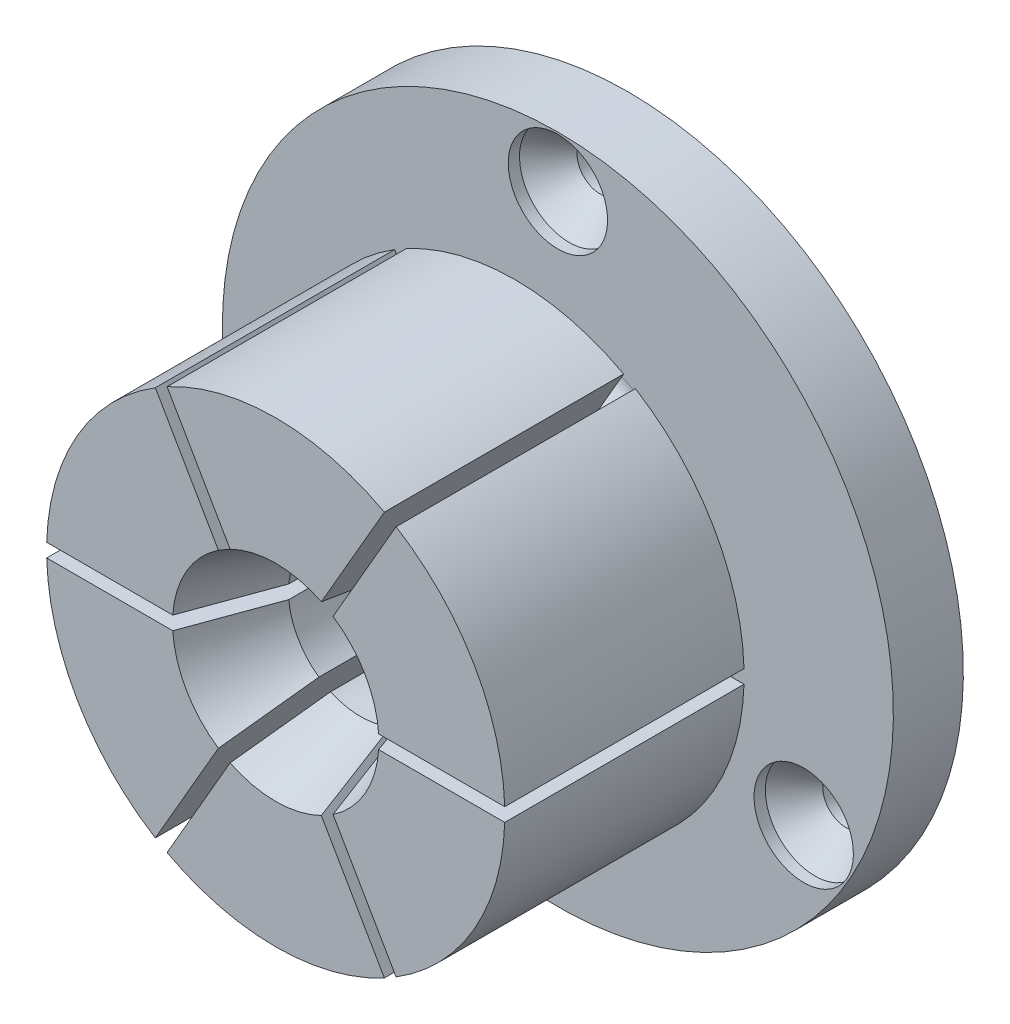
ISO-10303-21;
HEADER;
FILE_DESCRIPTION(('STEP AP214'),'2;1');
FILE_NAME('part.step','',(''),(''),'','','');
FILE_SCHEMA(('AUTOMOTIVE_DESIGN { 1 0 10303 214 1 1 1 1 }'));
ENDSEC;
DATA;
#1=APPLICATION_CONTEXT('core data for automotive mechanical design processes');
#2=APPLICATION_PROTOCOL_DEFINITION('international standard','automotive_design',2000,#1);
#3=PRODUCT_CONTEXT('',#1,'mechanical');
#4=PRODUCT('Part','Part','',(#3));
#5=PRODUCT_RELATED_PRODUCT_CATEGORY('part','',(#4));
#6=PRODUCT_DEFINITION_FORMATION('','',#4);
#7=PRODUCT_DEFINITION_CONTEXT('part definition',#1,'design');
#8=PRODUCT_DEFINITION('design','',#6,#7);
#9=PRODUCT_DEFINITION_SHAPE('','',#8);
#10=(LENGTH_UNIT() NAMED_UNIT(*) SI_UNIT(.MILLI.,.METRE.));
#11=(NAMED_UNIT(*) PLANE_ANGLE_UNIT() SI_UNIT($,.RADIAN.));
#12=(NAMED_UNIT(*) SI_UNIT($,.STERADIAN.) SOLID_ANGLE_UNIT());
#13=UNCERTAINTY_MEASURE_WITH_UNIT(LENGTH_MEASURE(1.E-05),#10,'distance_accuracy_value','');
#14=(GEOMETRIC_REPRESENTATION_CONTEXT(3) GLOBAL_UNCERTAINTY_ASSIGNED_CONTEXT((#13)) GLOBAL_UNIT_ASSIGNED_CONTEXT((#10,
#11,#12)) REPRESENTATION_CONTEXT('',''));
#15=CARTESIAN_POINT('',(0.,0.,0.));
#16=DIRECTION('',(0.,0.,1.));
#17=DIRECTION('',(1.,0.,0.));
#18=AXIS2_PLACEMENT_3D('',#15,#16,#17);
#19=CARTESIAN_POINT('',(18.923,0.,12.7));
#20=DIRECTION('',(0.,0.,-1.));
#21=DIRECTION('',(0.,1.,0.));
#22=AXIS2_PLACEMENT_3D('',#19,#20,#21);
#23=PLANE('',#22);
#24=DIRECTION('',(0.50000000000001,-0.866025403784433,0.));
#25=VECTOR('',#24,1.);
#26=CARTESIAN_POINT('',(5.39066135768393,-7.81289935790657,12.7));
#27=LINE('',#26,#25);
#28=CARTESIAN_POINT('',(10.1137371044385,-15.9935065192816,12.7));
#29=VERTEX_POINT('',#28);
#30=CARTESIAN_POINT('',(13.5447795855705,-21.9362464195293,12.7));
#31=VERTEX_POINT('',#30);
#32=EDGE_CURVE('E320',#29,#31,#27,.T.);
#33=ORIENTED_EDGE('',*,*,#32,.F.);
#34=CARTESIAN_POINT('',(0.,0.,12.7));
#35=DIRECTION('',(0.,0.,-1.));
#36=DIRECTION('',(0.,1.,0.));
#37=AXIS2_PLACEMENT_3D('',#34,#35,#36);
#38=CIRCLE('',#37,18.923);
#39=CARTESIAN_POINT('',(18.9076514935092,-0.762,12.7));
#40=VERTEX_POINT('',#39);
#41=EDGE_CURVE('E757',#40,#29,#38,.T.);
#42=ORIENTED_EDGE('',*,*,#41,.F.);
#43=DIRECTION('',(-1.,0.,0.));
#44=VECTOR('',#43,1.);
#45=CARTESIAN_POINT('',(18.923,-0.762,12.7));
#46=LINE('',#45,#44);
#47=CARTESIAN_POINT('',(25.769736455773,-0.762,12.7));
#48=VERTEX_POINT('',#47);
#49=EDGE_CURVE('E582',#48,#40,#46,.T.);
#50=ORIENTED_EDGE('',*,*,#49,.F.);
#51=CARTESIAN_POINT('',(0.,0.,12.7));
#52=DIRECTION('',(0.,0.,-1.));
#53=DIRECTION('',(0.,1.,0.));
#54=AXIS2_PLACEMENT_3D('',#51,#52,#53);
#55=CIRCLE('',#54,25.781);
#56=EDGE_CURVE('E755',#48,#31,#55,.T.);
#57=ORIENTED_EDGE('',*,*,#56,.T.);
#58=EDGE_LOOP('',(#33,#42,#50,#57));
#59=FACE_BOUND('',#58,.T.);
#60=ADVANCED_FACE('F14',(#59),#23,.T.);
#61=CARTESIAN_POINT('',(0.,0.,0.));
#62=DIRECTION('',(0.,0.,-1.));
#63=DIRECTION('',(0.,1.,0.));
#64=AXIS2_PLACEMENT_3D('',#61,#62,#63);
#65=CYLINDRICAL_SURFACE('',#64,25.781);
#66=DIRECTION('',(0.,0.,-1.));
#67=VECTOR('',#66,1.);
#68=CARTESIAN_POINT('',(13.5447795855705,-21.9362464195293,0.));
#69=LINE('',#68,#67);
#70=CARTESIAN_POINT('',(13.5447795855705,-21.9362464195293,39.624));
#71=VERTEX_POINT('',#70);
#72=EDGE_CURVE('E1037',#31,#71,#69,.F.);
#73=ORIENTED_EDGE('',*,*,#72,.F.);
#74=ORIENTED_EDGE('',*,*,#56,.F.);
#75=DIRECTION('',(0.,0.,-1.));
#76=VECTOR('',#75,1.);
#77=CARTESIAN_POINT('',(25.769736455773,-0.762,0.));
#78=LINE('',#77,#76);
#79=CARTESIAN_POINT('',(25.769736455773,-0.762,39.624));
#80=VERTEX_POINT('',#79);
#81=EDGE_CURVE('E580',#80,#48,#78,.T.);
#82=ORIENTED_EDGE('',*,*,#81,.F.);
#83=CARTESIAN_POINT('',(0.,0.,39.624));
#84=DIRECTION('',(0.,0.,-1.));
#85=DIRECTION('',(0.,1.,0.));
#86=AXIS2_PLACEMENT_3D('',#83,#84,#85);
#87=CIRCLE('',#86,25.781);
#88=EDGE_CURVE('E808',#80,#71,#87,.T.);
#89=ORIENTED_EDGE('',*,*,#88,.T.);
#90=EDGE_LOOP('',(#73,#74,#82,#89));
#91=FACE_BOUND('',#90,.T.);
#92=ADVANCED_FACE('F903',(#91),#65,.T.);
#93=CARTESIAN_POINT('',(25.781,0.,39.624));
#94=DIRECTION('',(0.,0.,1.));
#95=DIRECTION('',(0.,-1.,0.));
#96=AXIS2_PLACEMENT_3D('',#93,#94,#95);
#97=PLANE('',#96);
#98=DIRECTION('',(-0.50000000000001,0.866025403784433,0.));
#99=VECTOR('',#98,1.);
#100=CARTESIAN_POINT('',(19.5308055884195,-32.3043475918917,39.624));
#101=LINE('',#100,#99);
#102=CARTESIAN_POINT('',(6.45129238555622,-9.64996618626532,39.624));
#103=VERTEX_POINT('',#102);
#104=EDGE_CURVE('E297',#71,#103,#101,.T.);
#105=ORIENTED_EDGE('',*,*,#104,.F.);
#106=ORIENTED_EDGE('',*,*,#88,.F.);
#107=DIRECTION('',(1.,0.,0.));
#108=VECTOR('',#107,1.);
#109=CARTESIAN_POINT('',(37.7417884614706,-0.762,39.624));
#110=LINE('',#109,#108);
#111=CARTESIAN_POINT('',(11.5827620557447,-0.762,39.624));
#112=VERTEX_POINT('',#111);
#113=EDGE_CURVE('E558',#112,#80,#110,.T.);
#114=ORIENTED_EDGE('',*,*,#113,.F.);
#115=CARTESIAN_POINT('',(0.,0.,39.624));
#116=DIRECTION('',(0.,0.,-1.));
#117=DIRECTION('',(0.,1.,0.));
#118=AXIS2_PLACEMENT_3D('',#115,#116,#117);
#119=CIRCLE('',#118,11.6078);
#120=EDGE_CURVE('E613',#112,#103,#119,.T.);
#121=ORIENTED_EDGE('',*,*,#120,.T.);
#122=EDGE_LOOP('',(#105,#106,#114,#121));
#123=FACE_BOUND('',#122,.T.);
#124=ADVANCED_FACE('F910',(#123),#97,.T.);
#125=CARTESIAN_POINT('',(0.,0.,39.624));
#126=DIRECTION('',(0.,0.,1.));
#127=DIRECTION('',(0.,-1.,0.));
#128=AXIS2_PLACEMENT_3D('',#125,#126,#127);
#129=CONICAL_SURFACE('',#128,11.6078,0.349065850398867);
#130=CARTESIAN_POINT('',(6.45132886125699,-9.65002936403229,39.6242));
#131=CARTESIAN_POINT('',(6.30600123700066,-9.39831453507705,38.8273575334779));
#132=CARTESIAN_POINT('',(6.16065402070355,-9.14656577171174,38.0305293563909));
#133=CARTESIAN_POINT('',(5.86990662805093,-8.64297651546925,36.4369116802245));
#134=CARTESIAN_POINT('',(5.72450645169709,-8.39113602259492,35.6401221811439));
#135=CARTESIAN_POINT('',(5.43363935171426,-7.88733942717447,34.0465918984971));
#136=CARTESIAN_POINT('',(5.28817242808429,-7.63538332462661,33.2498511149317));
#137=CARTESIAN_POINT('',(4.99714805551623,-7.1313143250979,31.6564356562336));
#138=CARTESIAN_POINT('',(4.8515906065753,-6.87920142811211,30.8597609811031));
#139=CARTESIAN_POINT('',(4.70597600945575,-6.6269895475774,30.0631280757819));
#140=B_SPLINE_CURVE_WITH_KNOTS('',3,(#130,#131,#132,#133,#134,#135,#136,#137,#138,#139),
.UNSPECIFIED.,.F.,.F.,(4,2,2,2,4),(0.,2.54459142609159,5.08918277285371,7.63377415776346,
10.1783656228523),.UNSPECIFIED.);
#141=CARTESIAN_POINT('',(4.70601256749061,-6.6270528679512,30.0633280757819));
#142=VERTEX_POINT('',#141);
#143=EDGE_CURVE('E866',#103,#142,#140,.T.);
#144=ORIENTED_EDGE('',*,*,#143,.F.);
#145=ORIENTED_EDGE('',*,*,#120,.F.);
#146=CARTESIAN_POINT('',(4.2099779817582,-0.762,19.4865914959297));
#147=CARTESIAN_POINT('',(4.39429331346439,-0.762,19.9849362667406));
#148=CARTESIAN_POINT('',(4.57829801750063,-0.762,20.4833957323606));
#149=CARTESIAN_POINT('',(4.94583343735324,-0.762,21.4804892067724));
#150=CARTESIAN_POINT('',(5.12936415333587,-0.762,21.9791232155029));
#151=CARTESIAN_POINT('',(5.67946611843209,-0.762,23.4752045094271));
#152=CARTESIAN_POINT('',(6.04554748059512,-0.762,24.4728318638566));
#153=CARTESIAN_POINT('',(6.79073557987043,-0.762,26.5059213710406));
#154=CARTESIAN_POINT('',(7.16981383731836,-0.762,27.5413939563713));
#155=CARTESIAN_POINT('',(7.92747186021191,-0.762,29.612521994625));
#156=CARTESIAN_POINT('',(8.3060516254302,-0.762,30.6481774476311));
#157=CARTESIAN_POINT('',(9.42757948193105,-0.762,33.7177411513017));
#158=CARTESIAN_POINT('',(10.1700692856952,-0.762,35.7518168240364));
#159=CARTESIAN_POINT('',(11.28334233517,-0.762,38.8030973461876));
#160=CARTESIAN_POINT('',(11.6543561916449,-0.762,39.8202180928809));
#161=CARTESIAN_POINT('',(12.3962616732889,-0.762,41.8545041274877));
#162=CARTESIAN_POINT('',(12.7671532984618,-0.762,42.8716694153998));
#163=CARTESIAN_POINT('',(13.1379995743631,-0.762,43.8888512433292));
#164=B_SPLINE_CURVE_WITH_KNOTS('',3,(#146,#147,#148,#149,#150,#151,#152,#153,#154,#155,#156,
#157,#158,#159,#160,#161,#162,#163),.UNSPECIFIED.,.F.,.F.,(4,2,2,2,2,2,2,2,4),(0.,
1.59401245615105,3.18802435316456,6.37604558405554,9.68408626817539,12.9921284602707,
19.4881881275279,22.7362141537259,25.9842400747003),.UNSPECIFIED.);
#165=CARTESIAN_POINT('',(8.09220241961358,-0.762,30.0633280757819));
#166=VERTEX_POINT('',#165);
#167=EDGE_CURVE('E733',#166,#112,#164,.T.);
#168=ORIENTED_EDGE('',*,*,#167,.F.);
#169=CARTESIAN_POINT('',(0.,0.,30.0633280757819));
#170=DIRECTION('',(0.,0.,-1.));
#171=DIRECTION('',(0.,1.,0.));
#172=AXIS2_PLACEMENT_3D('',#169,#170,#171);
#173=CIRCLE('',#172,8.128);
#174=EDGE_CURVE('E598',#166,#142,#173,.T.);
#175=ORIENTED_EDGE('',*,*,#174,.T.);
#176=EDGE_LOOP('',(#144,#145,#168,#175));
#177=FACE_BOUND('',#176,.T.);
#178=ADVANCED_FACE('F901',(#177),#129,.F.);
#179=DIRECTION('',(-0.50000000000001,0.866025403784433,0.));
#180=VECTOR('',#179,1.);
#181=CARTESIAN_POINT('',(4.07083864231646,-8.57489935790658,12.7));
#182=LINE('',#181,#180);
#183=CARTESIAN_POINT('',(12.2249568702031,-22.6982464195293,12.7));
#184=VERTEX_POINT('',#183);
#185=CARTESIAN_POINT('',(8.79391438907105,-16.7555065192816,12.7));
#186=VERTEX_POINT('',#185);
#187=EDGE_CURVE('E305',#184,#186,#182,.T.);
#188=ORIENTED_EDGE('',*,*,#187,.F.);
#189=CARTESIAN_POINT('',(-12.2249568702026,-22.6982464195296,12.7));
#190=VERTEX_POINT('',#189);
#191=EDGE_CURVE('E759',#184,#190,#55,.T.);
#192=ORIENTED_EDGE('',*,*,#191,.T.);
#193=DIRECTION('',(-0.499999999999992,-0.866025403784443,0.));
#194=VECTOR('',#193,1.);
#195=CARTESIAN_POINT('',(5.3906613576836,7.81289935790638,12.7));
#196=LINE('',#195,#194);
#197=CARTESIAN_POINT('',(-8.79391438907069,-16.7555065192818,12.7));
#198=VERTEX_POINT('',#197);
#199=EDGE_CURVE('E860',#198,#190,#196,.T.);
#200=ORIENTED_EDGE('',*,*,#199,.F.);
#201=EDGE_CURVE('E765',#186,#198,#38,.T.);
#202=ORIENTED_EDGE('',*,*,#201,.F.);
#203=EDGE_LOOP('',(#188,#192,#200,#202));
#204=FACE_BOUND('',#203,.T.);
#205=ADVANCED_FACE('F905',(#204),#23,.T.);
#206=DIRECTION('',(0.,0.,-1.));
#207=VECTOR('',#206,1.);
#208=CARTESIAN_POINT('',(12.2249568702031,-22.6982464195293,0.));
#209=LINE('',#208,#207);
#210=CARTESIAN_POINT('',(12.2249568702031,-22.6982464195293,39.624));
#211=VERTEX_POINT('',#210);
#212=EDGE_CURVE('E310',#211,#184,#209,.T.);
#213=ORIENTED_EDGE('',*,*,#212,.F.);
#214=CARTESIAN_POINT('',(-12.2249568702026,-22.6982464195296,39.624));
#215=VERTEX_POINT('',#214);
#216=EDGE_CURVE('E810',#211,#215,#87,.T.);
#217=ORIENTED_EDGE('',*,*,#216,.T.);
#218=DIRECTION('',(0.,0.,-1.));
#219=VECTOR('',#218,1.);
#220=CARTESIAN_POINT('',(-12.2249568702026,-22.6982464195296,0.));
#221=LINE('',#220,#219);
#222=EDGE_CURVE('E465',#190,#215,#221,.F.);
#223=ORIENTED_EDGE('',*,*,#222,.F.);
#224=ORIENTED_EDGE('',*,*,#191,.F.);
#225=EDGE_LOOP('',(#213,#217,#223,#224));
#226=FACE_BOUND('',#225,.T.);
#227=ADVANCED_FACE('F855',(#226),#65,.T.);
#228=DIRECTION('',(0.50000000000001,-0.866025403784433,0.));
#229=VECTOR('',#228,1.);
#230=CARTESIAN_POINT('',(18.210982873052,-33.0663475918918,39.624));
#231=LINE('',#230,#229);
#232=CARTESIAN_POINT('',(5.13146967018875,-10.4119661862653,39.624));
#233=VERTEX_POINT('',#232);
#234=EDGE_CURVE('E1033',#233,#211,#231,.T.);
#235=ORIENTED_EDGE('',*,*,#234,.F.);
#236=CARTESIAN_POINT('',(-5.13146967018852,-10.4119661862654,39.624));
#237=VERTEX_POINT('',#236);
#238=EDGE_CURVE('E812',#233,#237,#119,.T.);
#239=ORIENTED_EDGE('',*,*,#238,.T.);
#240=DIRECTION('',(0.499999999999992,0.866025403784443,0.));
#241=VECTOR('',#240,1.);
#242=CARTESIAN_POINT('',(-18.2109828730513,-33.0663475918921,39.624));
#243=LINE('',#242,#241);
#244=EDGE_CURVE('E858',#215,#237,#243,.T.);
#245=ORIENTED_EDGE('',*,*,#244,.F.);
#246=ORIENTED_EDGE('',*,*,#216,.F.);
#247=EDGE_LOOP('',(#235,#239,#245,#246));
#248=FACE_BOUND('',#247,.T.);
#249=ADVANCED_FACE('F861',(#248),#97,.T.);
#250=CARTESIAN_POINT('',(3.38615329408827,-7.38898954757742,30.0631280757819));
#251=CARTESIAN_POINT('',(3.53176789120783,-7.64120142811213,30.8597609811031));
#252=CARTESIAN_POINT('',(3.67732534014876,-7.89331432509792,31.6564356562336));
#253=CARTESIAN_POINT('',(3.96834971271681,-8.39738332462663,33.2498511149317));
#254=CARTESIAN_POINT('',(4.11381663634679,-8.64933942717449,34.0465918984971));
#255=CARTESIAN_POINT('',(4.40468373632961,-9.15313602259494,35.6401221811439));
#256=CARTESIAN_POINT('',(4.55008391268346,-9.40497651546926,36.4369116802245));
#257=CARTESIAN_POINT('',(4.84083130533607,-9.90856577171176,38.0305293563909));
#258=CARTESIAN_POINT('',(4.98617852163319,-10.1603145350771,38.8273575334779));
#259=CARTESIAN_POINT('',(5.13150614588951,-10.4120293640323,39.6242));
#260=B_SPLINE_CURVE_WITH_KNOTS('',3,(#250,#251,#252,#253,#254,#255,#256,#257,#258,#259),
.UNSPECIFIED.,.F.,.F.,(4,2,2,2,4),(0.,2.54459146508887,5.08918284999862,7.63377419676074,
10.1783656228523),.UNSPECIFIED.);
#261=CARTESIAN_POINT('',(3.38618985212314,-7.38905286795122,30.0633280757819));
#262=VERTEX_POINT('',#261);
#263=EDGE_CURVE('E312',#262,#233,#260,.T.);
#264=ORIENTED_EDGE('',*,*,#263,.F.);
#265=CARTESIAN_POINT('',(-3.38618985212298,-7.38905286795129,30.0633280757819));
#266=VERTEX_POINT('',#265);
#267=EDGE_CURVE('E302',#262,#266,#173,.T.);
#268=ORIENTED_EDGE('',*,*,#267,.T.);
#269=CARTESIAN_POINT('',(-5.13150614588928,-10.4120293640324,39.6242));
#270=CARTESIAN_POINT('',(-4.98617852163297,-10.1603145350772,38.8273575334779));
#271=CARTESIAN_POINT('',(-4.84083130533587,-9.90856577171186,38.0305293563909));
#272=CARTESIAN_POINT('',(-4.55008391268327,-9.40497651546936,36.4369116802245));
#273=CARTESIAN_POINT('',(-4.40468373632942,-9.15313602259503,35.6401221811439));
#274=CARTESIAN_POINT('',(-4.11381663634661,-8.64933942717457,34.0465918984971));
#275=CARTESIAN_POINT('',(-3.96834971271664,-8.39738332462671,33.2498511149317));
#276=CARTESIAN_POINT('',(-3.6773253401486,-7.893314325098,31.6564356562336));
#277=CARTESIAN_POINT('',(-3.53176789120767,-7.64120142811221,30.8597609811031));
#278=CARTESIAN_POINT('',(-3.38615329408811,-7.38898954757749,30.0631280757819));
#279=B_SPLINE_CURVE_WITH_KNOTS('',3,(#269,#270,#271,#272,#273,#274,#275,#276,#277,#278),
.UNSPECIFIED.,.F.,.F.,(4,2,2,2,4),(0.,2.54459142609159,5.0891827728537,7.63377415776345,
10.1783656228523),.UNSPECIFIED.);
#280=EDGE_CURVE('E456',#237,#266,#279,.T.);
#281=ORIENTED_EDGE('',*,*,#280,.F.);
#282=ORIENTED_EDGE('',*,*,#238,.F.);
#283=EDGE_LOOP('',(#264,#268,#281,#282));
#284=FACE_BOUND('',#283,.T.);
#285=ADVANCED_FACE('F890',(#284),#129,.F.);
#286=DIRECTION('',(0.499999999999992,0.866025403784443,0.));
#287=VECTOR('',#286,1.);
#288=CARTESIAN_POINT('',(4.07083864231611,8.57489935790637,12.7));
#289=LINE('',#288,#287);
#290=CARTESIAN_POINT('',(-13.5447795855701,-21.9362464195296,12.7));
#291=VERTEX_POINT('',#290);
#292=CARTESIAN_POINT('',(-10.1137371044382,-15.9935065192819,12.7));
#293=VERTEX_POINT('',#292);
#294=EDGE_CURVE('E876',#291,#293,#289,.T.);
#295=ORIENTED_EDGE('',*,*,#294,.F.);
#296=CARTESIAN_POINT('',(-25.769736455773,-0.762000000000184,12.7));
#297=VERTEX_POINT('',#296);
#298=EDGE_CURVE('E789',#291,#297,#55,.T.);
#299=ORIENTED_EDGE('',*,*,#298,.T.);
#300=DIRECTION('',(-1.,0.,0.));
#301=VECTOR('',#300,1.);
#302=CARTESIAN_POINT('',(18.923,-0.761999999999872,12.7));
#303=LINE('',#302,#301);
#304=CARTESIAN_POINT('',(-18.9076514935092,-0.762000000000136,12.7));
#305=VERTEX_POINT('',#304);
#306=EDGE_CURVE('E493',#305,#297,#303,.T.);
#307=ORIENTED_EDGE('',*,*,#306,.F.);
#308=EDGE_CURVE('E769',#293,#305,#38,.T.);
#309=ORIENTED_EDGE('',*,*,#308,.F.);
#310=EDGE_LOOP('',(#295,#299,#307,#309));
#311=FACE_BOUND('',#310,.T.);
#312=ADVANCED_FACE('F787',(#311),#23,.T.);
#313=DIRECTION('',(0.,0.,-1.));
#314=VECTOR('',#313,1.);
#315=CARTESIAN_POINT('',(-13.5447795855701,-21.9362464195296,0.));
#316=LINE('',#315,#314);
#317=CARTESIAN_POINT('',(-13.5447795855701,-21.9362464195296,39.624));
#318=VERTEX_POINT('',#317);
#319=EDGE_CURVE('E879',#318,#291,#316,.T.);
#320=ORIENTED_EDGE('',*,*,#319,.F.);
#321=CARTESIAN_POINT('',(-25.769736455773,-0.762000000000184,39.624));
#322=VERTEX_POINT('',#321);
#323=EDGE_CURVE('E846',#318,#322,#87,.T.);
#324=ORIENTED_EDGE('',*,*,#323,.T.);
#325=DIRECTION('',(0.,0.,-1.));
#326=VECTOR('',#325,1.);
#327=CARTESIAN_POINT('',(-25.769736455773,-0.762000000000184,0.));
#328=LINE('',#327,#326);
#329=EDGE_CURVE('E790',#297,#322,#328,.F.);
#330=ORIENTED_EDGE('',*,*,#329,.F.);
#331=ORIENTED_EDGE('',*,*,#298,.F.);
#332=EDGE_LOOP('',(#320,#324,#330,#331));
#333=FACE_BOUND('',#332,.T.);
#334=ADVANCED_FACE('F898',(#333),#65,.T.);
#335=DIRECTION('',(-0.499999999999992,-0.866025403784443,0.));
#336=VECTOR('',#335,1.);
#337=CARTESIAN_POINT('',(-19.5308055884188,-32.3043475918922,39.624));
#338=LINE('',#337,#336);
#339=CARTESIAN_POINT('',(-6.45129238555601,-9.64996618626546,39.624));
#340=VERTEX_POINT('',#339);
#341=EDGE_CURVE('E863',#340,#318,#338,.T.);
#342=ORIENTED_EDGE('',*,*,#341,.F.);
#343=CARTESIAN_POINT('',(-11.5827620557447,-0.762000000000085,39.624));
#344=VERTEX_POINT('',#343);
#345=EDGE_CURVE('E817',#340,#344,#119,.T.);
#346=ORIENTED_EDGE('',*,*,#345,.T.);
#347=DIRECTION('',(1.,0.,0.));
#348=VECTOR('',#347,1.);
#349=CARTESIAN_POINT('',(-37.7417884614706,-0.762000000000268,39.624));
#350=LINE('',#349,#348);
#351=EDGE_CURVE('E468',#322,#344,#350,.T.);
#352=ORIENTED_EDGE('',*,*,#351,.F.);
#353=ORIENTED_EDGE('',*,*,#323,.F.);
#354=EDGE_LOOP('',(#342,#346,#352,#353));
#355=FACE_BOUND('',#354,.T.);
#356=ADVANCED_FACE('F887',(#355),#97,.T.);
#357=CARTESIAN_POINT('',(-4.7059760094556,-6.62698954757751,30.0631280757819));
#358=CARTESIAN_POINT('',(-4.85159060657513,-6.87920142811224,30.8597609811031));
#359=CARTESIAN_POINT('',(-4.99714805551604,-7.13131432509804,31.6564356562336));
#360=CARTESIAN_POINT('',(-5.28817242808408,-7.63538332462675,33.2498511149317));
#361=CARTESIAN_POINT('',(-5.43363935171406,-7.88733942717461,34.0465918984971));
#362=CARTESIAN_POINT('',(-5.72450645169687,-8.39113602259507,35.6401221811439));
#363=CARTESIAN_POINT('',(-5.86990662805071,-8.6429765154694,36.4369116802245));
#364=CARTESIAN_POINT('',(-6.16065402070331,-9.1465657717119,38.0305293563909));
#365=CARTESIAN_POINT('',(-6.30600123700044,-9.3983145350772,38.8273575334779));
#366=CARTESIAN_POINT('',(-6.45132886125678,-9.65002936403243,39.6242));
#367=B_SPLINE_CURVE_WITH_KNOTS('',3,(#357,#358,#359,#360,#361,#362,#363,#364,#365,#366),
.UNSPECIFIED.,.F.,.F.,(4,2,2,2,4),(0.,2.54459146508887,5.08918284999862,7.63377419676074,
10.1783656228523),.UNSPECIFIED.);
#368=CARTESIAN_POINT('',(-4.70601256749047,-6.62705286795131,30.0633280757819));
#369=VERTEX_POINT('',#368);
#370=EDGE_CURVE('E881',#369,#340,#367,.T.);
#371=ORIENTED_EDGE('',*,*,#370,.F.);
#372=CARTESIAN_POINT('',(-8.09220241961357,-0.762000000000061,30.0633280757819));
#373=VERTEX_POINT('',#372);
#374=EDGE_CURVE('E614',#369,#373,#173,.T.);
#375=ORIENTED_EDGE('',*,*,#374,.T.);
#376=CARTESIAN_POINT('',(-13.137999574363,-0.762000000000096,43.8888512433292));
#377=CARTESIAN_POINT('',(-12.3962791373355,-0.762000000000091,41.8544955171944));
#378=CARTESIAN_POINT('',(-11.6544315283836,-0.762000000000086,39.8201860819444));
#379=CARTESIAN_POINT('',(-10.5411586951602,-0.762000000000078,36.7689058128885));
#380=CARTESIAN_POINT('',(-10.1699843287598,-0.762000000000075,35.7518434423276));
#381=CARTESIAN_POINT('',(-9.42741649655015,-0.76200000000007,33.7177985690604));
#382=CARTESIAN_POINT('',(-9.05602303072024,-0.762000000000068,32.7008160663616));
#383=CARTESIAN_POINT('',(-8.31291843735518,-0.762000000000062,30.6669658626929));
#384=CARTESIAN_POINT('',(-7.9412073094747,-0.76200000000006,29.6500981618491));
#385=CARTESIAN_POINT('',(-7.19731234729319,-0.762000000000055,27.6165358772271));
#386=CARTESIAN_POINT('',(-6.82512851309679,-0.762000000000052,26.5998412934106));
#387=CARTESIAN_POINT('',(-6.26627705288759,-0.762000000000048,25.0750098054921));
#388=CARTESIAN_POINT('',(-6.07989718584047,-0.762000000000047,24.5667674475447));
#389=CARTESIAN_POINT('',(-5.70688164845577,-0.762000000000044,23.5503766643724));
#390=CARTESIAN_POINT('',(-5.52024597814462,-0.762000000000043,23.0422282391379));
#391=CARTESIAN_POINT('',(-5.14663606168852,-0.76200000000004,22.0260553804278));
#392=CARTESIAN_POINT('',(-4.95966181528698,-0.762000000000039,21.5180309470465));
#393=CARTESIAN_POINT('',(-4.58522428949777,-0.762000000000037,20.5021621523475));
#394=CARTESIAN_POINT('',(-4.3977610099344,-0.762000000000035,19.9943177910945));
#395=CARTESIAN_POINT('',(-4.20997798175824,-0.762000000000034,19.4865914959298));
#396=B_SPLINE_CURVE_WITH_KNOTS('',3,(#376,#377,#378,#379,#380,#381,#382,#383,#384,#385,#386,
#387,#388,#389,#390,#391,#392,#393,#394,#395),.UNSPECIFIED.,.F.,.F.,(4,2,2,2,2,2,2,2,2,4),(0.,
6.49605825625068,9.74408479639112,12.9921116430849,16.2401420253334,19.4881716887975,
21.1121881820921,22.7362045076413,24.3602220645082,25.9842402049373),.UNSPECIFIED.);
#397=EDGE_CURVE('E674',#344,#373,#396,.T.);
#398=ORIENTED_EDGE('',*,*,#397,.F.);
#399=ORIENTED_EDGE('',*,*,#345,.F.);
#400=EDGE_LOOP('',(#371,#375,#398,#399));
#401=FACE_BOUND('',#400,.T.);
#402=ADVANCED_FACE('F888',(#401),#129,.F.);
#403=DIRECTION('',(1.,0.,0.));
#404=VECTOR('',#403,1.);
#405=CARTESIAN_POINT('',(18.923,0.762000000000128,12.7));
#406=LINE('',#405,#404);
#407=CARTESIAN_POINT('',(-25.7697364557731,0.761999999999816,12.7));
#408=VERTEX_POINT('',#407);
#409=CARTESIAN_POINT('',(-18.9076514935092,0.761999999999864,12.7));
#410=VERTEX_POINT('',#409);
#411=EDGE_CURVE('E482',#408,#410,#406,.T.);
#412=ORIENTED_EDGE('',*,*,#411,.F.);
#413=CARTESIAN_POINT('',(-13.5447795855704,21.9362464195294,12.7));
#414=VERTEX_POINT('',#413);
#415=EDGE_CURVE('E804',#408,#414,#55,.T.);
#416=ORIENTED_EDGE('',*,*,#415,.T.);
#417=DIRECTION('',(-0.5,0.866025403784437,0.));
#418=VECTOR('',#417,1.);
#419=CARTESIAN_POINT('',(4.07083864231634,-8.57489935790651,12.7));
#420=LINE('',#419,#418);
#421=CARTESIAN_POINT('',(-10.1137371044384,15.9935065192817,12.7));
#422=VERTEX_POINT('',#421);
#423=EDGE_CURVE('E657',#422,#414,#420,.T.);
#424=ORIENTED_EDGE('',*,*,#423,.F.);
#425=EDGE_CURVE('E686',#410,#422,#38,.T.);
#426=ORIENTED_EDGE('',*,*,#425,.F.);
#427=EDGE_LOOP('',(#412,#416,#424,#426));
#428=FACE_BOUND('',#427,.T.);
#429=ADVANCED_FACE('F803',(#428),#23,.T.);
#430=DIRECTION('',(0.,0.,-1.));
#431=VECTOR('',#430,1.);
#432=CARTESIAN_POINT('',(-25.7697364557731,0.761999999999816,0.));
#433=LINE('',#432,#431);
#434=CARTESIAN_POINT('',(-25.7697364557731,0.761999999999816,39.624));
#435=VERTEX_POINT('',#434);
#436=EDGE_CURVE('E485',#435,#408,#433,.T.);
#437=ORIENTED_EDGE('',*,*,#436,.F.);
#438=CARTESIAN_POINT('',(-13.5447795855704,21.9362464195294,39.624));
#439=VERTEX_POINT('',#438);
#440=EDGE_CURVE('E668',#435,#439,#87,.T.);
#441=ORIENTED_EDGE('',*,*,#440,.T.);
#442=DIRECTION('',(0.,0.,-1.));
#443=VECTOR('',#442,1.);
#444=CARTESIAN_POINT('',(-13.5447795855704,21.9362464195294,0.));
#445=LINE('',#444,#443);
#446=EDGE_CURVE('E525',#414,#439,#445,.F.);
#447=ORIENTED_EDGE('',*,*,#446,.F.);
#448=ORIENTED_EDGE('',*,*,#415,.F.);
#449=EDGE_LOOP('',(#437,#441,#447,#448));
#450=FACE_BOUND('',#449,.T.);
#451=ADVANCED_FACE('F897',(#450),#65,.T.);
#452=DIRECTION('',(-1.,0.,0.));
#453=VECTOR('',#452,1.);
#454=CARTESIAN_POINT('',(-37.7417884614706,0.761999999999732,39.624));
#455=LINE('',#454,#453);
#456=CARTESIAN_POINT('',(-11.5827620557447,0.761999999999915,39.624));
#457=VERTEX_POINT('',#456);
#458=EDGE_CURVE('E464',#457,#435,#455,.T.);
#459=ORIENTED_EDGE('',*,*,#458,.F.);
#460=CARTESIAN_POINT('',(-6.45129238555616,9.64996618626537,39.624));
#461=VERTEX_POINT('',#460);
#462=EDGE_CURVE('E669',#457,#461,#119,.T.);
#463=ORIENTED_EDGE('',*,*,#462,.T.);
#464=DIRECTION('',(0.5,-0.866025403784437,0.));
#465=VECTOR('',#464,1.);
#466=CARTESIAN_POINT('',(-19.5308055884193,32.3043475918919,39.624));
#467=LINE('',#466,#465);
#468=EDGE_CURVE('E637',#439,#461,#467,.T.);
#469=ORIENTED_EDGE('',*,*,#468,.F.);
#470=ORIENTED_EDGE('',*,*,#440,.F.);
#471=EDGE_LOOP('',(#459,#463,#469,#470));
#472=FACE_BOUND('',#471,.T.);
#473=ADVANCED_FACE('F667',(#472),#97,.T.);
#474=CARTESIAN_POINT('',(-4.20997798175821,0.761999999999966,19.4865914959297));
#475=CARTESIAN_POINT('',(-4.3942933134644,0.761999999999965,19.9849362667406));
#476=CARTESIAN_POINT('',(-4.57829801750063,0.761999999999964,20.4833957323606));
#477=CARTESIAN_POINT('',(-4.94583343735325,0.761999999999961,21.4804892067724));
#478=CARTESIAN_POINT('',(-5.12936415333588,0.76199999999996,21.9791232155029));
#479=CARTESIAN_POINT('',(-5.6794661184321,0.761999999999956,23.4752045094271));
#480=CARTESIAN_POINT('',(-6.04554748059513,0.761999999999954,24.4728318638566));
#481=CARTESIAN_POINT('',(-6.79073557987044,0.761999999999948,26.5059213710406));
#482=CARTESIAN_POINT('',(-7.16981383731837,0.761999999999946,27.5413939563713));
#483=CARTESIAN_POINT('',(-7.92747186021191,0.76199999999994,29.612521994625));
#484=CARTESIAN_POINT('',(-8.3060516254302,0.761999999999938,30.6481774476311));
#485=CARTESIAN_POINT('',(-9.42757948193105,0.76199999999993,33.7177411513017));
#486=CARTESIAN_POINT('',(-10.1700692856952,0.761999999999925,35.7518168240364));
#487=CARTESIAN_POINT('',(-11.28334233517,0.761999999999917,38.8030973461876));
#488=CARTESIAN_POINT('',(-11.6543561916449,0.761999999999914,39.8202180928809));
#489=CARTESIAN_POINT('',(-12.3962616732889,0.761999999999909,41.8545041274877));
#490=CARTESIAN_POINT('',(-12.7671532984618,0.761999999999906,42.8716694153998));
#491=CARTESIAN_POINT('',(-13.1379995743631,0.761999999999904,43.8888512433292));
#492=B_SPLINE_CURVE_WITH_KNOTS('',3,(#474,#475,#476,#477,#478,#479,#480,#481,#482,#483,#484,
#485,#486,#487,#488,#489,#490,#491),.UNSPECIFIED.,.F.,.F.,(4,2,2,2,2,2,2,2,4),(0.,
1.59401245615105,3.18802435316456,6.37604558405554,9.68408626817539,12.9921284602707,
19.4881881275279,22.7362141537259,25.9842400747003),.UNSPECIFIED.);
#493=CARTESIAN_POINT('',(-8.09220241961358,0.761999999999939,30.0633280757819));
#494=VERTEX_POINT('',#493);
#495=EDGE_CURVE('E487',#494,#457,#492,.T.);
#496=ORIENTED_EDGE('',*,*,#495,.F.);
#497=CARTESIAN_POINT('',(-4.70601256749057,6.62705286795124,30.0633280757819));
#498=VERTEX_POINT('',#497);
#499=EDGE_CURVE('E604',#494,#498,#173,.T.);
#500=ORIENTED_EDGE('',*,*,#499,.T.);
#501=CARTESIAN_POINT('',(-6.45132886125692,9.65002936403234,39.6242));
#502=CARTESIAN_POINT('',(-6.30600123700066,9.39831453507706,38.8273575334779));
#503=CARTESIAN_POINT('',(-6.16065402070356,9.14656577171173,38.0305293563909));
#504=CARTESIAN_POINT('',(-5.86990662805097,8.64297651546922,36.4369116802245));
#505=CARTESIAN_POINT('',(-5.72450645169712,8.3911360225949,35.6401221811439));
#506=CARTESIAN_POINT('',(-5.4336393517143,7.88733942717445,34.0465918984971));
#507=CARTESIAN_POINT('',(-5.28817242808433,7.63538332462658,33.2498511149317));
#508=CARTESIAN_POINT('',(-4.99714805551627,7.13131432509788,31.6564356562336));
#509=CARTESIAN_POINT('',(-4.85159060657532,6.8792014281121,30.8597609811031));
#510=CARTESIAN_POINT('',(-4.70597600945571,6.62698954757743,30.0631280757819));
#511=B_SPLINE_CURVE_WITH_KNOTS('',3,(#501,#502,#503,#504,#505,#506,#507,#508,#509,#510),
.UNSPECIFIED.,.F.,.F.,(4,2,2,2,4),(0.,2.54459142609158,5.08918277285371,7.63377415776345,
10.1783656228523),.UNSPECIFIED.);
#512=EDGE_CURVE('E516',#461,#498,#511,.T.);
#513=ORIENTED_EDGE('',*,*,#512,.F.);
#514=ORIENTED_EDGE('',*,*,#462,.F.);
#515=EDGE_LOOP('',(#496,#500,#513,#514));
#516=FACE_BOUND('',#515,.T.);
#517=ADVANCED_FACE('F626',(#516),#129,.F.);
#518=DIRECTION('',(0.5,-0.866025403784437,0.));
#519=VECTOR('',#518,1.);
#520=CARTESIAN_POINT('',(5.39066135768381,-7.81289935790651,12.7));
#521=LINE('',#520,#519);
#522=CARTESIAN_POINT('',(-12.2249568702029,22.6982464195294,12.7));
#523=VERTEX_POINT('',#522);
#524=CARTESIAN_POINT('',(-8.79391438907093,16.7555065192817,12.7));
#525=VERTEX_POINT('',#524);
#526=EDGE_CURVE('E641',#523,#525,#521,.T.);
#527=ORIENTED_EDGE('',*,*,#526,.F.);
#528=CARTESIAN_POINT('',(12.2249568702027,22.6982464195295,12.7));
#529=VERTEX_POINT('',#528);
#530=EDGE_CURVE('E806',#523,#529,#55,.T.);
#531=ORIENTED_EDGE('',*,*,#530,.T.);
#532=DIRECTION('',(0.5,0.86602540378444,0.));
#533=VECTOR('',#532,1.);
#534=CARTESIAN_POINT('',(4.07083864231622,8.57489935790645,12.7));
#535=LINE('',#534,#533);
#536=CARTESIAN_POINT('',(8.79391438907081,16.7555065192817,12.7));
#537=VERTEX_POINT('',#536);
#538=EDGE_CURVE('E551',#537,#529,#535,.T.);
#539=ORIENTED_EDGE('',*,*,#538,.F.);
#540=EDGE_CURVE('E754',#525,#537,#38,.T.);
#541=ORIENTED_EDGE('',*,*,#540,.F.);
#542=EDGE_LOOP('',(#527,#531,#539,#541));
#543=FACE_BOUND('',#542,.T.);
#544=ADVANCED_FACE('F841',(#543),#23,.T.);
#545=DIRECTION('',(0.,0.,-1.));
#546=VECTOR('',#545,1.);
#547=CARTESIAN_POINT('',(-12.2249568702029,22.6982464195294,0.));
#548=LINE('',#547,#546);
#549=CARTESIAN_POINT('',(-12.2249568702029,22.6982464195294,39.624));
#550=VERTEX_POINT('',#549);
#551=EDGE_CURVE('E644',#550,#523,#548,.T.);
#552=ORIENTED_EDGE('',*,*,#551,.F.);
#553=CARTESIAN_POINT('',(12.2249568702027,22.6982464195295,39.624));
#554=VERTEX_POINT('',#553);
#555=EDGE_CURVE('E816',#550,#554,#87,.T.);
#556=ORIENTED_EDGE('',*,*,#555,.T.);
#557=DIRECTION('',(0.,0.,-1.));
#558=VECTOR('',#557,1.);
#559=CARTESIAN_POINT('',(12.2249568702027,22.6982464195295,0.));
#560=LINE('',#559,#558);
#561=EDGE_CURVE('E549',#529,#554,#560,.F.);
#562=ORIENTED_EDGE('',*,*,#561,.F.);
#563=ORIENTED_EDGE('',*,*,#530,.F.);
#564=EDGE_LOOP('',(#552,#556,#562,#563));
#565=FACE_BOUND('',#564,.T.);
#566=ADVANCED_FACE('F845',(#565),#65,.T.);
#567=DIRECTION('',(-0.5,0.866025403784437,0.));
#568=VECTOR('',#567,1.);
#569=CARTESIAN_POINT('',(-18.2109828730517,33.0663475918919,39.624));
#570=LINE('',#569,#568);
#571=CARTESIAN_POINT('',(-5.13146967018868,10.4119661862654,39.624));
#572=VERTEX_POINT('',#571);
#573=EDGE_CURVE('E670',#572,#550,#570,.T.);
#574=ORIENTED_EDGE('',*,*,#573,.F.);
#575=CARTESIAN_POINT('',(5.13146967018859,10.4119661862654,39.624));
#576=VERTEX_POINT('',#575);
#577=EDGE_CURVE('E612',#572,#576,#119,.T.);
#578=ORIENTED_EDGE('',*,*,#577,.T.);
#579=DIRECTION('',(-0.5,-0.86602540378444,0.));
#580=VECTOR('',#579,1.);
#581=CARTESIAN_POINT('',(18.2109828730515,33.0663475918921,39.624));
#582=LINE('',#581,#580);
#583=EDGE_CURVE('E528',#554,#576,#582,.T.);
#584=ORIENTED_EDGE('',*,*,#583,.F.);
#585=ORIENTED_EDGE('',*,*,#555,.F.);
#586=EDGE_LOOP('',(#574,#578,#584,#585));
#587=FACE_BOUND('',#586,.T.);
#588=ADVANCED_FACE('F828',(#587),#97,.T.);
#589=CARTESIAN_POINT('',(-3.38615329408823,7.38898954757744,30.0631280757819));
#590=CARTESIAN_POINT('',(-3.53176789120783,7.64120142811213,30.8597609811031));
#591=CARTESIAN_POINT('',(-3.67732534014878,7.89331432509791,31.6564356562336));
#592=CARTESIAN_POINT('',(-3.96834971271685,8.39738332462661,33.2498511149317));
#593=CARTESIAN_POINT('',(-4.11381663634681,8.64933942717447,34.0465918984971));
#594=CARTESIAN_POINT('',(-4.40468373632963,9.15313602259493,35.6401221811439));
#595=CARTESIAN_POINT('',(-4.55008391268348,9.40497651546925,36.4369116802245));
#596=CARTESIAN_POINT('',(-4.84083130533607,9.90856577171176,38.0305293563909));
#597=CARTESIAN_POINT('',(-4.98617852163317,10.1603145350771,38.8273575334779));
#598=CARTESIAN_POINT('',(-5.13150614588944,10.4120293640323,39.6242));
#599=B_SPLINE_CURVE_WITH_KNOTS('',3,(#589,#590,#591,#592,#593,#594,#595,#596,#597,#598),
.UNSPECIFIED.,.F.,.F.,(4,2,2,2,4),(0.,2.54459146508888,5.08918284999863,7.63377419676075,
10.1783656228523),.UNSPECIFIED.);
#600=CARTESIAN_POINT('',(-3.38618985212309,7.38905286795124,30.0633280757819));
#601=VERTEX_POINT('',#600);
#602=EDGE_CURVE('E652',#601,#572,#599,.T.);
#603=ORIENTED_EDGE('',*,*,#602,.F.);
#604=CARTESIAN_POINT('',(3.38618985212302,7.38905286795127,30.0633280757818));
#605=VERTEX_POINT('',#604);
#606=EDGE_CURVE('E597',#601,#605,#173,.T.);
#607=ORIENTED_EDGE('',*,*,#606,.T.);
#608=CARTESIAN_POINT('',(5.13150614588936,10.4120293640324,39.6242));
#609=CARTESIAN_POINT('',(4.986178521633,10.1603145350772,38.8273575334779));
#610=CARTESIAN_POINT('',(4.84083130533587,9.90856577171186,38.0305293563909));
#611=CARTESIAN_POINT('',(4.55008391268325,9.40497651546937,36.4369116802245));
#612=CARTESIAN_POINT('',(4.40468373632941,9.15313602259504,35.6401221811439));
#613=CARTESIAN_POINT('',(4.1138166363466,8.64933942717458,34.0465918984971));
#614=CARTESIAN_POINT('',(3.96834971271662,8.39738332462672,33.2498511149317));
#615=CARTESIAN_POINT('',(3.67732534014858,7.89331432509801,31.6564356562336));
#616=CARTESIAN_POINT('',(3.53176789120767,7.64120142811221,30.8597609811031));
#617=CARTESIAN_POINT('',(3.38615329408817,7.38898954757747,30.0631280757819));
#618=B_SPLINE_CURVE_WITH_KNOTS('',3,(#608,#609,#610,#611,#612,#613,#614,#615,#616,#617),
.UNSPECIFIED.,.F.,.F.,(4,2,2,2,4),(0.,2.54459142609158,5.08918277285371,7.63377415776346,
10.1783656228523),.UNSPECIFIED.);
#619=EDGE_CURVE('E692',#576,#605,#618,.T.);
#620=ORIENTED_EDGE('',*,*,#619,.F.);
#621=ORIENTED_EDGE('',*,*,#577,.F.);
#622=EDGE_LOOP('',(#603,#607,#620,#621));
#623=FACE_BOUND('',#622,.T.);
#624=ADVANCED_FACE('F834',(#623),#129,.F.);
#625=CARTESIAN_POINT('',(0.,0.,0.));
#626=DIRECTION('',(0.,0.,-1.));
#627=DIRECTION('',(0.,1.,0.));
#628=AXIS2_PLACEMENT_3D('',#625,#626,#627);
#629=CYLINDRICAL_SURFACE('',#628,8.128);
#630=DIRECTION('',(0.,0.,1.));
#631=VECTOR('',#630,1.);
#632=CARTESIAN_POINT('',(4.70601256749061,-6.6270528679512,8.382));
#633=LINE('',#632,#631);
#634=CARTESIAN_POINT('',(4.70601256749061,-6.6270528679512,8.382));
#635=VERTEX_POINT('',#634);
#636=EDGE_CURVE('E303',#635,#142,#633,.T.);
#637=ORIENTED_EDGE('',*,*,#636,.T.);
#638=ORIENTED_EDGE('',*,*,#174,.F.);
#639=DIRECTION('',(0.,0.,1.));
#640=VECTOR('',#639,1.);
#641=CARTESIAN_POINT('',(8.09220241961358,-0.762,8.382));
#642=LINE('',#641,#640);
#643=CARTESIAN_POINT('',(8.09220241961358,-0.762,8.382));
#644=VERTEX_POINT('',#643);
#645=EDGE_CURVE('E576',#644,#166,#642,.T.);
#646=ORIENTED_EDGE('',*,*,#645,.F.);
#647=CARTESIAN_POINT('',(0.,0.,8.382));
#648=DIRECTION('',(0.,0.,-1.));
#649=DIRECTION('',(0.,-1.,0.));
#650=AXIS2_PLACEMENT_3D('',#647,#648,#649);
#651=CIRCLE('',#650,8.128);
#652=CARTESIAN_POINT('',(8.09220241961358,0.762,8.382));
#653=VERTEX_POINT('',#652);
#654=EDGE_CURVE('E566',#653,#644,#651,.T.);
#655=ORIENTED_EDGE('',*,*,#654,.F.);
#656=DIRECTION('',(0.,0.,1.));
#657=VECTOR('',#656,1.);
#658=CARTESIAN_POINT('',(8.09220241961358,0.762,8.382));
#659=LINE('',#658,#657);
#660=CARTESIAN_POINT('',(8.09220241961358,0.762,30.0633280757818));
#661=VERTEX_POINT('',#660);
#662=EDGE_CURVE('E577',#653,#661,#659,.T.);
#663=ORIENTED_EDGE('',*,*,#662,.T.);
#664=CARTESIAN_POINT('',(4.70601256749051,6.62705286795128,30.0633280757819));
#665=VERTEX_POINT('',#664);
#666=EDGE_CURVE('E594',#665,#661,#173,.T.);
#667=ORIENTED_EDGE('',*,*,#666,.F.);
#668=DIRECTION('',(0.,0.,1.));
#669=VECTOR('',#668,1.);
#670=CARTESIAN_POINT('',(4.70601256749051,6.62705286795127,8.382));
#671=LINE('',#670,#669);
#672=CARTESIAN_POINT('',(4.70601256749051,6.62705286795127,8.382));
#673=VERTEX_POINT('',#672);
#674=EDGE_CURVE('E539',#673,#665,#671,.T.);
#675=ORIENTED_EDGE('',*,*,#674,.F.);
#676=CARTESIAN_POINT('',(0.,0.,8.382));
#677=DIRECTION('',(0.,0.,-1.));
#678=DIRECTION('',(0.86602540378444,-0.5,0.));
#679=AXIS2_PLACEMENT_3D('',#676,#677,#678);
#680=CIRCLE('',#679,8.128);
#681=CARTESIAN_POINT('',(3.38618985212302,7.38905286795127,8.382));
#682=VERTEX_POINT('',#681);
#683=EDGE_CURVE('E531',#682,#673,#680,.T.);
#684=ORIENTED_EDGE('',*,*,#683,.F.);
#685=DIRECTION('',(0.,0.,1.));
#686=VECTOR('',#685,1.);
#687=CARTESIAN_POINT('',(3.38618985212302,7.38905286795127,8.382));
#688=LINE('',#687,#686);
#689=EDGE_CURVE('E540',#682,#605,#688,.T.);
#690=ORIENTED_EDGE('',*,*,#689,.T.);
#691=ORIENTED_EDGE('',*,*,#606,.F.);
#692=DIRECTION('',(0.,0.,1.));
#693=VECTOR('',#692,1.);
#694=CARTESIAN_POINT('',(-3.38618985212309,7.38905286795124,8.382));
#695=LINE('',#694,#693);
#696=CARTESIAN_POINT('',(-3.38618985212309,7.38905286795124,8.382));
#697=VERTEX_POINT('',#696);
#698=EDGE_CURVE('E642',#697,#601,#695,.T.);
#699=ORIENTED_EDGE('',*,*,#698,.F.);
#700=CARTESIAN_POINT('',(0.,0.,8.382));
#701=DIRECTION('',(0.,0.,-1.));
#702=DIRECTION('',(0.866025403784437,0.5,0.));
#703=AXIS2_PLACEMENT_3D('',#700,#701,#702);
#704=CIRCLE('',#703,8.128);
#705=CARTESIAN_POINT('',(-4.70601256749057,6.62705286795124,8.382));
#706=VERTEX_POINT('',#705);
#707=EDGE_CURVE('E640',#706,#697,#704,.T.);
#708=ORIENTED_EDGE('',*,*,#707,.F.);
#709=DIRECTION('',(0.,0.,1.));
#710=VECTOR('',#709,1.);
#711=CARTESIAN_POINT('',(-4.70601256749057,6.62705286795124,8.382));
#712=LINE('',#711,#710);
#713=EDGE_CURVE('E633',#706,#498,#712,.T.);
#714=ORIENTED_EDGE('',*,*,#713,.T.);
#715=ORIENTED_EDGE('',*,*,#499,.F.);
#716=DIRECTION('',(0.,0.,1.));
#717=VECTOR('',#716,1.);
#718=CARTESIAN_POINT('',(-8.09220241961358,0.761999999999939,8.382));
#719=LINE('',#718,#717);
#720=CARTESIAN_POINT('',(-8.09220241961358,0.761999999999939,8.382));
#721=VERTEX_POINT('',#720);
#722=EDGE_CURVE('E478',#721,#494,#719,.T.);
#723=ORIENTED_EDGE('',*,*,#722,.F.);
#724=CARTESIAN_POINT('',(0.,0.,8.382));
#725=DIRECTION('',(0.,0.,-1.));
#726=DIRECTION('',(0.,1.,0.));
#727=AXIS2_PLACEMENT_3D('',#724,#725,#726);
#728=CIRCLE('',#727,8.128);
#729=CARTESIAN_POINT('',(-8.09220241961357,-0.762000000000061,8.382));
#730=VERTEX_POINT('',#729);
#731=EDGE_CURVE('E471',#730,#721,#728,.T.);
#732=ORIENTED_EDGE('',*,*,#731,.F.);
#733=DIRECTION('',(0.,0.,1.));
#734=VECTOR('',#733,1.);
#735=CARTESIAN_POINT('',(-8.09220241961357,-0.762000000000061,8.382));
#736=LINE('',#735,#734);
#737=EDGE_CURVE('E479',#730,#373,#736,.T.);
#738=ORIENTED_EDGE('',*,*,#737,.T.);
#739=ORIENTED_EDGE('',*,*,#374,.F.);
#740=DIRECTION('',(0.,0.,1.));
#741=VECTOR('',#740,1.);
#742=CARTESIAN_POINT('',(-4.70601256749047,-6.62705286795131,8.382));
#743=LINE('',#742,#741);
#744=CARTESIAN_POINT('',(-4.70601256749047,-6.62705286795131,8.382));
#745=VERTEX_POINT('',#744);
#746=EDGE_CURVE('E873',#745,#369,#743,.T.);
#747=ORIENTED_EDGE('',*,*,#746,.F.);
#748=CARTESIAN_POINT('',(0.,0.,8.382));
#749=DIRECTION('',(0.,0.,-1.));
#750=DIRECTION('',(-0.866025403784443,0.499999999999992,0.));
#751=AXIS2_PLACEMENT_3D('',#748,#749,#750);
#752=CIRCLE('',#751,8.128);
#753=CARTESIAN_POINT('',(-3.38618985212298,-7.38905286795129,8.382));
#754=VERTEX_POINT('',#753);
#755=EDGE_CURVE('E862',#754,#745,#752,.T.);
#756=ORIENTED_EDGE('',*,*,#755,.F.);
#757=DIRECTION('',(0.,0.,1.));
#758=VECTOR('',#757,1.);
#759=CARTESIAN_POINT('',(-3.38618985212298,-7.38905286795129,8.382));
#760=LINE('',#759,#758);
#761=EDGE_CURVE('E874',#754,#266,#760,.T.);
#762=ORIENTED_EDGE('',*,*,#761,.T.);
#763=ORIENTED_EDGE('',*,*,#267,.F.);
#764=DIRECTION('',(0.,0.,1.));
#765=VECTOR('',#764,1.);
#766=CARTESIAN_POINT('',(3.38618985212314,-7.38905286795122,8.382));
#767=LINE('',#766,#765);
#768=CARTESIAN_POINT('',(3.38618985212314,-7.38905286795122,8.382));
#769=VERTEX_POINT('',#768);
#770=EDGE_CURVE('E284',#769,#262,#767,.T.);
#771=ORIENTED_EDGE('',*,*,#770,.F.);
#772=CARTESIAN_POINT('',(0.,0.,8.382));
#773=DIRECTION('',(0.,0.,-1.));
#774=DIRECTION('',(-0.866025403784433,-0.50000000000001,0.));
#775=AXIS2_PLACEMENT_3D('',#772,#773,#774);
#776=CIRCLE('',#775,8.128);
#777=EDGE_CURVE('E289',#635,#769,#776,.T.);
#778=ORIENTED_EDGE('',*,*,#777,.F.);
#779=EDGE_LOOP('',(#637,#638,#646,#655,#663,#667,#675,#684,#690,#691,#699,#708,#714,#715,#723,
#732,#738,#739,#747,#756,#762,#763,#771,#778));
#780=FACE_BOUND('',#779,.T.);
#781=CARTESIAN_POINT('',(0.,0.,0.));
#782=DIRECTION('',(0.,0.,-1.));
#783=DIRECTION('',(0.,1.,0.));
#784=AXIS2_PLACEMENT_3D('',#781,#782,#783);
#785=CIRCLE('',#784,8.128);
#786=CARTESIAN_POINT('',(0.,8.128,0.));
#787=VERTEX_POINT('',#786);
#788=EDGE_CURVE('E996',#787,#787,#785,.T.);
#789=ORIENTED_EDGE('',*,*,#788,.T.);
#790=EDGE_LOOP('',(#789));
#791=FACE_BOUND('',#790,.T.);
#792=ADVANCED_FACE('F16',(#780,#791),#629,.F.);
#793=CARTESIAN_POINT('',(8.128,0.,0.));
#794=DIRECTION('',(0.,0.,-1.));
#795=DIRECTION('',(0.,1.,0.));
#796=AXIS2_PLACEMENT_3D('',#793,#794,#795);
#797=PLANE('',#796);
#798=CARTESIAN_POINT('',(27.661284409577,-15.9702499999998,0.));
#799=DIRECTION('',(0.,0.,-1.));
#800=DIRECTION('',(0.,1.,0.));
#801=AXIS2_PLACEMENT_3D('',#798,#799,#800);
#802=CIRCLE('',#801,2.5781);
#803=CARTESIAN_POINT('',(27.661284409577,-13.3921499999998,0.));
#804=VERTEX_POINT('',#803);
#805=EDGE_CURVE('E18',#804,#804,#802,.T.);
#806=ORIENTED_EDGE('',*,*,#805,.F.);
#807=EDGE_LOOP('',(#806));
#808=FACE_BOUND('',#807,.T.);
#809=CARTESIAN_POINT('',(-27.6612844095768,-15.97025,0.));
#810=DIRECTION('',(0.,0.,-1.));
#811=DIRECTION('',(0.,1.,0.));
#812=AXIS2_PLACEMENT_3D('',#809,#810,#811);
#813=CIRCLE('',#812,2.5781);
#814=CARTESIAN_POINT('',(-27.6612844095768,-13.39215,0.));
#815=VERTEX_POINT('',#814);
#816=EDGE_CURVE('E985',#815,#815,#813,.T.);
#817=ORIENTED_EDGE('',*,*,#816,.F.);
#818=EDGE_LOOP('',(#817));
#819=FACE_BOUND('',#818,.T.);
#820=CARTESIAN_POINT('',(0.,31.9405,0.));
#821=DIRECTION('',(0.,0.,-1.));
#822=DIRECTION('',(0.,1.,0.));
#823=AXIS2_PLACEMENT_3D('',#820,#821,#822);
#824=CIRCLE('',#823,2.5781);
#825=CARTESIAN_POINT('',(0.,34.5186,0.));
#826=VERTEX_POINT('',#825);
#827=EDGE_CURVE('E989',#826,#826,#824,.T.);
#828=ORIENTED_EDGE('',*,*,#827,.F.);
#829=EDGE_LOOP('',(#828));
#830=FACE_BOUND('',#829,.T.);
#831=CARTESIAN_POINT('',(0.,0.,0.));
#832=DIRECTION('',(0.,0.,-1.));
#833=DIRECTION('',(0.,1.,0.));
#834=AXIS2_PLACEMENT_3D('',#831,#832,#833);
#835=CIRCLE('',#834,37.74948);
#836=CARTESIAN_POINT('',(0.,37.74948,0.));
#837=VERTEX_POINT('',#836);
#838=EDGE_CURVE('E993',#837,#837,#835,.T.);
#839=ORIENTED_EDGE('',*,*,#838,.T.);
#840=EDGE_LOOP('',(#839));
#841=FACE_BOUND('',#840,.T.);
#842=ORIENTED_EDGE('',*,*,#788,.F.);
#843=EDGE_LOOP('',(#842));
#844=FACE_BOUND('',#843,.T.);
#845=ADVANCED_FACE('F967',(#808,#819,#830,#841,#844),#797,.T.);
#846=CARTESIAN_POINT('',(0.,0.,0.));
#847=DIRECTION('',(0.,0.,-1.));
#848=DIRECTION('',(0.,1.,0.));
#849=AXIS2_PLACEMENT_3D('',#846,#847,#848);
#850=CYLINDRICAL_SURFACE('',#849,37.74948);
#851=CARTESIAN_POINT('',(0.,0.,7.874));
#852=DIRECTION('',(0.,0.,-1.));
#853=DIRECTION('',(0.,1.,0.));
#854=AXIS2_PLACEMENT_3D('',#851,#852,#853);
#855=CIRCLE('',#854,37.74948);
#856=CARTESIAN_POINT('',(0.,37.74948,7.874));
#857=VERTEX_POINT('',#856);
#858=EDGE_CURVE('E768',#857,#857,#855,.T.);
#859=ORIENTED_EDGE('',*,*,#858,.T.);
#860=EDGE_LOOP('',(#859));
#861=FACE_BOUND('',#860,.T.);
#862=ORIENTED_EDGE('',*,*,#838,.F.);
#863=EDGE_LOOP('',(#862));
#864=FACE_BOUND('',#863,.T.);
#865=ADVANCED_FACE('F972',(#861,#864),#850,.T.);
#866=CARTESIAN_POINT('',(37.74948,0.,7.874));
#867=DIRECTION('',(0.,0.,1.));
#868=DIRECTION('',(0.,-1.,0.));
#869=AXIS2_PLACEMENT_3D('',#866,#867,#868);
#870=PLANE('',#869);
#871=CARTESIAN_POINT('',(27.661284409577,-15.9702499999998,7.874));
#872=DIRECTION('',(0.,0.,-1.));
#873=DIRECTION('',(0.866025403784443,-0.499999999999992,0.));
#874=AXIS2_PLACEMENT_3D('',#871,#872,#873);
#875=CIRCLE('',#874,5.588);
#876=CARTESIAN_POINT('',(32.5006343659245,-18.7642499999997,7.874));
#877=VERTEX_POINT('',#876);
#878=EDGE_CURVE('E1011',#877,#877,#875,.T.);
#879=ORIENTED_EDGE('',*,*,#878,.T.);
#880=EDGE_LOOP('',(#879));
#881=FACE_BOUND('',#880,.T.);
#882=CARTESIAN_POINT('',(-27.6612844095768,-15.97025,7.874));
#883=DIRECTION('',(0.,0.,-1.));
#884=DIRECTION('',(-0.866025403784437,-0.5,0.));
#885=AXIS2_PLACEMENT_3D('',#882,#883,#884);
#886=CIRCLE('',#885,5.588);
#887=CARTESIAN_POINT('',(-32.5006343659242,-18.76425,7.874));
#888=VERTEX_POINT('',#887);
#889=EDGE_CURVE('E1015',#888,#888,#886,.T.);
#890=ORIENTED_EDGE('',*,*,#889,.T.);
#891=EDGE_LOOP('',(#890));
#892=FACE_BOUND('',#891,.T.);
#893=CARTESIAN_POINT('',(0.,31.9405,7.874));
#894=DIRECTION('',(0.,0.,-1.));
#895=DIRECTION('',(0.,1.,0.));
#896=AXIS2_PLACEMENT_3D('',#893,#894,#895);
#897=CIRCLE('',#896,5.588);
#898=CARTESIAN_POINT('',(0.,37.5285,7.874));
#899=VERTEX_POINT('',#898);
#900=EDGE_CURVE('E1019',#899,#899,#897,.T.);
#901=ORIENTED_EDGE('',*,*,#900,.T.);
#902=EDGE_LOOP('',(#901));
#903=FACE_BOUND('',#902,.T.);
#904=CARTESIAN_POINT('',(0.,0.,7.874));
#905=DIRECTION('',(0.,0.,-1.));
#906=DIRECTION('',(0.,1.,0.));
#907=AXIS2_PLACEMENT_3D('',#904,#905,#906);
#908=CIRCLE('',#907,18.923);
#909=CARTESIAN_POINT('',(0.,18.923,7.874));
#910=VERTEX_POINT('',#909);
#911=EDGE_CURVE('E764',#910,#910,#908,.T.);
#912=ORIENTED_EDGE('',*,*,#911,.T.);
#913=EDGE_LOOP('',(#912));
#914=FACE_BOUND('',#913,.T.);
#915=ORIENTED_EDGE('',*,*,#858,.F.);
#916=EDGE_LOOP('',(#915));
#917=FACE_BOUND('',#916,.T.);
#918=ADVANCED_FACE('F356',(#881,#892,#903,#914,#917),#870,.T.);
#919=CARTESIAN_POINT('',(0.,0.,10.287));
#920=DIRECTION('',(0.,0.,-1.));
#921=DIRECTION('',(0.,1.,0.));
#922=AXIS2_PLACEMENT_3D('',#919,#920,#921);
#923=TOROIDAL_SURFACE('',#922,18.923,2.413);
#924=CARTESIAN_POINT('',(9.37268273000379,-14.7099626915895,8.3818));
#925=CARTESIAN_POINT('',(9.34586846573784,-14.6635190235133,8.42344323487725));
#926=CARTESIAN_POINT('',(9.31994527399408,-14.6186187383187,8.46732870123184));
#927=CARTESIAN_POINT('',(9.27003826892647,-14.5321772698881,8.55930449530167));
#928=CARTESIAN_POINT('',(9.2460543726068,-14.4906359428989,8.60739464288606));
#929=CARTESIAN_POINT('',(9.17731568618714,-14.3715770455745,8.75740221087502));
#930=CARTESIAN_POINT('',(9.13568926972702,-14.2994779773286,8.86518844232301));
#931=CARTESIAN_POINT('',(9.06207867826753,-14.1719806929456,9.09320939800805));
#932=CARTESIAN_POINT('',(9.03009922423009,-14.1165906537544,9.21345017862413));
#933=CARTESIAN_POINT('',(8.97669632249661,-14.0240941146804,9.4629577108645));
#934=CARTESIAN_POINT('',(8.9552706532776,-13.9869837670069,9.59222255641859));
#935=CARTESIAN_POINT('',(8.92359777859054,-13.9321247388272,9.85602355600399));
#936=CARTESIAN_POINT('',(8.91334315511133,-13.9143632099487,9.99055615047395));
#937=CARTESIAN_POINT('',(8.90427735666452,-13.8986607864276,10.2611766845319));
#938=CARTESIAN_POINT('',(8.90546791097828,-13.9007228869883,10.3972648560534));
#939=CARTESIAN_POINT('',(8.91925905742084,-13.9246098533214,10.667026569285));
#940=CARTESIAN_POINT('',(8.93185290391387,-13.94642303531,10.8007014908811));
#941=CARTESIAN_POINT('',(8.96807982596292,-14.0091699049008,11.0619181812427));
#942=CARTESIAN_POINT('',(8.99171220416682,-14.0501023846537,11.1894603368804));
#943=CARTESIAN_POINT('',(9.04934816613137,-14.1499307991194,11.4348341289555));
#944=CARTESIAN_POINT('',(9.08335412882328,-14.208830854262,11.552663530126));
#945=CARTESIAN_POINT('',(9.16076727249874,-14.3429143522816,11.7752467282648));
#946=CARTESIAN_POINT('',(9.20417468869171,-14.4180982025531,11.8800001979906));
#947=CARTESIAN_POINT('',(9.2991954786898,-14.5826790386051,12.0735483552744));
#948=CARTESIAN_POINT('',(9.35081556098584,-14.6720876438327,12.1623298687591));
#949=CARTESIAN_POINT('',(9.46076927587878,-14.8625330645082,12.3213195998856));
#950=CARTESIAN_POINT('',(9.519102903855,-14.9635698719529,12.3915278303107));
#951=CARTESIAN_POINT('',(9.64088813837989,-15.1745080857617,12.5114474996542));
#952=CARTESIAN_POINT('',(9.70434457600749,-15.2844178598,12.5611393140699));
#953=CARTESIAN_POINT('',(9.8345267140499,-15.5098999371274,12.6385251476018));
#954=CARTESIAN_POINT('',(9.9012524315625,-15.6254722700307,12.6662190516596));
#955=CARTESIAN_POINT('',(10.0361208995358,-15.8590713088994,12.6988347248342));
#956=CARTESIAN_POINT('',(10.1042644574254,-15.9770994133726,12.703743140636));
#957=CARTESIAN_POINT('',(10.2399965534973,-16.2121942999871,12.6906103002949));
#958=CARTESIAN_POINT('',(10.3075850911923,-16.3292610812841,12.6725690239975));
#959=CARTESIAN_POINT('',(10.440289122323,-16.5591112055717,12.6140439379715));
#960=CARTESIAN_POINT('',(10.5054045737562,-16.6718944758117,12.5735597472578));
#961=CARTESIAN_POINT('',(10.6313104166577,-16.8899697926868,12.4712922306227));
#962=CARTESIAN_POINT('',(10.6921008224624,-16.9952618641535,12.4095089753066));
#963=CARTESIAN_POINT('',(10.807600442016,-17.195313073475,12.2664255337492));
#964=CARTESIAN_POINT('',(10.86231244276,-17.2900770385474,12.1851343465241));
#965=CARTESIAN_POINT('',(10.9641304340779,-17.4664309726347,12.005323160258));
#966=CARTESIAN_POINT('',(11.0112364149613,-17.5480209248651,11.9068031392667));
#967=CARTESIAN_POINT('',(11.0964709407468,-17.6956514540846,11.6954023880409));
#968=CARTESIAN_POINT('',(11.1346055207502,-17.7617024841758,11.5825313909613));
#969=CARTESIAN_POINT('',(11.2008512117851,-17.8764433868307,11.3455819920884));
#970=CARTESIAN_POINT('',(11.2289624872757,-17.9251335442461,11.2215037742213));
#971=CARTESIAN_POINT('',(11.274346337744,-18.0037406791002,10.9657456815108));
#972=CARTESIAN_POINT('',(11.291625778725,-18.0336695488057,10.8340706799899));
#973=CARTESIAN_POINT('',(11.3148819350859,-18.0739503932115,10.5667834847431));
#974=CARTESIAN_POINT('',(11.3208584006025,-18.0843019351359,10.4311712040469));
#975=CARTESIAN_POINT('',(11.3213376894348,-18.085132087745,10.1599194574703));
#976=CARTESIAN_POINT('',(11.3158450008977,-18.0756184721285,10.0242800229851));
#977=CARTESIAN_POINT('',(11.2935502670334,-18.0370028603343,9.7567681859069));
#978=CARTESIAN_POINT('',(11.2767481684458,-18.0079007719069,9.62489580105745));
#979=CARTESIAN_POINT('',(11.2323139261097,-17.930938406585,9.36864947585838));
#980=CARTESIAN_POINT('',(11.2046799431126,-17.8830749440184,9.24427681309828));
#981=CARTESIAN_POINT('',(11.1393637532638,-17.7699439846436,9.0065902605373));
#982=CARTESIAN_POINT('',(11.1016853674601,-17.7046831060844,8.8932721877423));
#983=CARTESIAN_POINT('',(11.0295862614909,-17.5798037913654,8.71165693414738));
#984=CARTESIAN_POINT('',(10.9973696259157,-17.5240029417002,8.63981162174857));
#985=CARTESIAN_POINT('',(10.9289285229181,-17.4054594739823,8.50440076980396));
#986=CARTESIAN_POINT('',(10.8927092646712,-17.3427258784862,8.44082469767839));
#987=CARTESIAN_POINT('',(10.8546967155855,-17.2768862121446,8.3818));
#988=B_SPLINE_CURVE_WITH_KNOTS('',3,(#924,#925,#926,#927,#928,#929,#930,#931,#932,#933,#934,
#935,#936,#937,#938,#939,#940,#941,#942,#943,#944,#945,#946,#947,#948,#949,#950,#951,#952,#953,
#954,#955,#956,#957,#958,#959,#960,#961,#962,#963,#964,#965,#966,#967,#968,#969,#970,#971,#972,
#973,#974,#975,#976,#977,#978,#979,#980,#981,#982,#983,#984,#985,#986,#987),.UNSPECIFIED.,.F.,
.F.,(4,2,2,2,2,2,2,2,2,2,2,2,2,2,2,2,2,2,2,2,2,2,2,2,2,2,2,2,2,2,2,4),(0.,0.203570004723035,
0.407131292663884,0.813618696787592,1.22030470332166,1.62690506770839,2.03323526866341,
2.43962686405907,2.84577821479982,3.25190391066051,3.65812281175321,4.06435187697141,
4.47091448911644,4.87747682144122,5.28442714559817,5.69137959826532,6.09857051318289,
6.50576178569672,6.91295997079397,7.320156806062,7.72716616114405,8.13417603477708,
8.54091132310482,8.94763993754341,9.35411047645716,9.76059000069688,10.1669104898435,
10.573232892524,10.9796243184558,11.3858613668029,11.6747263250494,11.9632196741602),.UNSPECIFIED.);
#989=CARTESIAN_POINT('',(9.37255396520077,-14.7097396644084,8.382));
#990=VERTEX_POINT('',#989);
#991=EDGE_CURVE('E9',#990,#29,#988,.T.);
#992=ORIENTED_EDGE('',*,*,#991,.F.);
#993=CARTESIAN_POINT('',(0.,0.,8.382));
#994=DIRECTION('',(0.,0.,-1.));
#995=DIRECTION('',(0.,1.,0.));
#996=AXIS2_PLACEMENT_3D('',#993,#994,#995);
#997=CIRCLE('',#996,17.4419382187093);
#998=CARTESIAN_POINT('',(8.05273124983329,-15.4717396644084,8.382));
#999=VERTEX_POINT('',#998);
#1000=EDGE_CURVE('E343',#990,#999,#997,.T.);
#1001=ORIENTED_EDGE('',*,*,#1000,.T.);
#1002=CARTESIAN_POINT('',(9.534874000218,-18.0388862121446,8.3818));
#1003=CARTESIAN_POINT('',(9.56168206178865,-18.0853191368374,8.42344429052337));
#1004=CARTESIAN_POINT('',(9.58759878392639,-18.1302082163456,8.46733087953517));
#1005=CARTESIAN_POINT('',(9.63749238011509,-18.2166264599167,8.55930855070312));
#1006=CARTESIAN_POINT('',(9.6614693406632,-18.2581557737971,8.60739944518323));
#1007=CARTESIAN_POINT('',(9.73018601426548,-18.3771765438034,8.75740650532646));
#1008=CARTESIAN_POINT('',(9.77179703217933,-18.4492489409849,8.8651901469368));
#1009=CARTESIAN_POINT('',(9.84537771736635,-18.5766944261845,9.09319862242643));
#1010=CARTESIAN_POINT('',(9.87734274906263,-18.632059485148,9.21342940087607));
#1011=CARTESIAN_POINT('',(9.9307213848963,-18.7245139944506,9.4629104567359));
#1012=CARTESIAN_POINT('',(9.95213714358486,-18.7616071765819,9.5921588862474));
#1013=CARTESIAN_POINT('',(9.98380174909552,-18.816451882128,9.85595973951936));
#1014=CARTESIAN_POINT('',(9.99405484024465,-18.8342107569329,9.99051012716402));
#1015=CARTESIAN_POINT('',(10.0031195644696,-18.8499113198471,10.2611655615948));
#1016=CARTESIAN_POINT('',(10.0019294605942,-18.8478499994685,10.3972708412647));
#1017=CARTESIAN_POINT('',(9.988139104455,-18.8239644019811,10.6671052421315));
#1018=CARTESIAN_POINT('',(9.97554246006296,-18.8021463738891,10.8008351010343));
#1019=CARTESIAN_POINT('',(9.93930419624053,-18.7393798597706,11.0621592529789));
#1020=CARTESIAN_POINT('',(9.91566327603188,-18.6984325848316,11.1897539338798));
#1021=CARTESIAN_POINT('',(9.85800606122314,-18.5985673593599,11.4352125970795));
#1022=CARTESIAN_POINT('',(9.82398851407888,-18.5396472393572,11.5530754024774));
#1023=CARTESIAN_POINT('',(9.74654592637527,-18.4055127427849,11.7757150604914));
#1024=CARTESIAN_POINT('',(9.70312067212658,-18.3302979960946,11.8804916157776));
#1025=CARTESIAN_POINT('',(9.60807638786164,-18.1656764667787,12.0740320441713));
#1026=CARTESIAN_POINT('',(9.55645379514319,-18.0762635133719,12.1627889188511));
#1027=CARTESIAN_POINT('',(9.44649530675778,-17.8858098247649,12.3217225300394));
#1028=CARTESIAN_POINT('',(9.38815942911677,-17.7847691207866,12.3918993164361));
#1029=CARTESIAN_POINT('',(9.26638891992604,-17.5738564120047,12.5117312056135));
#1030=CARTESIAN_POINT('',(9.20295093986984,-17.4639786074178,12.5613726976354));
#1031=CARTESIAN_POINT('',(9.07280989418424,-17.2385677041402,12.638666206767));
#1032=CARTESIAN_POINT('',(9.0061068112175,-17.1230345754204,12.6663181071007));
#1033=CARTESIAN_POINT('',(8.87128240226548,-16.8895118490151,12.6988644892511));
#1034=CARTESIAN_POINT('',(8.80316017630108,-16.77152069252,12.7037440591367));
#1035=CARTESIAN_POINT('',(8.66747230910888,-16.5365024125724,12.690569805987));
#1036=CARTESIAN_POINT('',(8.59990666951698,-16.4194752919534,12.67251591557));
#1037=CARTESIAN_POINT('',(8.46722336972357,-16.1896610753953,12.6139755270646));
#1038=CARTESIAN_POINT('',(8.40210664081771,-16.0768755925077,12.5734805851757));
#1039=CARTESIAN_POINT('',(8.27619730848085,-15.8587942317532,12.4711984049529));
#1040=CARTESIAN_POINT('',(8.21540470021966,-15.7534983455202,12.4094111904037));
#1041=CARTESIAN_POINT('',(8.09987986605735,-15.5534034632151,12.2663032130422));
#1042=CARTESIAN_POINT('',(8.04514678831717,-15.4586029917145,12.184985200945));
#1043=CARTESIAN_POINT('',(7.94328920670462,-15.2821804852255,12.0051134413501));
#1044=CARTESIAN_POINT('',(7.89616471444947,-15.2005584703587,11.9065596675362));
#1045=CARTESIAN_POINT('',(7.81089850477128,-15.0528730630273,11.6950850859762));
#1046=CARTESIAN_POINT('',(7.77275060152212,-14.9867989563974,11.582174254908));
#1047=CARTESIAN_POINT('',(7.70648561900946,-14.8720246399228,11.3451377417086));
#1048=CARTESIAN_POINT('',(7.67836835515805,-14.8233241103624,11.2210122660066));
#1049=CARTESIAN_POINT('',(7.63299078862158,-14.7447278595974,10.9651991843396));
#1050=CARTESIAN_POINT('',(7.61571987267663,-14.7148137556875,10.8335191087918));
#1051=CARTESIAN_POINT('',(7.59248546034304,-14.6745705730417,10.5662239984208));
#1052=CARTESIAN_POINT('',(7.58652218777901,-14.6642418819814,10.430608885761));
#1053=CARTESIAN_POINT('',(7.58607440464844,-14.6634662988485,10.1594046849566));
#1054=CARTESIAN_POINT('',(7.5915813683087,-14.6730046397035,10.0238156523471));
#1055=CARTESIAN_POINT('',(7.61390053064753,-14.7116625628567,9.75640908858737));
#1056=CARTESIAN_POINT('',(7.63071277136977,-14.7407822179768,9.62459157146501));
#1057=CARTESIAN_POINT('',(7.67516079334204,-14.8177684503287,9.3684592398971));
#1058=CARTESIAN_POINT('',(7.70279819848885,-14.8656378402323,9.24414555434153));
#1059=CARTESIAN_POINT('',(7.76811292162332,-14.9787662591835,9.00657247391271));
#1060=CARTESIAN_POINT('',(7.80578647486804,-15.044018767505,8.8933089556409));
#1061=CARTESIAN_POINT('',(7.87789077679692,-15.1689070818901,8.71172386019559));
#1062=CARTESIAN_POINT('',(7.91012287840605,-15.2247347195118,8.63986210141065));
#1063=CARTESIAN_POINT('',(7.97859568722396,-15.3433331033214,8.50442290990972));
#1064=CARTESIAN_POINT('',(8.01483115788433,-15.4060947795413,8.44083488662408));
#1065=CARTESIAN_POINT('',(8.05286001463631,-15.4719626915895,8.3818));
#1066=B_SPLINE_CURVE_WITH_KNOTS('',3,(#1002,#1003,#1004,#1005,#1006,#1007,#1008,#1009,#1010,
#1011,#1012,#1013,#1014,#1015,#1016,#1017,#1018,#1019,#1020,#1021,#1022,#1023,#1024,#1025,#1026,
#1027,#1028,#1029,#1030,#1031,#1032,#1033,#1034,#1035,#1036,#1037,#1038,#1039,#1040,#1041,#1042,
#1043,#1044,#1045,#1046,#1047,#1048,#1049,#1050,#1051,#1052,#1053,#1054,#1055,#1056,#1057,#1058,
#1059,#1060,#1061,#1062,#1063,#1064,#1065),.UNSPECIFIED.,.F.,.F.,(4,2,2,2,2,2,2,2,2,2,2,2,2,2,2,
2,2,2,2,2,2,2,2,2,2,2,2,2,2,2,2,4),(0.,0.203542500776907,0.407075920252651,0.813500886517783,
1.22012085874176,1.62665774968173,2.0330400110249,2.43948395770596,2.84579939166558,
3.25208910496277,3.65842788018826,4.06477588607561,4.47130098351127,4.8778249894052,
5.28461800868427,5.69141318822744,6.09847471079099,6.50553742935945,6.91275341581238,
7.31996894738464,7.7271271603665,8.13428599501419,8.54116342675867,8.94803337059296,
9.35450456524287,9.76098380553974,10.1671610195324,10.5733397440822,10.9795794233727,
11.3856669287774,11.6746302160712,11.9632199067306),.UNSPECIFIED.);
#1067=EDGE_CURVE('E23',#186,#999,#1066,.T.);
#1068=ORIENTED_EDGE('',*,*,#1067,.F.);
#1069=ORIENTED_EDGE('',*,*,#201,.T.);
#1070=CARTESIAN_POINT('',(-8.05286001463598,-15.4719626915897,8.3818));
#1071=CARTESIAN_POINT('',(-8.02604575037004,-15.4255190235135,8.42344323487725));
#1072=CARTESIAN_POINT('',(-8.00012255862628,-15.3806187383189,8.46732870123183));
#1073=CARTESIAN_POINT('',(-7.95021555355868,-15.2941772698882,8.55930449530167));
#1074=CARTESIAN_POINT('',(-7.92623165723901,-15.2526359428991,8.60739464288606));
#1075=CARTESIAN_POINT('',(-7.85749297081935,-15.1335770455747,8.75740221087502));
#1076=CARTESIAN_POINT('',(-7.81586655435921,-15.0614779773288,8.86518844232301));
#1077=CARTESIAN_POINT('',(-7.74225596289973,-14.9339806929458,9.09320939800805));
#1078=CARTESIAN_POINT('',(-7.71027650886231,-14.8785906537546,9.21345017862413));
#1079=CARTESIAN_POINT('',(-7.65687360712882,-14.7860941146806,9.4629577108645));
#1080=CARTESIAN_POINT('',(-7.6354479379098,-14.7489837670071,9.59222255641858));
#1081=CARTESIAN_POINT('',(-7.60377506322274,-14.6941247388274,9.85602355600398));
#1082=CARTESIAN_POINT('',(-7.59352043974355,-14.6763632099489,9.99055615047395));
#1083=CARTESIAN_POINT('',(-7.58445464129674,-14.6606607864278,10.2611766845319));
#1084=CARTESIAN_POINT('',(-7.58564519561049,-14.6627228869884,10.3972648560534));
#1085=CARTESIAN_POINT('',(-7.59943634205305,-14.6866098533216,10.667026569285));
#1086=CARTESIAN_POINT('',(-7.61203018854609,-14.7084230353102,10.8007014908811));
#1087=CARTESIAN_POINT('',(-7.64825711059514,-14.771169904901,11.0619181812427));
#1088=CARTESIAN_POINT('',(-7.67188948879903,-14.8121023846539,11.1894603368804));
#1089=CARTESIAN_POINT('',(-7.72952545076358,-14.9119307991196,11.4348341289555));
#1090=CARTESIAN_POINT('',(-7.7635314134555,-14.9708308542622,11.552663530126));
#1091=CARTESIAN_POINT('',(-7.84094455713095,-15.1049143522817,11.7752467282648));
#1092=CARTESIAN_POINT('',(-7.8843519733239,-15.1800982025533,11.8800001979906));
#1093=CARTESIAN_POINT('',(-7.97937276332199,-15.3446790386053,12.0735483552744));
#1094=CARTESIAN_POINT('',(-8.03099284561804,-15.4340876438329,12.1623298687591));
#1095=CARTESIAN_POINT('',(-8.14094656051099,-15.6245330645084,12.3213195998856));
#1096=CARTESIAN_POINT('',(-8.19928018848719,-15.7255698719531,12.3915278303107));
#1097=CARTESIAN_POINT('',(-8.32106542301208,-15.9365080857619,12.5114474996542));
#1098=CARTESIAN_POINT('',(-8.38452186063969,-16.0464178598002,12.5611393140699));
#1099=CARTESIAN_POINT('',(-8.51470399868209,-16.2718999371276,12.6385251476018));
#1100=CARTESIAN_POINT('',(-8.58142971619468,-16.3874722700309,12.6662190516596));
#1101=CARTESIAN_POINT('',(-8.71629818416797,-16.6210713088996,12.6988347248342));
#1102=CARTESIAN_POINT('',(-8.78444174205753,-16.7390994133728,12.703743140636));
#1103=CARTESIAN_POINT('',(-8.92017383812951,-16.9741942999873,12.6906103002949));
#1104=CARTESIAN_POINT('',(-8.98776237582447,-17.0912610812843,12.6725690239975));
#1105=CARTESIAN_POINT('',(-9.12046640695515,-17.3211112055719,12.6140439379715));
#1106=CARTESIAN_POINT('',(-9.18558185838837,-17.4338944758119,12.5735597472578));
#1107=CARTESIAN_POINT('',(-9.31148770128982,-17.651969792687,12.4712922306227));
#1108=CARTESIAN_POINT('',(-9.37227810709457,-17.7572618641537,12.4095089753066));
#1109=CARTESIAN_POINT('',(-9.4877777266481,-17.9573130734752,12.2664255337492));
#1110=CARTESIAN_POINT('',(-9.54248972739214,-18.0520770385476,12.1851343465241));
#1111=CARTESIAN_POINT('',(-9.64430771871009,-18.2284309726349,12.005323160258));
#1112=CARTESIAN_POINT('',(-9.69141369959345,-18.3100209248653,11.9068031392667));
#1113=CARTESIAN_POINT('',(-9.77664822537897,-18.4576514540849,11.6954023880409));
#1114=CARTESIAN_POINT('',(-9.81478280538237,-18.523702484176,11.5825313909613));
#1115=CARTESIAN_POINT('',(-9.88102849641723,-18.6384433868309,11.3455819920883));
#1116=CARTESIAN_POINT('',(-9.90913977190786,-18.6871335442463,11.2215037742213));
#1117=CARTESIAN_POINT('',(-9.95452362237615,-18.7657406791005,10.9657456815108));
#1118=CARTESIAN_POINT('',(-9.97180306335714,-18.7956695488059,10.8340706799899));
#1119=CARTESIAN_POINT('',(-9.99505921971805,-18.8359503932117,10.5667834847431));
#1120=CARTESIAN_POINT('',(-10.0010356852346,-18.8463019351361,10.4311712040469));
#1121=CARTESIAN_POINT('',(-10.0015149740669,-18.8471320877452,10.1599194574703));
#1122=CARTESIAN_POINT('',(-9.99602228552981,-18.8376184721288,10.0242800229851));
#1123=CARTESIAN_POINT('',(-9.9737275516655,-18.7990028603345,9.75676818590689));
#1124=CARTESIAN_POINT('',(-9.95692545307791,-18.7699007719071,9.62489580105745));
#1125=CARTESIAN_POINT('',(-9.91249121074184,-18.6929384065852,9.36864947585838));
#1126=CARTESIAN_POINT('',(-9.88485722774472,-18.6450749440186,9.24427681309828));
#1127=CARTESIAN_POINT('',(-9.81954103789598,-18.5319439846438,9.0065902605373));
#1128=CARTESIAN_POINT('',(-9.78186265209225,-18.4666831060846,8.89327218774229));
#1129=CARTESIAN_POINT('',(-9.70976354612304,-18.3418037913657,8.71165693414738));
#1130=CARTESIAN_POINT('',(-9.67754691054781,-18.2860029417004,8.63981162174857));
#1131=CARTESIAN_POINT('',(-9.60910580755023,-18.1674594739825,8.50440076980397));
#1132=CARTESIAN_POINT('',(-9.57288654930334,-18.1047258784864,8.4408246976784));
#1133=CARTESIAN_POINT('',(-9.53487400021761,-18.0388862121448,8.3818));
#1134=B_SPLINE_CURVE_WITH_KNOTS('',3,(#1070,#1071,#1072,#1073,#1074,#1075,#1076,#1077,#1078,
#1079,#1080,#1081,#1082,#1083,#1084,#1085,#1086,#1087,#1088,#1089,#1090,#1091,#1092,#1093,#1094,
#1095,#1096,#1097,#1098,#1099,#1100,#1101,#1102,#1103,#1104,#1105,#1106,#1107,#1108,#1109,#1110,
#1111,#1112,#1113,#1114,#1115,#1116,#1117,#1118,#1119,#1120,#1121,#1122,#1123,#1124,#1125,#1126,
#1127,#1128,#1129,#1130,#1131,#1132,#1133),.UNSPECIFIED.,.F.,.F.,(4,2,2,2,2,2,2,2,2,2,2,2,2,2,2,
2,2,2,2,2,2,2,2,2,2,2,2,2,2,2,2,4),(0.,0.203570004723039,0.407131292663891,0.813618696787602,
1.22030470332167,1.62690506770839,2.03323526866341,2.43962686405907,2.84577821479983,
3.25190391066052,3.65812281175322,4.06435187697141,4.47091448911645,4.87747682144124,
5.28442714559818,5.69137959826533,6.09857051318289,6.50576178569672,6.91295997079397,
7.32015680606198,7.72716616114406,8.13417603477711,8.54091132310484,8.94763993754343,
9.35411047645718,9.76059000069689,10.1669104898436,10.573232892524,10.9796243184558,
11.3858613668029,11.6747263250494,11.9632196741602),.UNSPECIFIED.);
#1135=CARTESIAN_POINT('',(-8.05273124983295,-15.4717396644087,8.382));
#1136=VERTEX_POINT('',#1135);
#1137=EDGE_CURVE('E440',#1136,#198,#1134,.T.);
#1138=ORIENTED_EDGE('',*,*,#1137,.F.);
#1139=CARTESIAN_POINT('',(0.,0.,8.382));
#1140=DIRECTION('',(0.,0.,-1.));
#1141=DIRECTION('',(0.,1.,0.));
#1142=AXIS2_PLACEMENT_3D('',#1139,#1140,#1141);
#1143=CIRCLE('',#1142,17.4419382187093);
#1144=CARTESIAN_POINT('',(-9.37255396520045,-14.7097396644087,8.382));
#1145=VERTEX_POINT('',#1144);
#1146=EDGE_CURVE('E786',#1136,#1145,#1143,.T.);
#1147=ORIENTED_EDGE('',*,*,#1146,.T.);
#1148=CARTESIAN_POINT('',(-10.8546967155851,-17.2768862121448,8.3818));
#1149=CARTESIAN_POINT('',(-10.8815047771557,-17.3233191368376,8.42344429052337));
#1150=CARTESIAN_POINT('',(-10.9074214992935,-17.3682082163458,8.46733087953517));
#1151=CARTESIAN_POINT('',(-10.9573150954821,-17.454626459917,8.55930855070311));
#1152=CARTESIAN_POINT('',(-10.9812920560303,-17.4961557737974,8.60739944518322));
#1153=CARTESIAN_POINT('',(-11.0500087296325,-17.6151765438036,8.75740650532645));
#1154=CARTESIAN_POINT('',(-11.0916197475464,-17.6872489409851,8.86519014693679));
#1155=CARTESIAN_POINT('',(-11.1652004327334,-17.8146944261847,9.09319862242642));
#1156=CARTESIAN_POINT('',(-11.1971654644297,-17.8700594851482,9.21342940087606));
#1157=CARTESIAN_POINT('',(-11.2505441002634,-17.9625139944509,9.46291045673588));
#1158=CARTESIAN_POINT('',(-11.271959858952,-17.9996071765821,9.59215888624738));
#1159=CARTESIAN_POINT('',(-11.3036244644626,-18.0544518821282,9.85595973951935));
#1160=CARTESIAN_POINT('',(-11.3138775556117,-18.0722107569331,9.99051012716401));
#1161=CARTESIAN_POINT('',(-11.3229422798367,-18.0879113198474,10.2611655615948));
#1162=CARTESIAN_POINT('',(-11.3217521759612,-18.0858499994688,10.3972708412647));
#1163=CARTESIAN_POINT('',(-11.3079618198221,-18.0619644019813,10.6671052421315));
#1164=CARTESIAN_POINT('',(-11.29536517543,-18.0401463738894,10.8008351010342));
#1165=CARTESIAN_POINT('',(-11.2591269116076,-17.9773798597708,11.0621592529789));
#1166=CARTESIAN_POINT('',(-11.235485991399,-17.9364325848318,11.1897539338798));
#1167=CARTESIAN_POINT('',(-11.1778287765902,-17.8365673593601,11.4352125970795));
#1168=CARTESIAN_POINT('',(-11.1438112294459,-17.7776472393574,11.5530754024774));
#1169=CARTESIAN_POINT('',(-11.0663686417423,-17.6435127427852,11.7757150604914));
#1170=CARTESIAN_POINT('',(-11.0229433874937,-17.5682979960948,11.8804916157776));
#1171=CARTESIAN_POINT('',(-10.9278991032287,-17.4036764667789,12.0740320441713));
#1172=CARTESIAN_POINT('',(-10.8762765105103,-17.3142635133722,12.1627889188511));
#1173=CARTESIAN_POINT('',(-10.7663180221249,-17.1238098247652,12.3217225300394));
#1174=CARTESIAN_POINT('',(-10.7079821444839,-17.0227691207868,12.3918993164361));
#1175=CARTESIAN_POINT('',(-10.5862116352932,-16.8118564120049,12.5117312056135));
#1176=CARTESIAN_POINT('',(-10.5227736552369,-16.701978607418,12.5613726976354));
#1177=CARTESIAN_POINT('',(-10.3926326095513,-16.4765677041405,12.638666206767));
#1178=CARTESIAN_POINT('',(-10.3259295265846,-16.3610345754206,12.6663181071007));
#1179=CARTESIAN_POINT('',(-10.1911051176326,-16.1275118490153,12.6988644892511));
#1180=CARTESIAN_POINT('',(-10.1229828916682,-16.0095206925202,12.7037440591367));
#1181=CARTESIAN_POINT('',(-9.98729502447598,-15.7745024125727,12.690569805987));
#1182=CARTESIAN_POINT('',(-9.91972938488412,-15.6574752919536,12.67251591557));
#1183=CARTESIAN_POINT('',(-9.78704608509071,-15.4276610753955,12.6139755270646));
#1184=CARTESIAN_POINT('',(-9.72192935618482,-15.3148755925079,12.5734805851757));
#1185=CARTESIAN_POINT('',(-9.59602002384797,-15.0967942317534,12.4711984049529));
#1186=CARTESIAN_POINT('',(-9.53522741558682,-14.9914983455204,12.4094111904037));
#1187=CARTESIAN_POINT('',(-9.41970258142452,-14.7914034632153,12.2663032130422));
#1188=CARTESIAN_POINT('',(-9.36496950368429,-14.6966029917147,12.184985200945));
#1189=CARTESIAN_POINT('',(-9.26311192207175,-14.5201804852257,12.00511344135));
#1190=CARTESIAN_POINT('',(-9.21598742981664,-14.4385584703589,11.9065596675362));
#1191=CARTESIAN_POINT('',(-9.13072122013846,-14.2908730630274,11.6950850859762));
#1192=CARTESIAN_POINT('',(-9.09257331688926,-14.2247989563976,11.582174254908));
#1193=CARTESIAN_POINT('',(-9.02630833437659,-14.110024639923,11.3451377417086));
#1194=CARTESIAN_POINT('',(-8.99819107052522,-14.0613241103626,11.2210122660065));
#1195=CARTESIAN_POINT('',(-8.95281350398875,-13.9827278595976,10.9651991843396));
#1196=CARTESIAN_POINT('',(-8.93554258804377,-13.9528137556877,10.8335191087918));
#1197=CARTESIAN_POINT('',(-8.91230817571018,-13.9125705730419,10.5662239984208));
#1198=CARTESIAN_POINT('',(-8.90634490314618,-13.9022418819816,10.430608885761));
#1199=CARTESIAN_POINT('',(-8.90589712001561,-13.9014662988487,10.1594046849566));
#1200=CARTESIAN_POINT('',(-8.91140408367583,-13.9110046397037,10.0238156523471));
#1201=CARTESIAN_POINT('',(-8.93372324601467,-13.9496625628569,9.75640908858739));
#1202=CARTESIAN_POINT('',(-8.95053548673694,-13.9787822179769,9.62459157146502));
#1203=CARTESIAN_POINT('',(-8.99498350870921,-14.0557684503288,9.36845923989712));
#1204=CARTESIAN_POINT('',(-9.02262091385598,-14.1036378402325,9.24414555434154));
#1205=CARTESIAN_POINT('',(-9.08793563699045,-14.2167662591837,9.00657247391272));
#1206=CARTESIAN_POINT('',(-9.12560919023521,-14.2820187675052,8.89330895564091));
#1207=CARTESIAN_POINT('',(-9.19771349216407,-14.4069070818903,8.7117238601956));
#1208=CARTESIAN_POINT('',(-9.22994559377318,-14.462734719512,8.63986210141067));
#1209=CARTESIAN_POINT('',(-9.29841840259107,-14.5813331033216,8.50442290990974));
#1210=CARTESIAN_POINT('',(-9.33465387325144,-14.6440947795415,8.44083488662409));
#1211=CARTESIAN_POINT('',(-9.37268273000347,-14.7099626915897,8.3818));
#1212=B_SPLINE_CURVE_WITH_KNOTS('',3,(#1148,#1149,#1150,#1151,#1152,#1153,#1154,#1155,#1156,
#1157,#1158,#1159,#1160,#1161,#1162,#1163,#1164,#1165,#1166,#1167,#1168,#1169,#1170,#1171,#1172,
#1173,#1174,#1175,#1176,#1177,#1178,#1179,#1180,#1181,#1182,#1183,#1184,#1185,#1186,#1187,#1188,
#1189,#1190,#1191,#1192,#1193,#1194,#1195,#1196,#1197,#1198,#1199,#1200,#1201,#1202,#1203,#1204,
#1205,#1206,#1207,#1208,#1209,#1210,#1211),.UNSPECIFIED.,.F.,.F.,(4,2,2,2,2,2,2,2,2,2,2,2,2,2,2,
2,2,2,2,2,2,2,2,2,2,2,2,2,2,2,2,4),(0.,0.203542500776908,0.40707592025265,0.813500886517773,
1.22012085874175,1.62665774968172,2.0330400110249,2.43948395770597,2.84579939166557,
3.25208910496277,3.65842788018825,4.0647758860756,4.47130098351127,4.87782498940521,
5.28461800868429,5.69141318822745,6.098474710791,6.50553742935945,6.91275341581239,
7.31996894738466,7.72712716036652,8.13428599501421,8.54116342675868,8.94803337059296,
9.35450456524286,9.76098380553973,10.1671610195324,10.5733397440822,10.9795794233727,
11.3856669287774,11.6746302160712,11.9632199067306),.UNSPECIFIED.);
#1213=EDGE_CURVE('E434',#293,#1145,#1212,.T.);
#1214=ORIENTED_EDGE('',*,*,#1213,.F.);
#1215=ORIENTED_EDGE('',*,*,#308,.T.);
#1216=CARTESIAN_POINT('',(-16.6729987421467,-0.762000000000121,9.37153465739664));
#1217=CARTESIAN_POINT('',(-16.6215837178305,-0.762000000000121,9.49680847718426));
#1218=CARTESIAN_POINT('',(-16.5807068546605,-0.76200000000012,9.62651360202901));
#1219=CARTESIAN_POINT('',(-16.521277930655,-0.76200000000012,9.89105355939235));
#1220=CARTESIAN_POINT('',(-16.5027526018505,-0.76200000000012,10.0258943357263));
#1221=CARTESIAN_POINT('',(-16.4886180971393,-0.76200000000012,10.2967214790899));
#1222=CARTESIAN_POINT('',(-16.4929982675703,-0.76200000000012,10.432707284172));
#1223=CARTESIAN_POINT('',(-16.5245291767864,-0.76200000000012,10.7019754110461));
#1224=CARTESIAN_POINT('',(-16.5516743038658,-0.76200000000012,10.8352583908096));
#1225=CARTESIAN_POINT('',(-16.627950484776,-0.76200000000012,11.0953805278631));
#1226=CARTESIAN_POINT('',(-16.677081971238,-0.762000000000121,11.2222195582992));
#1227=CARTESIAN_POINT('',(-16.7959318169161,-0.762000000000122,11.465860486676));
#1228=CARTESIAN_POINT('',(-16.8656510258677,-0.762000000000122,11.5826619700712));
#1229=CARTESIAN_POINT('',(-17.0237354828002,-0.762000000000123,11.8029813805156));
#1230=CARTESIAN_POINT('',(-17.1121114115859,-0.762000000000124,11.9064916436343));
#1231=CARTESIAN_POINT('',(-17.3049714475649,-0.762000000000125,12.0972236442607));
#1232=CARTESIAN_POINT('',(-17.4094556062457,-0.762000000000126,12.1844453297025));
#1233=CARTESIAN_POINT('',(-17.6316747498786,-0.762000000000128,12.3402138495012));
#1234=CARTESIAN_POINT('',(-17.749422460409,-0.762000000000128,12.4087425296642));
#1235=CARTESIAN_POINT('',(-17.994744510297,-0.76200000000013,12.5250773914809));
#1236=CARTESIAN_POINT('',(-18.1223188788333,-0.762000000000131,12.5728835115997));
#1237=CARTESIAN_POINT('',(-18.3837830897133,-0.762000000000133,12.6464525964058));
#1238=CARTESIAN_POINT('',(-18.5176779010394,-0.762000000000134,12.6721979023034));
#1239=CARTESIAN_POINT('',(-18.7878895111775,-0.762000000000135,12.7008512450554));
#1240=CARTESIAN_POINT('',(-18.9242063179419,-0.762000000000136,12.7037592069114));
#1241=CARTESIAN_POINT('',(-19.1954324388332,-0.762000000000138,12.686650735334));
#1242=CARTESIAN_POINT('',(-19.3303413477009,-0.762000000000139,12.6666278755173));
#1243=CARTESIAN_POINT('',(-19.5948809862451,-0.762000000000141,12.604211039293));
#1244=CARTESIAN_POINT('',(-19.7245117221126,-0.762000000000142,12.5618170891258));
#1245=CARTESIAN_POINT('',(-19.9747766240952,-0.762000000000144,12.4558703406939));
#1246=CARTESIAN_POINT('',(-20.0954131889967,-0.762000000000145,12.3923232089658));
#1247=CARTESIAN_POINT('',(-20.3242965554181,-0.762000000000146,12.2458658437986));
#1248=CARTESIAN_POINT('',(-20.4325433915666,-0.762000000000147,12.1629556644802));
#1249=CARTESIAN_POINT('',(-20.6335028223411,-0.762000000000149,11.9801794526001));
#1250=CARTESIAN_POINT('',(-20.7262249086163,-0.762000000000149,11.880323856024));
#1251=CARTESIAN_POINT('',(-20.8935748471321,-0.76200000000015,11.6664540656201));
#1252=CARTESIAN_POINT('',(-20.9682027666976,-0.762000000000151,11.5524399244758));
#1253=CARTESIAN_POINT('',(-21.0971928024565,-0.762000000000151,11.3135732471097));
#1254=CARTESIAN_POINT('',(-21.1515687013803,-0.762000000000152,11.1887281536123));
#1255=CARTESIAN_POINT('',(-21.2385768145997,-0.762000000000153,10.931678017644));
#1256=CARTESIAN_POINT('',(-21.2712090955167,-0.762000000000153,10.7994729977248));
#1257=CARTESIAN_POINT('',(-21.3137887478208,-0.762000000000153,10.5315284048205));
#1258=CARTESIAN_POINT('',(-21.3237476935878,-0.762000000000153,10.3957906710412));
#1259=CARTESIAN_POINT('',(-21.3207310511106,-0.762000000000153,10.1245704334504));
#1260=CARTESIAN_POINT('',(-21.3077555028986,-0.762000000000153,9.98908792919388));
#1261=CARTESIAN_POINT('',(-21.2592442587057,-0.762000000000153,9.72225058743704));
#1262=CARTESIAN_POINT('',(-21.2237128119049,-0.762000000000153,9.59089497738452));
#1263=CARTESIAN_POINT('',(-21.1311054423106,-0.762000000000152,9.33601172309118));
#1264=CARTESIAN_POINT('',(-21.0740295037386,-0.762000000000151,9.2124840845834));
#1265=CARTESIAN_POINT('',(-20.9399447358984,-0.762000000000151,8.97673729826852));
#1266=CARTESIAN_POINT('',(-20.8629322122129,-0.76200000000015,8.86452025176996));
#1267=CARTESIAN_POINT('',(-20.6911695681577,-0.762000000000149,8.65460003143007));
#1268=CARTESIAN_POINT('',(-20.5964194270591,-0.762000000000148,8.55689687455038));
#1269=CARTESIAN_POINT('',(-20.391820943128,-0.762000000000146,8.3787233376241));
#1270=CARTESIAN_POINT('',(-20.281964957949,-0.762000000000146,8.29826173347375));
#1271=CARTESIAN_POINT('',(-20.0503111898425,-0.762000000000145,8.15690897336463));
#1272=CARTESIAN_POINT('',(-19.9285133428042,-0.762000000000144,8.09601792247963));
#1273=CARTESIAN_POINT('',(-19.6763450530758,-0.762000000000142,7.99549100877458));
#1274=CARTESIAN_POINT('',(-19.5459688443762,-0.762000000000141,7.95586960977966));
#1275=CARTESIAN_POINT('',(-19.2804166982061,-0.762000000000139,7.89906240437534));
#1276=CARTESIAN_POINT('',(-19.1452407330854,-0.762000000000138,7.88187672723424));
#1277=CARTESIAN_POINT('',(-18.8738351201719,-0.762000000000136,7.87042029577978));
#1278=CARTESIAN_POINT('',(-18.7376048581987,-0.762000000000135,7.87616408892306));
#1279=CARTESIAN_POINT('',(-18.468045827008,-0.762000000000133,7.91043446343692));
#1280=CARTESIAN_POINT('',(-18.334716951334,-0.762000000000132,7.93896020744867));
#1281=CARTESIAN_POINT('',(-18.0747167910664,-0.76200000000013,8.01799136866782));
#1282=CARTESIAN_POINT('',(-17.9480466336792,-0.76200000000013,8.06850049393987));
#1283=CARTESIAN_POINT('',(-17.7049535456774,-0.762000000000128,8.19008953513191));
#1284=CARTESIAN_POINT('',(-17.5885331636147,-0.762000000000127,8.26117454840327));
#1285=CARTESIAN_POINT('',(-17.3692739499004,-0.762000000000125,8.42189830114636));
#1286=CARTESIAN_POINT('',(-17.2664378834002,-0.762000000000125,8.51154080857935));
#1287=CARTESIAN_POINT('',(-17.0773912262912,-0.762000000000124,8.7067687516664));
#1288=CARTESIAN_POINT('',(-16.9911607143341,-0.762000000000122,8.81233480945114));
#1289=CARTESIAN_POINT('',(-16.8664781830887,-0.762000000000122,8.99433918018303));
#1290=CARTESIAN_POINT('',(-16.8222276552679,-0.762000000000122,9.06687812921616));
#1291=CARTESIAN_POINT('',(-16.7416038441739,-0.762000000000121,9.21620910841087));
#1292=CARTESIAN_POINT('',(-16.70523055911,-0.762000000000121,9.29300113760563));
#1293=CARTESIAN_POINT('',(-16.6729987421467,-0.762000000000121,9.37153465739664));
#1294=B_SPLINE_CURVE_WITH_KNOTS('',3,(#1216,#1217,#1218,#1219,#1220,#1221,#1222,#1223,#1224,
#1225,#1226,#1227,#1228,#1229,#1230,#1231,#1232,#1233,#1234,#1235,#1236,#1237,#1238,#1239,#1240,
#1241,#1242,#1243,#1244,#1245,#1246,#1247,#1248,#1249,#1250,#1251,#1252,#1253,#1254,#1255,#1256,
#1257,#1258,#1259,#1260,#1261,#1262,#1263,#1264,#1265,#1266,#1267,#1268,#1269,#1270,#1271,#1272,
#1273,#1274,#1275,#1276,#1277,#1278,#1279,#1280,#1281,#1282,#1283,#1284,#1285,#1286,#1287,#1288,
#1289,#1290,#1291,#1292,#1293),.UNSPECIFIED.,.T.,.F.,(4,2,2,2,2,2,2,2,2,2,2,2,2,2,2,2,2,2,2,2,2,
2,2,2,2,2,2,2,2,2,2,2,2,2,2,2,2,2,4),(0.,0.405933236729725,0.812351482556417,1.21858071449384,
1.62470983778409,2.03084695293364,2.43700083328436,2.84338786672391,3.24977619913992,
3.65655781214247,4.06334063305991,4.4704487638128,4.87755823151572,5.28478181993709,
5.69200493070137,6.09911904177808,6.50623201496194,6.91309516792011,7.31995680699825,
7.72654104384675,8.13312403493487,8.53949942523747,8.9458741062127,9.35217225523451,
9.75847070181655,10.164844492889,10.571218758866,10.9777993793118,11.3843821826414,
11.7912411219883,12.1981024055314,12.6052218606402,13.0123263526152,13.4194995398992,
13.82677368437,14.2341306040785,14.6409957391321,14.895473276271,15.1499507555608),.UNSPECIFIED.);
#1295=CARTESIAN_POINT('',(-17.4252852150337,-0.762000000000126,8.382));
#1296=VERTEX_POINT('',#1295);
#1297=EDGE_CURVE('E426',#1296,#305,#1294,.T.);
#1298=ORIENTED_EDGE('',*,*,#1297,.F.);
#1299=CARTESIAN_POINT('',(0.,0.,8.382));
#1300=DIRECTION('',(0.,0.,-1.));
#1301=DIRECTION('',(0.,1.,0.));
#1302=AXIS2_PLACEMENT_3D('',#1299,#1300,#1301);
#1303=CIRCLE('',#1302,17.4419382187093);
#1304=CARTESIAN_POINT('',(-17.4252852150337,0.761999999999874,8.382));
#1305=VERTEX_POINT('',#1304);
#1306=EDGE_CURVE('E687',#1296,#1305,#1303,.T.);
#1307=ORIENTED_EDGE('',*,*,#1306,.T.);
#1308=CARTESIAN_POINT('',(-16.6729987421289,0.761999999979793,9.37153465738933));
#1309=CARTESIAN_POINT('',(-16.7244815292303,0.76199999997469,9.24612748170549));
#1310=CARTESIAN_POINT('',(-16.7866005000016,0.761999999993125,9.12497937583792));
#1311=CARTESIAN_POINT('',(-16.9303555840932,0.762000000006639,8.89473610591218));
#1312=CARTESIAN_POINT('',(-17.0120153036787,0.762000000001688,8.78565575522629));
#1313=CARTESIAN_POINT('',(-17.1924528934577,0.761999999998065,8.58279938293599));
#1314=CARTESIAN_POINT('',(-17.2912218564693,0.76199999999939,8.48901544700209));
#1315=CARTESIAN_POINT('',(-17.5030663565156,0.762000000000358,8.31937338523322));
#1316=CARTESIAN_POINT('',(-17.6161383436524,0.762000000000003,8.24351082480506));
#1317=CARTESIAN_POINT('',(-17.8534978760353,0.761999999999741,8.11176491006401));
#1318=CARTESIAN_POINT('',(-17.9777943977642,0.761999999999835,8.05589772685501));
#1319=CARTESIAN_POINT('',(-18.2340033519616,0.761999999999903,7.96580607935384));
#1320=CARTESIAN_POINT('',(-18.365916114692,0.761999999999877,7.9315825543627));
#1321=CARTESIAN_POINT('',(-18.633699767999,0.761999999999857,7.88573444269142));
#1322=CARTESIAN_POINT('',(-18.7695731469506,0.761999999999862,7.87412438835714));
#1323=CARTESIAN_POINT('',(-19.0413406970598,0.761999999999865,7.87387760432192));
#1324=CARTESIAN_POINT('',(-19.1772348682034,0.761999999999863,7.88524085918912));
#1325=CARTESIAN_POINT('',(-19.4452003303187,0.761999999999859,7.93062421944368));
#1326=CARTESIAN_POINT('',(-19.5772712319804,0.761999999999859,7.96464662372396));
#1327=CARTESIAN_POINT('',(-19.8338226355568,0.761999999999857,8.05439016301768));
#1328=CARTESIAN_POINT('',(-19.9583031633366,0.761999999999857,8.11011122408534));
#1329=CARTESIAN_POINT('',(-20.1960853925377,0.761999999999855,8.2416487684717));
#1330=CARTESIAN_POINT('',(-20.3093915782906,0.761999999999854,8.3174571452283));
#1331=CARTESIAN_POINT('',(-20.5216577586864,0.761999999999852,8.48703229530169));
#1332=CARTESIAN_POINT('',(-20.6206177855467,0.761999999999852,8.58079902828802));
#1333=CARTESIAN_POINT('',(-20.8013119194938,0.76199999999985,8.78356258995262));
#1334=CARTESIAN_POINT('',(-20.8830574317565,0.76199999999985,8.89254925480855));
#1335=CARTESIAN_POINT('',(-21.0270767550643,0.761999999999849,9.12270686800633));
#1336=CARTESIAN_POINT('',(-21.0893506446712,0.761999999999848,9.24387776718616));
#1337=CARTESIAN_POINT('',(-21.192617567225,0.761999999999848,9.49487929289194));
#1338=CARTESIAN_POINT('',(-21.2336244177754,0.761999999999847,9.6247042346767));
#1339=CARTESIAN_POINT('',(-21.2932500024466,0.761999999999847,9.88939730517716));
#1340=CARTESIAN_POINT('',(-21.3118687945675,0.761999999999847,10.0242654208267));
#1341=CARTESIAN_POINT('',(-21.326184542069,0.761999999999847,10.2951554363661));
#1342=CARTESIAN_POINT('',(-21.3218911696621,0.761999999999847,10.431176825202));
#1343=CARTESIAN_POINT('',(-21.2905273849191,0.761999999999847,10.7005676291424));
#1344=CARTESIAN_POINT('',(-21.26345699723,0.761999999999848,10.8339370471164));
#1345=CARTESIAN_POINT('',(-21.1873130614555,0.761999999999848,11.094228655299));
#1346=CARTESIAN_POINT('',(-21.1382411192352,0.761999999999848,11.2211513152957));
#1347=CARTESIAN_POINT('',(-21.019491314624,0.761999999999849,11.4649600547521));
#1348=CARTESIAN_POINT('',(-20.9498134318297,0.761999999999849,11.5818461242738));
#1349=CARTESIAN_POINT('',(-20.7918099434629,0.761999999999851,11.8023022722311));
#1350=CARTESIAN_POINT('',(-20.7034788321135,0.761999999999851,11.9058684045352));
#1351=CARTESIAN_POINT('',(-20.510692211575,0.761999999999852,12.0967117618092));
#1352=CARTESIAN_POINT('',(-20.4062366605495,0.761999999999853,12.1839889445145));
#1353=CARTESIAN_POINT('',(-20.1841020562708,0.761999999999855,12.3398322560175));
#1354=CARTESIAN_POINT('',(-20.0664153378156,0.761999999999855,12.40838745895));
#1355=CARTESIAN_POINT('',(-19.8212087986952,0.761999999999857,12.5247825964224));
#1356=CARTESIAN_POINT('',(-19.6936889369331,0.761999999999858,12.5726224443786));
#1357=CARTESIAN_POINT('',(-19.4323418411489,0.76199999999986,12.646263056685));
#1358=CARTESIAN_POINT('',(-19.298510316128,0.761999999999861,12.6720485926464));
#1359=CARTESIAN_POINT('',(-19.0284181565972,0.761999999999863,12.7007985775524));
#1360=CARTESIAN_POINT('',(-18.8921575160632,0.761999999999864,12.7037629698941));
#1361=CARTESIAN_POINT('',(-18.6209970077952,0.761999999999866,12.6867847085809));
#1362=CARTESIAN_POINT('',(-18.486097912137,0.761999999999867,12.6668297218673));
#1363=CARTESIAN_POINT('',(-18.2215630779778,0.761999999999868,12.6045583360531));
#1364=CARTESIAN_POINT('',(-18.0919273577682,0.761999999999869,12.5622418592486));
#1365=CARTESIAN_POINT('',(-17.8415857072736,0.761999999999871,12.4564386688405));
#1366=CARTESIAN_POINT('',(-17.7208808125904,0.761999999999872,12.3929495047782));
#1367=CARTESIAN_POINT('',(-17.4918491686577,0.761999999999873,12.2465988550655));
#1368=CARTESIAN_POINT('',(-17.3835224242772,0.761999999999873,12.1637373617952));
#1369=CARTESIAN_POINT('',(-17.1823763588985,0.761999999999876,11.981029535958));
#1370=CARTESIAN_POINT('',(-17.0895503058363,0.761999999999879,11.8811906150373));
#1371=CARTESIAN_POINT('',(-16.921999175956,0.761999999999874,11.6673371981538));
#1372=CARTESIAN_POINT('',(-16.8472733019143,0.761999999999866,11.5533233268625));
#1373=CARTESIAN_POINT('',(-16.7181182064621,0.761999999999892,11.3144765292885));
#1374=CARTESIAN_POINT('',(-16.6636686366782,0.761999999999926,11.1896546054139));
#1375=CARTESIAN_POINT('',(-16.5765074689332,0.761999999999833,10.9326007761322));
#1376=CARTESIAN_POINT('',(-16.5438011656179,0.761999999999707,10.8003670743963));
#1377=CARTESIAN_POINT('',(-16.5010893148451,0.762000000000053,10.5323546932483));
#1378=CARTESIAN_POINT('',(-16.4910739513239,0.762000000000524,10.3965775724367));
#1379=CARTESIAN_POINT('',(-16.4940189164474,0.761999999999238,10.1253854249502));
#1380=CARTESIAN_POINT('',(-16.5069514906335,0.761999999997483,9.98997015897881));
#1381=CARTESIAN_POINT('',(-16.5461923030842,0.762000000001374,9.7736233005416));
#1382=CARTESIAN_POINT('',(-16.5656268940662,0.76200000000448,9.6913832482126));
#1383=CARTESIAN_POINT('',(-16.6129987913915,0.761999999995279,9.52938971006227));
#1384=CARTESIAN_POINT('',(-16.6409360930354,0.761999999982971,9.44963622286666));
#1385=CARTESIAN_POINT('',(-16.6729987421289,0.761999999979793,9.37153465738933));
#1386=B_SPLINE_CURVE_WITH_KNOTS('',3,(#1308,#1309,#1310,#1311,#1312,#1313,#1314,#1315,#1316,
#1317,#1318,#1319,#1320,#1321,#1322,#1323,#1324,#1325,#1326,#1327,#1328,#1329,#1330,#1331,#1332,
#1333,#1334,#1335,#1336,#1337,#1338,#1339,#1340,#1341,#1342,#1343,#1344,#1345,#1346,#1347,#1348,
#1349,#1350,#1351,#1352,#1353,#1354,#1355,#1356,#1357,#1358,#1359,#1360,#1361,#1362,#1363,#1364,
#1365,#1366,#1367,#1368,#1369,#1370,#1371,#1372,#1373,#1374,#1375,#1376,#1377,#1378,#1379,#1380,
#1381,#1382,#1383,#1384,#1385),.UNSPECIFIED.,.T.,.F.,(4,2,2,2,2,2,2,2,2,2,2,2,2,2,2,2,2,2,2,2,2,
2,2,2,2,2,2,2,2,2,2,2,2,2,2,2,2,2,4),(0.,0.406381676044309,0.813256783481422,1.21992070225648,
1.62648388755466,2.03337513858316,2.44028404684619,2.84745436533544,3.25462441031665,
3.6618357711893,4.06904574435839,4.47609163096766,4.88313660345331,5.28991104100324,
5.69668383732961,6.10319201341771,6.50969913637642,6.91603466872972,7.32236976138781,
7.72867520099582,8.13498104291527,8.54140698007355,8.94783397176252,9.35449764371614,
9.76116301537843,10.1681089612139,10.5750559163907,10.9822219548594,11.3893894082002,
11.7966040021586,12.2038187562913,12.6108561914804,13.0178756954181,13.4244856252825,
13.8311945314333,14.2377274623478,14.6437690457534,14.8968571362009,15.149945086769),.UNSPECIFIED.);
#1387=EDGE_CURVE('E419',#410,#1305,#1386,.T.);
#1388=ORIENTED_EDGE('',*,*,#1387,.F.);
#1389=ORIENTED_EDGE('',*,*,#425,.T.);
#1390=CARTESIAN_POINT('',(-9.37268273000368,14.7099626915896,8.3818));
#1391=CARTESIAN_POINT('',(-9.34586846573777,14.6635190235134,8.42344323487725));
#1392=CARTESIAN_POINT('',(-9.31994527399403,14.6186187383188,8.46732870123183));
#1393=CARTESIAN_POINT('',(-9.27003826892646,14.5321772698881,8.55930449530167));
#1394=CARTESIAN_POINT('',(-9.24605437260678,14.4906359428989,8.60739464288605));
#1395=CARTESIAN_POINT('',(-9.1773156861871,14.3715770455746,8.75740221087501));
#1396=CARTESIAN_POINT('',(-9.13568926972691,14.2994779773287,8.86518844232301));
#1397=CARTESIAN_POINT('',(-9.06207867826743,14.1719806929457,9.09320939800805));
#1398=CARTESIAN_POINT('',(-9.03009922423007,14.1165906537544,9.21345017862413));
#1399=CARTESIAN_POINT('',(-8.97669632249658,14.0240941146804,9.46295771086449));
#1400=CARTESIAN_POINT('',(-8.9552706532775,13.986983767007,9.59222255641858));
#1401=CARTESIAN_POINT('',(-8.92359777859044,13.9321247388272,9.85602355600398));
#1402=CARTESIAN_POINT('',(-8.91334315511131,13.9143632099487,9.99055615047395));
#1403=CARTESIAN_POINT('',(-8.90427735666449,13.8986607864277,10.2611766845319));
#1404=CARTESIAN_POINT('',(-8.90546791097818,13.9007228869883,10.3972648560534));
#1405=CARTESIAN_POINT('',(-8.91925905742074,13.9246098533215,10.667026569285));
#1406=CARTESIAN_POINT('',(-8.93185290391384,13.94642303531,10.8007014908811));
#1407=CARTESIAN_POINT('',(-8.9680798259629,14.0091699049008,11.0619181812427));
#1408=CARTESIAN_POINT('',(-8.99171220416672,14.0501023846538,11.1894603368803));
#1409=CARTESIAN_POINT('',(-9.04934816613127,14.1499307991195,11.4348341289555));
#1410=CARTESIAN_POINT('',(-9.08335412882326,14.2088308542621,11.552663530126));
#1411=CARTESIAN_POINT('',(-9.16076727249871,14.3429143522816,11.7752467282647));
#1412=CARTESIAN_POINT('',(-9.2041746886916,14.4180982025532,11.8800001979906));
#1413=CARTESIAN_POINT('',(-9.29919547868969,14.5826790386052,12.0735483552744));
#1414=CARTESIAN_POINT('',(-9.3508155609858,14.6720876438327,12.1623298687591));
#1415=CARTESIAN_POINT('',(-9.46076927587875,14.8625330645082,12.3213195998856));
#1416=CARTESIAN_POINT('',(-9.51910290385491,14.9635698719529,12.3915278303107));
#1417=CARTESIAN_POINT('',(-9.64088813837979,15.1745080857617,12.5114474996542));
#1418=CARTESIAN_POINT('',(-9.70434457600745,15.2844178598,12.5611393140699));
#1419=CARTESIAN_POINT('',(-9.83452671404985,15.5098999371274,12.6385251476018));
#1420=CARTESIAN_POINT('',(-9.90125243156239,15.6254722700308,12.6662190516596));
#1421=CARTESIAN_POINT('',(-10.0361208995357,15.8590713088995,12.6988347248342));
#1422=CARTESIAN_POINT('',(-10.1042644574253,15.9770994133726,12.703743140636));
#1423=CARTESIAN_POINT('',(-10.2399965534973,16.2121942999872,12.6906103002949));
#1424=CARTESIAN_POINT('',(-10.3075850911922,16.3292610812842,12.6725690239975));
#1425=CARTESIAN_POINT('',(-10.4402891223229,16.5591112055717,12.6140439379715));
#1426=CARTESIAN_POINT('',(-10.5054045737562,16.6718944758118,12.5735597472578));
#1427=CARTESIAN_POINT('',(-10.6313104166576,16.8899697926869,12.4712922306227));
#1428=CARTESIAN_POINT('',(-10.6921008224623,16.9952618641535,12.4095089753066));
#1429=CARTESIAN_POINT('',(-10.8076004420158,17.1953130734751,12.2664255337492));
#1430=CARTESIAN_POINT('',(-10.8623124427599,17.2900770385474,12.1851343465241));
#1431=CARTESIAN_POINT('',(-10.9641304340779,17.4664309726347,12.005323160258));
#1432=CARTESIAN_POINT('',(-11.0112364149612,17.5480209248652,11.9068031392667));
#1433=CARTESIAN_POINT('',(-11.0964709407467,17.6956514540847,11.6954023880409));
#1434=CARTESIAN_POINT('',(-11.1346055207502,17.7617024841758,11.5825313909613));
#1435=CARTESIAN_POINT('',(-11.200851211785,17.8764433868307,11.3455819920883));
#1436=CARTESIAN_POINT('',(-11.2289624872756,17.9251335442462,11.2215037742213));
#1437=CARTESIAN_POINT('',(-11.2743463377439,18.0037406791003,10.9657456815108));
#1438=CARTESIAN_POINT('',(-11.2916257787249,18.0336695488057,10.8340706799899));
#1439=CARTESIAN_POINT('',(-11.3148819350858,18.0739503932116,10.5667834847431));
#1440=CARTESIAN_POINT('',(-11.3208584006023,18.084301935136,10.4311712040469));
#1441=CARTESIAN_POINT('',(-11.3213376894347,18.0851320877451,10.1599194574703));
#1442=CARTESIAN_POINT('',(-11.3158450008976,18.0756184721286,10.0242800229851));
#1443=CARTESIAN_POINT('',(-11.2935502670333,18.0370028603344,9.7567681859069));
#1444=CARTESIAN_POINT('',(-11.2767481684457,18.0079007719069,9.62489580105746));
#1445=CARTESIAN_POINT('',(-11.2323139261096,17.930938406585,9.36864947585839));
#1446=CARTESIAN_POINT('',(-11.2046799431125,17.8830749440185,9.24427681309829));
#1447=CARTESIAN_POINT('',(-11.1393637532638,17.7699439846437,9.0065902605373));
#1448=CARTESIAN_POINT('',(-11.10168536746,17.7046831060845,8.89327218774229));
#1449=CARTESIAN_POINT('',(-11.0295862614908,17.5798037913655,8.71165693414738));
#1450=CARTESIAN_POINT('',(-10.9973696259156,17.5240029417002,8.63981162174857));
#1451=CARTESIAN_POINT('',(-10.928928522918,17.4054594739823,8.50440076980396));
#1452=CARTESIAN_POINT('',(-10.8927092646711,17.3427258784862,8.44082469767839));
#1453=CARTESIAN_POINT('',(-10.8546967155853,17.2768862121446,8.3818));
#1454=B_SPLINE_CURVE_WITH_KNOTS('',3,(#1390,#1391,#1392,#1393,#1394,#1395,#1396,#1397,#1398,
#1399,#1400,#1401,#1402,#1403,#1404,#1405,#1406,#1407,#1408,#1409,#1410,#1411,#1412,#1413,#1414,
#1415,#1416,#1417,#1418,#1419,#1420,#1421,#1422,#1423,#1424,#1425,#1426,#1427,#1428,#1429,#1430,
#1431,#1432,#1433,#1434,#1435,#1436,#1437,#1438,#1439,#1440,#1441,#1442,#1443,#1444,#1445,#1446,
#1447,#1448,#1449,#1450,#1451,#1452,#1453),.UNSPECIFIED.,.F.,.F.,(4,2,2,2,2,2,2,2,2,2,2,2,2,2,2,
2,2,2,2,2,2,2,2,2,2,2,2,2,2,2,2,4),(0.,0.203570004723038,0.407131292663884,0.813618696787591,
1.22030470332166,1.62690506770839,2.03323526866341,2.43962686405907,2.84577821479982,
3.25190391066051,3.65812281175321,4.0643518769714,4.47091448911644,4.87747682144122,
5.28442714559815,5.69137959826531,6.0985705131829,6.50576178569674,6.91295997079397,
7.32015680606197,7.72716616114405,8.1341760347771,8.54091132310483,8.94763993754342,
9.35411047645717,9.76059000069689,10.1669104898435,10.573232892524,10.9796243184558,
11.3858613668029,11.6747263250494,11.9632196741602),.UNSPECIFIED.);
#1455=CARTESIAN_POINT('',(-9.37255396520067,14.7097396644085,8.382));
#1456=VERTEX_POINT('',#1455);
#1457=EDGE_CURVE('E410',#1456,#422,#1454,.T.);
#1458=ORIENTED_EDGE('',*,*,#1457,.F.);
#1459=CARTESIAN_POINT('',(0.,0.,8.382));
#1460=DIRECTION('',(0.,0.,-1.));
#1461=DIRECTION('',(0.,1.,0.));
#1462=AXIS2_PLACEMENT_3D('',#1459,#1460,#1461);
#1463=CIRCLE('',#1462,17.4419382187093);
#1464=CARTESIAN_POINT('',(-8.05273124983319,15.4717396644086,8.382));
#1465=VERTEX_POINT('',#1464);
#1466=EDGE_CURVE('E679',#1456,#1465,#1463,.T.);
#1467=ORIENTED_EDGE('',*,*,#1466,.T.);
#1468=CARTESIAN_POINT('',(-9.53487400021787,18.0388862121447,8.3818));
#1469=CARTESIAN_POINT('',(-9.56168206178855,18.0853191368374,8.42344429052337));
#1470=CARTESIAN_POINT('',(-9.5875987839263,18.1302082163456,8.46733087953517));
#1471=CARTESIAN_POINT('',(-9.63749238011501,18.2166264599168,8.55930855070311));
#1472=CARTESIAN_POINT('',(-9.66146934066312,18.2581557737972,8.60739944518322));
#1473=CARTESIAN_POINT('',(-9.73018601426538,18.3771765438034,8.75740650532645));
#1474=CARTESIAN_POINT('',(-9.7717970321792,18.4492489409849,8.86519014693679));
#1475=CARTESIAN_POINT('',(-9.84537771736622,18.5766944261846,9.09319862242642));
#1476=CARTESIAN_POINT('',(-9.87734274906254,18.632059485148,9.21342940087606));
#1477=CARTESIAN_POINT('',(-9.93072138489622,18.7245139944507,9.46291045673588));
#1478=CARTESIAN_POINT('',(-9.95213714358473,18.7616071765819,9.59215888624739));
#1479=CARTESIAN_POINT('',(-9.98380174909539,18.816451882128,9.85595973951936));
#1480=CARTESIAN_POINT('',(-9.99405484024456,18.8342107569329,9.99051012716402));
#1481=CARTESIAN_POINT('',(-10.0031195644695,18.8499113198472,10.2611655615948));
#1482=CARTESIAN_POINT('',(-10.001929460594,18.8478499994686,10.3972708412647));
#1483=CARTESIAN_POINT('',(-9.98813910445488,18.8239644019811,10.6671052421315));
#1484=CARTESIAN_POINT('',(-9.97554246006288,18.8021463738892,10.8008351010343));
#1485=CARTESIAN_POINT('',(-9.93930419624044,18.7393798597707,11.0621592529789));
#1486=CARTESIAN_POINT('',(-9.91566327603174,18.6984325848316,11.1897539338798));
#1487=CARTESIAN_POINT('',(-9.85800606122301,18.59856735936,11.4352125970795));
#1488=CARTESIAN_POINT('',(-9.8239885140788,18.5396472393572,11.5530754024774));
#1489=CARTESIAN_POINT('',(-9.74654592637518,18.405512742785,11.7757150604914));
#1490=CARTESIAN_POINT('',(-9.70312067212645,18.3302979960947,11.8804916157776));
#1491=CARTESIAN_POINT('',(-9.60807638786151,18.1656764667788,12.0740320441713));
#1492=CARTESIAN_POINT('',(-9.55645379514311,18.076263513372,12.1627889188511));
#1493=CARTESIAN_POINT('',(-9.44649530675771,17.885809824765,12.3217225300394));
#1494=CARTESIAN_POINT('',(-9.38815942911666,17.7847691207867,12.3918993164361));
#1495=CARTESIAN_POINT('',(-9.26638891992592,17.5738564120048,12.5117312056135));
#1496=CARTESIAN_POINT('',(-9.20295093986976,17.4639786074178,12.5613726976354));
#1497=CARTESIAN_POINT('',(-9.07280989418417,17.2385677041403,12.638666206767));
#1498=CARTESIAN_POINT('',(-9.00610681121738,17.1230345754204,12.6663181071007));
#1499=CARTESIAN_POINT('',(-8.87128240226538,16.8895118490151,12.6988644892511));
#1500=CARTESIAN_POINT('',(-8.80316017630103,16.77152069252,12.7037440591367));
#1501=CARTESIAN_POINT('',(-8.66747230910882,16.5365024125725,12.690569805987));
#1502=CARTESIAN_POINT('',(-8.59990666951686,16.4194752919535,12.67251591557));
#1503=CARTESIAN_POINT('',(-8.46722336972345,16.1896610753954,12.6139755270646));
#1504=CARTESIAN_POINT('',(-8.40210664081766,16.0768755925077,12.5734805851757));
#1505=CARTESIAN_POINT('',(-8.2761973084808,15.8587942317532,12.4711984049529));
#1506=CARTESIAN_POINT('',(-8.21540470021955,15.7534983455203,12.4094111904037));
#1507=CARTESIAN_POINT('',(-8.09987986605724,15.5534034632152,12.2663032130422));
#1508=CARTESIAN_POINT('',(-8.04514678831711,15.4586029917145,12.184985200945));
#1509=CARTESIAN_POINT('',(-7.94328920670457,15.2821804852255,12.00511344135));
#1510=CARTESIAN_POINT('',(-7.89616471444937,15.2005584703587,11.9065596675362));
#1511=CARTESIAN_POINT('',(-7.81089850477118,15.0528730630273,11.6950850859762));
#1512=CARTESIAN_POINT('',(-7.77275060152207,14.9867989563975,11.582174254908));
#1513=CARTESIAN_POINT('',(-7.70648561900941,14.8720246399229,11.3451377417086));
#1514=CARTESIAN_POINT('',(-7.67836835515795,14.8233241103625,11.2210122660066));
#1515=CARTESIAN_POINT('',(-7.63299078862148,14.7447278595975,10.9651991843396));
#1516=CARTESIAN_POINT('',(-7.61571987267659,14.7148137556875,10.8335191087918));
#1517=CARTESIAN_POINT('',(-7.592485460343,14.6745705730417,10.5662239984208));
#1518=CARTESIAN_POINT('',(-7.5865221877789,14.6642418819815,10.430608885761));
#1519=CARTESIAN_POINT('',(-7.58607440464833,14.6634662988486,10.1594046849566));
#1520=CARTESIAN_POINT('',(-7.59158136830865,14.6730046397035,10.0238156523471));
#1521=CARTESIAN_POINT('',(-7.61390053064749,14.7116625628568,9.75640908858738));
#1522=CARTESIAN_POINT('',(-7.63071277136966,14.7407822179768,9.62459157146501));
#1523=CARTESIAN_POINT('',(-7.67516079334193,14.8177684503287,9.3684592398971));
#1524=CARTESIAN_POINT('',(-7.7027981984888,14.8656378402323,9.24414555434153));
#1525=CARTESIAN_POINT('',(-7.76811292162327,14.9787662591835,9.00657247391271));
#1526=CARTESIAN_POINT('',(-7.80578647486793,15.0440187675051,8.8933089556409));
#1527=CARTESIAN_POINT('',(-7.87789077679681,15.1689070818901,8.71172386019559));
#1528=CARTESIAN_POINT('',(-7.91012287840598,15.2247347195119,8.63986210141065));
#1529=CARTESIAN_POINT('',(-7.97859568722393,15.3433331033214,8.50442290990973));
#1530=CARTESIAN_POINT('',(-8.01483115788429,15.4060947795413,8.44083488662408));
#1531=CARTESIAN_POINT('',(-8.0528600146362,15.4719626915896,8.3818));
#1532=B_SPLINE_CURVE_WITH_KNOTS('',3,(#1468,#1469,#1470,#1471,#1472,#1473,#1474,#1475,#1476,
#1477,#1478,#1479,#1480,#1481,#1482,#1483,#1484,#1485,#1486,#1487,#1488,#1489,#1490,#1491,#1492,
#1493,#1494,#1495,#1496,#1497,#1498,#1499,#1500,#1501,#1502,#1503,#1504,#1505,#1506,#1507,#1508,
#1509,#1510,#1511,#1512,#1513,#1514,#1515,#1516,#1517,#1518,#1519,#1520,#1521,#1522,#1523,#1524,
#1525,#1526,#1527,#1528,#1529,#1530,#1531),.UNSPECIFIED.,.F.,.F.,(4,2,2,2,2,2,2,2,2,2,2,2,2,2,2,
2,2,2,2,2,2,2,2,2,2,2,2,2,2,2,2,4),(0.,0.20354250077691,0.407075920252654,0.81350088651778,
1.22012085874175,1.62665774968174,2.03304001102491,2.43948395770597,2.84579939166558,
3.25208910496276,3.65842788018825,4.0647758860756,4.47130098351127,4.87782498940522,
5.28461800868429,5.69141318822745,6.09847471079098,6.50553742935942,6.91275341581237,
7.31996894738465,7.7271271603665,8.1342859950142,8.54116342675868,8.94803337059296,
9.35450456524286,9.76098380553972,10.1671610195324,10.5733397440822,10.9795794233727,
11.3856669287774,11.6746302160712,11.9632199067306),.UNSPECIFIED.);
#1533=EDGE_CURVE('E401',#525,#1465,#1532,.T.);
#1534=ORIENTED_EDGE('',*,*,#1533,.F.);
#1535=ORIENTED_EDGE('',*,*,#540,.T.);
#1536=CARTESIAN_POINT('',(8.05286001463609,15.4719626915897,8.3818));
#1537=CARTESIAN_POINT('',(8.02604575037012,15.4255190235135,8.42344323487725));
#1538=CARTESIAN_POINT('',(8.00012255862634,15.3806187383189,8.46732870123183));
#1539=CARTESIAN_POINT('',(7.95021555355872,15.2941772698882,8.55930449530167));
#1540=CARTESIAN_POINT('',(7.92623165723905,15.2526359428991,8.60739464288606));
#1541=CARTESIAN_POINT('',(7.85749297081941,15.1335770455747,8.75740221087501));
#1542=CARTESIAN_POINT('',(7.81586655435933,15.0614779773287,8.865188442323));
#1543=CARTESIAN_POINT('',(7.74225596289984,14.9339806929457,9.09320939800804));
#1544=CARTESIAN_POINT('',(7.71027650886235,14.8785906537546,9.21345017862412));
#1545=CARTESIAN_POINT('',(7.65687360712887,14.7860941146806,9.4629577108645));
#1546=CARTESIAN_POINT('',(7.63544793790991,14.7489837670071,9.59222255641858));
#1547=CARTESIAN_POINT('',(7.60377506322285,14.6941247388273,9.85602355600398));
#1548=CARTESIAN_POINT('',(7.59352043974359,14.6763632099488,9.99055615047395));
#1549=CARTESIAN_POINT('',(7.58445464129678,14.6606607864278,10.2611766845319));
#1550=CARTESIAN_POINT('',(7.58564519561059,14.6627228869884,10.3972648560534));
#1551=CARTESIAN_POINT('',(7.59943634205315,14.6866098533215,10.667026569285));
#1552=CARTESIAN_POINT('',(7.61203018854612,14.7084230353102,10.8007014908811));
#1553=CARTESIAN_POINT('',(7.64825711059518,14.771169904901,11.0619181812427));
#1554=CARTESIAN_POINT('',(7.67188948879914,14.8121023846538,11.1894603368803));
#1555=CARTESIAN_POINT('',(7.72952545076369,14.9119307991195,11.4348341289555));
#1556=CARTESIAN_POINT('',(7.76353141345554,14.9708308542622,11.552663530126));
#1557=CARTESIAN_POINT('',(7.84094455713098,15.1049143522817,11.7752467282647));
#1558=CARTESIAN_POINT('',(7.88435197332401,15.1800982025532,11.8800001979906));
#1559=CARTESIAN_POINT('',(7.9793727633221,15.3446790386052,12.0735483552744));
#1560=CARTESIAN_POINT('',(8.03099284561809,15.4340876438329,12.1623298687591));
#1561=CARTESIAN_POINT('',(8.14094656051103,15.6245330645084,12.3213195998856));
#1562=CARTESIAN_POINT('',(8.1992801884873,15.725569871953,12.3915278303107));
#1563=CARTESIAN_POINT('',(8.32106542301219,15.9365080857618,12.5114474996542));
#1564=CARTESIAN_POINT('',(8.38452186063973,16.0464178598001,12.5611393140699));
#1565=CARTESIAN_POINT('',(8.51470399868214,16.2718999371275,12.6385251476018));
#1566=CARTESIAN_POINT('',(8.5814297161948,16.3874722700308,12.6662190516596));
#1567=CARTESIAN_POINT('',(8.71629818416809,16.6210713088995,12.6988347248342));
#1568=CARTESIAN_POINT('',(8.78444174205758,16.7390994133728,12.703743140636));
#1569=CARTESIAN_POINT('',(8.92017383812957,16.9741942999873,12.6906103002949));
#1570=CARTESIAN_POINT('',(8.98776237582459,17.0912610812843,12.6725690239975));
#1571=CARTESIAN_POINT('',(9.12046640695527,17.3211112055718,12.6140439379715));
#1572=CARTESIAN_POINT('',(9.18558185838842,17.4338944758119,12.5735597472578));
#1573=CARTESIAN_POINT('',(9.31148770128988,17.651969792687,12.4712922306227));
#1574=CARTESIAN_POINT('',(9.3722781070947,17.7572618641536,12.4095089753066));
#1575=CARTESIAN_POINT('',(9.48777772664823,17.9573130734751,12.2664255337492));
#1576=CARTESIAN_POINT('',(9.5424897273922,18.0520770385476,12.1851343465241));
#1577=CARTESIAN_POINT('',(9.64430771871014,18.2284309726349,12.005323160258));
#1578=CARTESIAN_POINT('',(9.69141369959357,18.3100209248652,11.9068031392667));
#1579=CARTESIAN_POINT('',(9.7766482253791,18.4576514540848,11.6954023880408));
#1580=CARTESIAN_POINT('',(9.81478280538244,18.523702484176,11.5825313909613));
#1581=CARTESIAN_POINT('',(9.8810284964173,18.6384433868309,11.3455819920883));
#1582=CARTESIAN_POINT('',(9.909139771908,18.6871335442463,11.2215037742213));
#1583=CARTESIAN_POINT('',(9.95452362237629,18.7657406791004,10.9657456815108));
#1584=CARTESIAN_POINT('',(9.97180306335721,18.7956695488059,10.8340706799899));
#1585=CARTESIAN_POINT('',(9.99505921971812,18.8359503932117,10.5667834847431));
#1586=CARTESIAN_POINT('',(10.0010356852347,18.8463019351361,10.4311712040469));
#1587=CARTESIAN_POINT('',(10.0015149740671,18.8471320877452,10.1599194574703));
#1588=CARTESIAN_POINT('',(9.99602228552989,18.8376184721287,10.0242800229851));
#1589=CARTESIAN_POINT('',(9.97372755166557,18.7990028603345,9.7567681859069));
#1590=CARTESIAN_POINT('',(9.95692545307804,18.769900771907,9.62489580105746));
#1591=CARTESIAN_POINT('',(9.91249121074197,18.6929384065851,9.36864947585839));
#1592=CARTESIAN_POINT('',(9.88485722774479,18.6450749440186,9.24427681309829));
#1593=CARTESIAN_POINT('',(9.81954103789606,18.5319439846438,9.0065902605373));
#1594=CARTESIAN_POINT('',(9.78186265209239,18.4666831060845,8.8932721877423));
#1595=CARTESIAN_POINT('',(9.70976354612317,18.3418037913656,8.71165693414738));
#1596=CARTESIAN_POINT('',(9.6775469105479,18.2860029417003,8.63981162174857));
#1597=CARTESIAN_POINT('',(9.60910580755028,18.1674594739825,8.50440076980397));
#1598=CARTESIAN_POINT('',(9.57288654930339,18.1047258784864,8.44082469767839));
#1599=CARTESIAN_POINT('',(9.53487400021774,18.0388862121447,8.3818));
#1600=B_SPLINE_CURVE_WITH_KNOTS('',3,(#1536,#1537,#1538,#1539,#1540,#1541,#1542,#1543,#1544,
#1545,#1546,#1547,#1548,#1549,#1550,#1551,#1552,#1553,#1554,#1555,#1556,#1557,#1558,#1559,#1560,
#1561,#1562,#1563,#1564,#1565,#1566,#1567,#1568,#1569,#1570,#1571,#1572,#1573,#1574,#1575,#1576,
#1577,#1578,#1579,#1580,#1581,#1582,#1583,#1584,#1585,#1586,#1587,#1588,#1589,#1590,#1591,#1592,
#1593,#1594,#1595,#1596,#1597,#1598,#1599),.UNSPECIFIED.,.F.,.F.,(4,2,2,2,2,2,2,2,2,2,2,2,2,2,2,
2,2,2,2,2,2,2,2,2,2,2,2,2,2,2,2,4),(0.,0.203570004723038,0.407131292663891,0.8136186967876,
1.22030470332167,1.6269050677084,2.03323526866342,2.43962686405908,2.84577821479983,
3.25190391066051,3.65812281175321,4.06435187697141,4.47091448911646,4.87747682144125,
5.28442714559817,5.6913795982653,6.09857051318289,6.50576178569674,6.91295997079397,
7.32015680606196,7.72716616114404,8.1341760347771,8.54091132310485,8.94763993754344,
9.35411047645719,9.7605900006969,10.1669104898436,10.573232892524,10.9796243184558,
11.3858613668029,11.6747263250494,11.9632196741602),.UNSPECIFIED.);
#1601=CARTESIAN_POINT('',(8.05273124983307,15.4717396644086,8.382));
#1602=VERTEX_POINT('',#1601);
#1603=EDGE_CURVE('E391',#1602,#537,#1600,.T.);
#1604=ORIENTED_EDGE('',*,*,#1603,.F.);
#1605=CARTESIAN_POINT('',(0.,0.,8.382));
#1606=DIRECTION('',(0.,0.,-1.));
#1607=DIRECTION('',(0.,1.,0.));
#1608=AXIS2_PLACEMENT_3D('',#1605,#1606,#1607);
#1609=CIRCLE('',#1608,17.4419382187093);
#1610=CARTESIAN_POINT('',(9.37255396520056,14.7097396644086,8.382));
#1611=VERTEX_POINT('',#1610);
#1612=EDGE_CURVE('E690',#1602,#1611,#1609,.T.);
#1613=ORIENTED_EDGE('',*,*,#1612,.T.);
#1614=CARTESIAN_POINT('',(10.8546967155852,17.2768862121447,8.3818));
#1615=CARTESIAN_POINT('',(10.8815047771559,17.3233191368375,8.42344429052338));
#1616=CARTESIAN_POINT('',(10.9074214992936,17.3682082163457,8.46733087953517));
#1617=CARTESIAN_POINT('',(10.9573150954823,17.4546264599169,8.55930855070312));
#1618=CARTESIAN_POINT('',(10.9812920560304,17.4961557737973,8.60739944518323));
#1619=CARTESIAN_POINT('',(11.0500087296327,17.6151765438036,8.75740650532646));
#1620=CARTESIAN_POINT('',(11.0916197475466,17.687248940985,8.8651901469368));
#1621=CARTESIAN_POINT('',(11.1652004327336,17.8146944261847,9.09319862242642));
#1622=CARTESIAN_POINT('',(11.1971654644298,17.8700594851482,9.21342940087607));
#1623=CARTESIAN_POINT('',(11.2505441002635,17.9625139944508,9.4629104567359));
#1624=CARTESIAN_POINT('',(11.2719598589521,17.999607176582,9.59215888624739));
#1625=CARTESIAN_POINT('',(11.3036244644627,18.0544518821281,9.85595973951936));
#1626=CARTESIAN_POINT('',(11.3138775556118,18.072210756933,9.99051012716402));
#1627=CARTESIAN_POINT('',(11.3229422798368,18.0879113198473,10.2611655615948));
#1628=CARTESIAN_POINT('',(11.3217521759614,18.0858499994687,10.3972708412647));
#1629=CARTESIAN_POINT('',(11.3079618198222,18.0619644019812,10.6671052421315));
#1630=CARTESIAN_POINT('',(11.2953651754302,18.0401463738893,10.8008351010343));
#1631=CARTESIAN_POINT('',(11.2591269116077,17.9773798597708,11.0621592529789));
#1632=CARTESIAN_POINT('',(11.2354859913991,17.9364325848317,11.1897539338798));
#1633=CARTESIAN_POINT('',(11.1778287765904,17.8365673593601,11.4352125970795));
#1634=CARTESIAN_POINT('',(11.1438112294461,17.7776472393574,11.5530754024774));
#1635=CARTESIAN_POINT('',(11.0663686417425,17.6435127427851,11.7757150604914));
#1636=CARTESIAN_POINT('',(11.0229433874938,17.5682979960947,11.8804916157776));
#1637=CARTESIAN_POINT('',(10.9278991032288,17.4036764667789,12.0740320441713));
#1638=CARTESIAN_POINT('',(10.8762765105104,17.3142635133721,12.1627889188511));
#1639=CARTESIAN_POINT('',(10.766318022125,17.1238098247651,12.3217225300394));
#1640=CARTESIAN_POINT('',(10.707982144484,17.0227691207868,12.3918993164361));
#1641=CARTESIAN_POINT('',(10.5862116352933,16.8118564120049,12.5117312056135));
#1642=CARTESIAN_POINT('',(10.522773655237,16.701978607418,12.5613726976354));
#1643=CARTESIAN_POINT('',(10.3926326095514,16.4765677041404,12.638666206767));
#1644=CARTESIAN_POINT('',(10.3259295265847,16.3610345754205,12.6663181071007));
#1645=CARTESIAN_POINT('',(10.1911051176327,16.1275118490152,12.6988644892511));
#1646=CARTESIAN_POINT('',(10.1229828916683,16.0095206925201,12.7037440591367));
#1647=CARTESIAN_POINT('',(9.98729502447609,15.7745024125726,12.690569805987));
#1648=CARTESIAN_POINT('',(9.91972938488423,15.6574752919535,12.67251591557));
#1649=CARTESIAN_POINT('',(9.78704608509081,15.4276610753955,12.6139755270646));
#1650=CARTESIAN_POINT('',(9.72192935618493,15.3148755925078,12.5734805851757));
#1651=CARTESIAN_POINT('',(9.59602002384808,15.0967942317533,12.4711984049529));
#1652=CARTESIAN_POINT('',(9.53522741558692,14.9914983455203,12.4094111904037));
#1653=CARTESIAN_POINT('',(9.41970258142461,14.7914034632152,12.2663032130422));
#1654=CARTESIAN_POINT('',(9.36496950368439,14.6966029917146,12.184985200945));
#1655=CARTESIAN_POINT('',(9.26311192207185,14.5201804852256,12.00511344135));
#1656=CARTESIAN_POINT('',(9.21598742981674,14.4385584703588,11.9065596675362));
#1657=CARTESIAN_POINT('',(9.13072122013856,14.2908730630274,11.6950850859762));
#1658=CARTESIAN_POINT('',(9.09257331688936,14.2247989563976,11.582174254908));
#1659=CARTESIAN_POINT('',(9.02630833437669,14.110024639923,11.3451377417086));
#1660=CARTESIAN_POINT('',(8.99819107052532,14.0613241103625,11.2210122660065));
#1661=CARTESIAN_POINT('',(8.95281350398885,13.9827278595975,10.9651991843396));
#1662=CARTESIAN_POINT('',(8.93554258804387,13.9528137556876,10.8335191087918));
#1663=CARTESIAN_POINT('',(8.91230817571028,13.9125705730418,10.5662239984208));
#1664=CARTESIAN_POINT('',(8.90634490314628,13.9022418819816,10.430608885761));
#1665=CARTESIAN_POINT('',(8.90589712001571,13.9014662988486,10.1594046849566));
#1666=CARTESIAN_POINT('',(8.91140408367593,13.9110046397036,10.0238156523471));
#1667=CARTESIAN_POINT('',(8.93372324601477,13.9496625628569,9.75640908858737));
#1668=CARTESIAN_POINT('',(8.95053548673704,13.9787822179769,9.62459157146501));
#1669=CARTESIAN_POINT('',(8.99498350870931,14.0557684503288,9.36845923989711));
#1670=CARTESIAN_POINT('',(9.02262091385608,14.1036378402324,9.24414555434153));
#1671=CARTESIAN_POINT('',(9.08793563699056,14.2167662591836,9.00657247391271));
#1672=CARTESIAN_POINT('',(9.12560919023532,14.2820187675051,8.8933089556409));
#1673=CARTESIAN_POINT('',(9.19771349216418,14.4069070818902,8.71172386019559));
#1674=CARTESIAN_POINT('',(9.22994559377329,14.4627347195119,8.63986210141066));
#1675=CARTESIAN_POINT('',(9.29841840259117,14.5813331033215,8.50442290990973));
#1676=CARTESIAN_POINT('',(9.33465387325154,14.6440947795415,8.44083488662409));
#1677=CARTESIAN_POINT('',(9.37268273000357,14.7099626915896,8.3818));
#1678=B_SPLINE_CURVE_WITH_KNOTS('',3,(#1614,#1615,#1616,#1617,#1618,#1619,#1620,#1621,#1622,
#1623,#1624,#1625,#1626,#1627,#1628,#1629,#1630,#1631,#1632,#1633,#1634,#1635,#1636,#1637,#1638,
#1639,#1640,#1641,#1642,#1643,#1644,#1645,#1646,#1647,#1648,#1649,#1650,#1651,#1652,#1653,#1654,
#1655,#1656,#1657,#1658,#1659,#1660,#1661,#1662,#1663,#1664,#1665,#1666,#1667,#1668,#1669,#1670,
#1671,#1672,#1673,#1674,#1675,#1676,#1677),.UNSPECIFIED.,.F.,.F.,(4,2,2,2,2,2,2,2,2,2,2,2,2,2,2,
2,2,2,2,2,2,2,2,2,2,2,2,2,2,2,2,4),(0.,0.203542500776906,0.40707592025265,0.813500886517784,
1.22012085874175,1.62665774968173,2.0330400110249,2.43948395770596,2.84579939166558,
3.25208910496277,3.65842788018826,4.06477588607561,4.47130098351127,4.87782498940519,
5.28461800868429,5.69141318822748,6.098474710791,6.50553742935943,6.91275341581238,
7.31996894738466,7.72712716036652,8.13428599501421,8.54116342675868,8.94803337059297,
9.35450456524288,9.76098380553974,10.1671610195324,10.5733397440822,10.9795794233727,
11.3856669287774,11.6746302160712,11.9632199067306),.UNSPECIFIED.);
#1679=CARTESIAN_POINT('',(10.1137371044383,15.9935065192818,12.7));
#1680=VERTEX_POINT('',#1679);
#1681=EDGE_CURVE('E381',#1680,#1611,#1678,.T.);
#1682=ORIENTED_EDGE('',*,*,#1681,.F.);
#1683=CARTESIAN_POINT('',(18.9076514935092,0.762,12.7));
#1684=VERTEX_POINT('',#1683);
#1685=EDGE_CURVE('E752',#1680,#1684,#38,.T.);
#1686=ORIENTED_EDGE('',*,*,#1685,.T.);
#1687=CARTESIAN_POINT('',(16.5618022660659,0.762,9.71276546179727));
#1688=CARTESIAN_POINT('',(16.5295525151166,0.762,9.84427556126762));
#1689=CARTESIAN_POINT('',(16.5083841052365,0.762,9.97860444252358));
#1690=CARTESIAN_POINT('',(16.4888873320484,0.762,10.2490209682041));
#1691=CARTESIAN_POINT('',(16.490586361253,0.762,10.3851105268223));
#1692=CARTESIAN_POINT('',(16.5168134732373,0.762,10.6550185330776));
#1693=CARTESIAN_POINT('',(16.5413306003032,0.762,10.7888380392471));
#1694=CARTESIAN_POINT('',(16.6124743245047,0.762,11.0504255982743));
#1695=CARTESIAN_POINT('',(16.659095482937,0.762,11.1781951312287));
#1696=CARTESIAN_POINT('',(16.7731285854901,0.762,11.4241351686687));
#1697=CARTESIAN_POINT('',(16.8405461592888,0.762,11.5423030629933));
#1698=CARTESIAN_POINT('',(16.9942503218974,0.762,11.7656598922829));
#1699=CARTESIAN_POINT('',(17.0805377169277,0.762,11.8708482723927));
#1700=CARTESIAN_POINT('',(17.2696029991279,0.762,12.0653470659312));
#1701=CARTESIAN_POINT('',(17.3723940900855,0.762,12.154644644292));
#1702=CARTESIAN_POINT('',(17.5914966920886,0.762,12.3147349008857));
#1703=CARTESIAN_POINT('',(17.7078082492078,0.762,12.3855275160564));
#1704=CARTESIAN_POINT('',(17.9507702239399,0.762,12.5066680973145));
#1705=CARTESIAN_POINT('',(18.077430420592,0.762,12.5569964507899));
#1706=CARTESIAN_POINT('',(18.3373992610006,0.762,12.6356887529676));
#1707=CARTESIAN_POINT('',(18.4707079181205,0.762,12.66405265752));
#1708=CARTESIAN_POINT('',(18.7402748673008,0.762,12.6980236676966));
#1709=CARTESIAN_POINT('',(18.8765348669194,0.762,12.7036172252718));
#1710=CARTESIAN_POINT('',(19.1480603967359,0.762,12.6918497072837));
#1711=CARTESIAN_POINT('',(19.2833259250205,0.762,12.6744885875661));
#1712=CARTESIAN_POINT('',(19.5490249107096,0.762,12.6172993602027));
#1713=CARTESIAN_POINT('',(19.6794582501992,0.762,12.5774707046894));
#1714=CARTESIAN_POINT('',(19.9317822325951,0.762,12.4764710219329));
#1715=CARTESIAN_POINT('',(20.053672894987,0.762,12.4153000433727));
#1716=CARTESIAN_POINT('',(20.2853910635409,0.762,12.273379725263));
#1717=CARTESIAN_POINT('',(20.3952240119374,0.762,12.1926392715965));
#1718=CARTESIAN_POINT('',(20.599764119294,0.762,12.0138534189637));
#1719=CARTESIAN_POINT('',(20.6944713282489,0.762,11.9158080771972));
#1720=CARTESIAN_POINT('',(20.8660030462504,0.762,11.7052667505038));
#1721=CARTESIAN_POINT('',(20.9428396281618,0.762,11.5927806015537));
#1722=CARTESIAN_POINT('',(21.0765233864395,0.762,11.3564986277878));
#1723=CARTESIAN_POINT('',(21.1333706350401,0.762,11.2327028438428));
#1724=CARTESIAN_POINT('',(21.225425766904,0.762,10.9773999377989));
#1725=CARTESIAN_POINT('',(21.2606472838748,0.762,10.8458977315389));
#1726=CARTESIAN_POINT('',(21.3085036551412,0.762,10.5788457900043));
#1727=CARTESIAN_POINT('',(21.32113856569,0.762,10.4432960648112));
#1728=CARTESIAN_POINT('',(21.3234612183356,0.762,10.1720520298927));
#1729=CARTESIAN_POINT('',(21.3131577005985,0.762,10.0363577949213));
#1730=CARTESIAN_POINT('',(21.2699150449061,0.762,9.7686254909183));
#1731=CARTESIAN_POINT('',(21.2369759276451,0.762,9.63658741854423));
#1732=CARTESIAN_POINT('',(21.149401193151,0.762,9.37991770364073));
#1733=CARTESIAN_POINT('',(21.0947660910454,0.762,9.25528588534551));
#1734=CARTESIAN_POINT('',(20.9653542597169,0.762,9.01695938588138));
#1735=CARTESIAN_POINT('',(20.8905774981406,0.762,8.90326472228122));
#1736=CARTESIAN_POINT('',(20.7229799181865,0.762,8.68999698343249));
#1737=CARTESIAN_POINT('',(20.6301529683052,0.762,8.59042872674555));
#1738=CARTESIAN_POINT('',(20.4291096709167,0.762,8.40827833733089));
#1739=CARTESIAN_POINT('',(20.3208932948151,0.762,8.32569623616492));
#1740=CARTESIAN_POINT('',(20.092073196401,0.762,8.17980772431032));
#1741=CARTESIAN_POINT('',(19.9714619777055,0.762,8.11651307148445));
#1742=CARTESIAN_POINT('',(19.7213302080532,0.762,8.01105507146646));
#1743=CARTESIAN_POINT('',(19.5918096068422,0.762,7.96889184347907));
#1744=CARTESIAN_POINT('',(19.3274410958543,0.762,7.90686426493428));
#1745=CARTESIAN_POINT('',(19.1925896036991,0.762,7.887015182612));
#1746=CARTESIAN_POINT('',(18.9214676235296,0.762,7.87022600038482));
#1747=CARTESIAN_POINT('',(18.785197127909,0.762,7.87328602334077));
#1748=CARTESIAN_POINT('',(18.5150313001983,0.762,7.9022339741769));
#1749=CARTESIAN_POINT('',(18.3811372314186,0.762,7.92813369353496));
#1750=CARTESIAN_POINT('',(18.1196021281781,0.762,8.00204230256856));
#1751=CARTESIAN_POINT('',(17.9919608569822,0.762,8.05005035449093));
#1752=CARTESIAN_POINT('',(17.7465583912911,0.762,8.16681242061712));
#1753=CARTESIAN_POINT('',(17.628796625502,0.762,8.23556523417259));
#1754=CARTESIAN_POINT('',(17.4064642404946,0.762,8.39189617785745));
#1755=CARTESIAN_POINT('',(17.3018968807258,0.762,8.47947894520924));
#1756=CARTESIAN_POINT('',(17.1089785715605,0.762,8.67095579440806));
#1757=CARTESIAN_POINT('',(17.0206268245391,0.762,8.77484907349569));
#1758=CARTESIAN_POINT('',(16.862730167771,0.762,8.99592957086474));
#1759=CARTESIAN_POINT('',(16.7931626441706,0.762,9.1131005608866));
#1760=CARTESIAN_POINT('',(16.6969689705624,0.762,9.31148551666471));
#1761=CARTESIAN_POINT('',(16.6640234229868,0.762,9.3897023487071));
#1762=CARTESIAN_POINT('',(16.6065375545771,0.762,9.54916616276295));
#1763=CARTESIAN_POINT('',(16.5819972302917,0.762,9.63041314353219));
#1764=CARTESIAN_POINT('',(16.5618022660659,0.762,9.71276546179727));
#1765=B_SPLINE_CURVE_WITH_KNOTS('',3,(#1687,#1688,#1689,#1690,#1691,#1692,#1693,#1694,#1695,
#1696,#1697,#1698,#1699,#1700,#1701,#1702,#1703,#1704,#1705,#1706,#1707,#1708,#1709,#1710,#1711,
#1712,#1713,#1714,#1715,#1716,#1717,#1718,#1719,#1720,#1721,#1722,#1723,#1724,#1725,#1726,#1727,
#1728,#1729,#1730,#1731,#1732,#1733,#1734,#1735,#1736,#1737,#1738,#1739,#1740,#1741,#1742,#1743,
#1744,#1745,#1746,#1747,#1748,#1749,#1750,#1751,#1752,#1753,#1754,#1755,#1756,#1757,#1758,#1759,
#1760,#1761,#1762,#1763,#1764),.UNSPECIFIED.,.T.,.F.,(4,2,2,2,2,2,2,2,2,2,2,2,2,2,2,2,2,2,2,2,2,
2,2,2,2,2,2,2,2,2,2,2,2,2,2,2,2,2,4),(0.,0.405910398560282,0.812307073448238,1.21850872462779,
1.62461048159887,2.03082226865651,2.43705141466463,2.84360719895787,3.25016436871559,
3.65711026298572,4.06405697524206,4.47124577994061,4.87843536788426,5.28563488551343,
5.69283347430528,6.09984751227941,6.50686020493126,6.91359712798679,7.32033258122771,
7.72681134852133,8.13328910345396,8.53961200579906,8.945934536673,9.35224742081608,
9.75856095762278,10.1650127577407,10.5714653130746,10.9781651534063,11.3848672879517,
11.7918475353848,12.1988299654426,12.6060226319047,13.0131998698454,13.4203535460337,
13.8276076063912,14.2348416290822,14.6415831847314,14.8957665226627,15.1499497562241),.UNSPECIFIED.);
#1766=CARTESIAN_POINT('',(17.4252852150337,0.762,8.382));
#1767=VERTEX_POINT('',#1766);
#1768=EDGE_CURVE('E372',#1767,#1684,#1765,.T.);
#1769=ORIENTED_EDGE('',*,*,#1768,.F.);
#1770=CARTESIAN_POINT('',(0.,0.,8.382));
#1771=DIRECTION('',(0.,0.,-1.));
#1772=DIRECTION('',(0.,1.,0.));
#1773=AXIS2_PLACEMENT_3D('',#1770,#1771,#1772);
#1774=CIRCLE('',#1773,17.4419382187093);
#1775=CARTESIAN_POINT('',(17.4252852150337,-0.762,8.382));
#1776=VERTEX_POINT('',#1775);
#1777=EDGE_CURVE('E732',#1767,#1776,#1774,.T.);
#1778=ORIENTED_EDGE('',*,*,#1777,.T.);
#1779=CARTESIAN_POINT('',(16.5618022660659,-0.762,9.71276546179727));
#1780=CARTESIAN_POINT('',(16.5940878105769,-0.762,9.5811600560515));
#1781=CARTESIAN_POINT('',(16.6375181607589,-0.762,9.45218663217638));
#1782=CARTESIAN_POINT('',(16.7454601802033,-0.762,9.20325869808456));
#1783=CARTESIAN_POINT('',(16.8099973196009,-0.762,9.08331530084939));
#1784=CARTESIAN_POINT('',(16.9582647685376,-0.762,8.85601743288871));
#1785=CARTESIAN_POINT('',(17.0419851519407,-0.762,8.74865649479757));
#1786=CARTESIAN_POINT('',(17.2262280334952,-0.762,8.54953216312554));
#1787=CARTESIAN_POINT('',(17.3267463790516,-0.762,8.4577649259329));
#1788=CARTESIAN_POINT('',(17.5418322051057,-0.762,8.29231571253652));
#1789=CARTESIAN_POINT('',(17.6564108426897,-0.762,8.21864823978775));
#1790=CARTESIAN_POINT('',(17.8963058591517,-0.762,8.09157317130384));
#1791=CARTESIAN_POINT('',(18.0216227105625,-0.762,8.03816646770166));
#1792=CARTESIAN_POINT('',(18.2795451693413,-0.762,7.95308945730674));
#1793=CARTESIAN_POINT('',(18.4121567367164,-0.762,7.92143721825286));
#1794=CARTESIAN_POINT('',(18.6808109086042,-0.762,7.88083666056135));
#1795=CARTESIAN_POINT('',(18.8168535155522,-0.762,7.87188835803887));
#1796=CARTESIAN_POINT('',(19.0885600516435,-0.762,7.87695162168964));
#1797=CARTESIAN_POINT('',(19.2242238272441,-0.762,7.89097143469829));
#1798=CARTESIAN_POINT('',(19.4912708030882,-0.762,7.94159265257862));
#1799=CARTESIAN_POINT('',(19.6226540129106,-0.762,7.97819400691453));
#1800=CARTESIAN_POINT('',(19.8773804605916,-0.762,8.07293496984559));
#1801=CARTESIAN_POINT('',(20.0007253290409,-0.762,8.13107019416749));
#1802=CARTESIAN_POINT('',(20.2358965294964,-0.762,8.26723507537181));
#1803=CARTESIAN_POINT('',(20.3477228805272,-0.762,8.3452646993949));
#1804=CARTESIAN_POINT('',(20.5566118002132,-0.762,8.51895559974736));
#1805=CARTESIAN_POINT('',(20.6536829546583,-0.762,8.61460655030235));
#1806=CARTESIAN_POINT('',(20.8303754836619,-0.762,8.82085753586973));
#1807=CARTESIAN_POINT('',(20.9099969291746,-0.762,8.9314575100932));
#1808=CARTESIAN_POINT('',(21.0494723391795,-0.762,9.16438512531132));
#1809=CARTESIAN_POINT('',(21.1093398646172,-0.762,9.28670464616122));
#1810=CARTESIAN_POINT('',(21.2076766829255,-0.762,9.53966223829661));
#1811=CARTESIAN_POINT('',(21.246146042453,-0.762,9.67030028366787));
#1812=CARTESIAN_POINT('',(21.300574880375,-0.762,9.93611009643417));
#1813=CARTESIAN_POINT('',(21.3165465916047,-0.762,10.0712793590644));
#1814=CARTESIAN_POINT('',(21.3255644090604,-0.762,10.3423803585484));
#1815=CARTESIAN_POINT('',(21.318610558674,-0.762,10.4783120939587));
#1816=CARTESIAN_POINT('',(21.2819798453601,-0.762,10.7470457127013));
#1817=CARTESIAN_POINT('',(21.2523083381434,-0.762,10.8798483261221));
#1818=CARTESIAN_POINT('',(21.1710937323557,-0.762,11.1385881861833));
#1819=CARTESIAN_POINT('',(21.1195506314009,-0.762,11.2645254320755));
#1820=CARTESIAN_POINT('',(20.9960512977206,-0.762,11.5059795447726));
#1821=CARTESIAN_POINT('',(20.9240922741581,-0.762,11.6214949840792));
#1822=CARTESIAN_POINT('',(20.761810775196,-0.762,11.8388126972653));
#1823=CARTESIAN_POINT('',(20.6714882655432,-0.762,11.940614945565));
#1824=CARTESIAN_POINT('',(20.4749996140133,-0.762,12.1276693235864));
#1825=CARTESIAN_POINT('',(20.3688260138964,-0.762,12.2129136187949));
#1826=CARTESIAN_POINT('',(20.1436824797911,-0.762,12.3643813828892));
#1827=CARTESIAN_POINT('',(20.0247124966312,-0.762,12.4306047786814));
#1828=CARTESIAN_POINT('',(19.7772682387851,-0.762,12.5421983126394));
#1829=CARTESIAN_POINT('',(19.64878764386,-0.762,12.5875544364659));
#1830=CARTESIAN_POINT('',(19.386038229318,-0.762,12.6560682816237));
#1831=CARTESIAN_POINT('',(19.2517693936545,-0.762,12.679225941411));
#1832=CARTESIAN_POINT('',(18.9811629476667,-0.762,12.7026989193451));
#1833=CARTESIAN_POINT('',(18.8448240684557,-0.762,12.7029996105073));
#1834=CARTESIAN_POINT('',(18.574029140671,-0.762,12.6807156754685));
#1835=CARTESIAN_POINT('',(18.4395731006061,-0.762,12.6581309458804));
#1836=CARTESIAN_POINT('',(18.1763146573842,-0.762,12.5907046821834));
#1837=CARTESIAN_POINT('',(18.0475141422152,-0.762,12.5458557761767));
#1838=CARTESIAN_POINT('',(17.7992723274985,-0.762,12.4351666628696));
#1839=CARTESIAN_POINT('',(17.6798310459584,-0.762,12.3693264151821));
#1840=CARTESIAN_POINT('',(17.4537247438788,-0.762,12.2185318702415));
#1841=CARTESIAN_POINT('',(17.3470574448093,-0.762,12.1335809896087));
#1842=CARTESIAN_POINT('',(17.14951621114,-0.762,11.9469680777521));
#1843=CARTESIAN_POINT('',(17.0586416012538,-0.762,11.8453067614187));
#1844=CARTESIAN_POINT('',(16.8953429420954,-0.762,11.6282478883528));
#1845=CARTESIAN_POINT('',(16.822903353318,-0.762,11.5128620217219));
#1846=CARTESIAN_POINT('',(16.6984284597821,-0.762,11.2715245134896));
#1847=CARTESIAN_POINT('',(16.6463981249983,-0.762,11.1455703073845));
#1848=CARTESIAN_POINT('',(16.5642750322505,-0.762,10.8867845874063));
#1849=CARTESIAN_POINT('',(16.5341713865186,-0.762,10.7539565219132));
#1850=CARTESIAN_POINT('',(16.4967536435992,-0.762,10.4852406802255));
#1851=CARTESIAN_POINT('',(16.4894120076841,-0.762,10.3493568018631));
#1852=CARTESIAN_POINT('',(16.4960716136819,-0.762,10.1294794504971));
#1853=CARTESIAN_POINT('',(16.5030772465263,-0.762,10.0452133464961));
#1854=CARTESIAN_POINT('',(16.5258788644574,-0.762,9.8778790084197));
#1855=CARTESIAN_POINT('',(16.5416748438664,-0.762,9.79481077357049));
#1856=CARTESIAN_POINT('',(16.5618022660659,-0.762,9.71276546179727));
#1857=B_SPLINE_CURVE_WITH_KNOTS('',3,(#1779,#1780,#1781,#1782,#1783,#1784,#1785,#1786,#1787,
#1788,#1789,#1790,#1791,#1792,#1793,#1794,#1795,#1796,#1797,#1798,#1799,#1800,#1801,#1802,#1803,
#1804,#1805,#1806,#1807,#1808,#1809,#1810,#1811,#1812,#1813,#1814,#1815,#1816,#1817,#1818,#1819,
#1820,#1821,#1822,#1823,#1824,#1825,#1826,#1827,#1828,#1829,#1830,#1831,#1832,#1833,#1834,#1835,
#1836,#1837,#1838,#1839,#1840,#1841,#1842,#1843,#1844,#1845,#1846,#1847,#1848,#1849,#1850,#1851,
#1852,#1853,#1854,#1855,#1856),.UNSPECIFIED.,.T.,.F.,(4,2,2,2,2,2,2,2,2,2,2,2,2,2,2,2,2,2,2,2,2,
2,2,2,2,2,2,2,2,2,2,2,2,2,2,2,2,2,4),(0.,0.406214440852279,0.812920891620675,1.21941737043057,
1.62581350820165,2.03253423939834,2.43927287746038,2.84634891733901,3.25342524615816,
3.66064777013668,4.06786938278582,4.47500813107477,4.88214620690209,5.28904646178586,
5.69594506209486,6.10256374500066,6.50918116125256,6.91557739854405,7.32197286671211,
7.72827255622,8.13457229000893,8.54092759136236,8.94728365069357,9.35383151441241,
9.76038094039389,10.1672030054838,10.574026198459,10.9811097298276,11.3881951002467,
11.7954153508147,12.2026363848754,12.6097846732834,13.0169155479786,13.4237020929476,
13.830587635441,14.2372709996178,14.6434621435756,14.8967041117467,15.1499459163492),.UNSPECIFIED.);
#1858=EDGE_CURVE('E363',#40,#1776,#1857,.T.);
#1859=ORIENTED_EDGE('',*,*,#1858,.F.);
#1860=ORIENTED_EDGE('',*,*,#41,.T.);
#1861=EDGE_LOOP('',(#992,#1001,#1068,#1069,#1138,#1147,#1214,#1215,#1298,#1307,#1388,#1389,
#1458,#1467,#1534,#1535,#1604,#1613,#1682,#1686,#1769,#1778,#1859,#1860));
#1862=FACE_BOUND('',#1861,.T.);
#1863=ORIENTED_EDGE('',*,*,#911,.F.);
#1864=EDGE_LOOP('',(#1863));
#1865=FACE_BOUND('',#1864,.T.);
#1866=ADVANCED_FACE('F350',(#1862,#1865),#923,.F.);
#1867=DIRECTION('',(-0.5,-0.86602540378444,0.));
#1868=VECTOR('',#1867,1.);
#1869=CARTESIAN_POINT('',(5.3906613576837,7.81289935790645,12.7));
#1870=LINE('',#1869,#1868);
#1871=CARTESIAN_POINT('',(13.5447795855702,21.9362464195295,12.7));
#1872=VERTEX_POINT('',#1871);
#1873=EDGE_CURVE('E545',#1872,#1680,#1870,.T.);
#1874=ORIENTED_EDGE('',*,*,#1873,.F.);
#1875=CARTESIAN_POINT('',(25.769736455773,0.762,12.7));
#1876=VERTEX_POINT('',#1875);
#1877=EDGE_CURVE('E761',#1872,#1876,#55,.T.);
#1878=ORIENTED_EDGE('',*,*,#1877,.T.);
#1879=DIRECTION('',(1.,0.,0.));
#1880=VECTOR('',#1879,1.);
#1881=CARTESIAN_POINT('',(18.923,0.762,12.7));
#1882=LINE('',#1881,#1880);
#1883=EDGE_CURVE('E587',#1684,#1876,#1882,.T.);
#1884=ORIENTED_EDGE('',*,*,#1883,.F.);
#1885=ORIENTED_EDGE('',*,*,#1685,.F.);
#1886=EDGE_LOOP('',(#1874,#1878,#1884,#1885));
#1887=FACE_BOUND('',#1886,.T.);
#1888=ADVANCED_FACE('F355',(#1887),#23,.T.);
#1889=DIRECTION('',(0.,0.,-1.));
#1890=VECTOR('',#1889,1.);
#1891=CARTESIAN_POINT('',(13.5447795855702,21.9362464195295,0.));
#1892=LINE('',#1891,#1890);
#1893=CARTESIAN_POINT('',(13.5447795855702,21.9362464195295,39.624));
#1894=VERTEX_POINT('',#1893);
#1895=EDGE_CURVE('E543',#1894,#1872,#1892,.T.);
#1896=ORIENTED_EDGE('',*,*,#1895,.F.);
#1897=CARTESIAN_POINT('',(25.769736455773,0.762,39.624));
#1898=VERTEX_POINT('',#1897);
#1899=EDGE_CURVE('E747',#1894,#1898,#87,.T.);
#1900=ORIENTED_EDGE('',*,*,#1899,.T.);
#1901=DIRECTION('',(0.,0.,-1.));
#1902=VECTOR('',#1901,1.);
#1903=CARTESIAN_POINT('',(25.769736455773,0.762,0.));
#1904=LINE('',#1903,#1902);
#1905=EDGE_CURVE('E585',#1876,#1898,#1904,.F.);
#1906=ORIENTED_EDGE('',*,*,#1905,.F.);
#1907=ORIENTED_EDGE('',*,*,#1877,.F.);
#1908=EDGE_LOOP('',(#1896,#1900,#1906,#1907));
#1909=FACE_BOUND('',#1908,.T.);
#1910=ADVANCED_FACE('F912',(#1909),#65,.T.);
#1911=DIRECTION('',(0.5,0.86602540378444,0.));
#1912=VECTOR('',#1911,1.);
#1913=CARTESIAN_POINT('',(19.530805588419,32.304347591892,39.624));
#1914=LINE('',#1913,#1912);
#1915=CARTESIAN_POINT('',(6.45129238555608,9.64996618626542,39.624));
#1916=VERTEX_POINT('',#1915);
#1917=EDGE_CURVE('E524',#1916,#1894,#1914,.T.);
#1918=ORIENTED_EDGE('',*,*,#1917,.F.);
#1919=CARTESIAN_POINT('',(11.5827620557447,0.762,39.624));
#1920=VERTEX_POINT('',#1919);
#1921=EDGE_CURVE('E607',#1916,#1920,#119,.T.);
#1922=ORIENTED_EDGE('',*,*,#1921,.T.);
#1923=DIRECTION('',(-1.,0.,0.));
#1924=VECTOR('',#1923,1.);
#1925=CARTESIAN_POINT('',(37.7417884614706,0.762,39.624));
#1926=LINE('',#1925,#1924);
#1927=EDGE_CURVE('E561',#1898,#1920,#1926,.T.);
#1928=ORIENTED_EDGE('',*,*,#1927,.F.);
#1929=ORIENTED_EDGE('',*,*,#1899,.F.);
#1930=EDGE_LOOP('',(#1918,#1922,#1928,#1929));
#1931=FACE_BOUND('',#1930,.T.);
#1932=ADVANCED_FACE('F746',(#1931),#97,.T.);
#1933=CARTESIAN_POINT('',(4.70597600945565,6.62698954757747,30.0631280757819));
#1934=CARTESIAN_POINT('',(4.85159060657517,6.87920142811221,30.8597609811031));
#1935=CARTESIAN_POINT('',(4.99714805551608,7.13131432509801,31.6564356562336));
#1936=CARTESIAN_POINT('',(5.28817242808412,7.63538332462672,33.2498511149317));
#1937=CARTESIAN_POINT('',(5.4336393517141,7.88733942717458,34.0465918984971));
#1938=CARTESIAN_POINT('',(5.72450645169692,8.39113602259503,35.6401221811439));
#1939=CARTESIAN_POINT('',(5.86990662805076,8.64297651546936,36.4369116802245));
#1940=CARTESIAN_POINT('',(6.16065402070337,9.14656577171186,38.0305293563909));
#1941=CARTESIAN_POINT('',(6.3060012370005,9.39831453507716,38.8273575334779));
#1942=CARTESIAN_POINT('',(6.45132886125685,9.65002936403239,39.6242));
#1943=B_SPLINE_CURVE_WITH_KNOTS('',3,(#1933,#1934,#1935,#1936,#1937,#1938,#1939,#1940,#1941,
#1942),.UNSPECIFIED.,.F.,.F.,(4,2,2,2,4),(0.,2.54459146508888,5.08918284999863,7.63377419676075,
10.1783656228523),.UNSPECIFIED.);
#1944=EDGE_CURVE('E701',#665,#1916,#1943,.T.);
#1945=ORIENTED_EDGE('',*,*,#1944,.F.);
#1946=ORIENTED_EDGE('',*,*,#666,.T.);
#1947=CARTESIAN_POINT('',(13.1379995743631,0.762,43.8888512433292));
#1948=CARTESIAN_POINT('',(12.3962791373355,0.762,41.8544955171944));
#1949=CARTESIAN_POINT('',(11.6544315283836,0.762,39.8201860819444));
#1950=CARTESIAN_POINT('',(10.5411586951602,0.762,36.7689058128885));
#1951=CARTESIAN_POINT('',(10.1699843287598,0.762,35.7518434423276));
#1952=CARTESIAN_POINT('',(9.42741649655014,0.762,33.7177985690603));
#1953=CARTESIAN_POINT('',(9.05602303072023,0.762,32.7008160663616));
#1954=CARTESIAN_POINT('',(8.31291843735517,0.762,30.6669658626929));
#1955=CARTESIAN_POINT('',(7.94120730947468,0.762,29.6500981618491));
#1956=CARTESIAN_POINT('',(7.19731234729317,0.762,27.6165358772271));
#1957=CARTESIAN_POINT('',(6.82512851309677,0.762,26.5998412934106));
#1958=CARTESIAN_POINT('',(6.26627705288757,0.762,25.0750098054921));
#1959=CARTESIAN_POINT('',(6.07989718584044,0.762,24.5667674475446));
#1960=CARTESIAN_POINT('',(5.70688164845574,0.762,23.5503766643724));
#1961=CARTESIAN_POINT('',(5.52024597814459,0.762,23.0422282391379));
#1962=CARTESIAN_POINT('',(5.14663606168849,0.762,22.0260553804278));
#1963=CARTESIAN_POINT('',(4.95966181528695,0.762,21.5180309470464));
#1964=CARTESIAN_POINT('',(4.58522428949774,0.762,20.5021621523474));
#1965=CARTESIAN_POINT('',(4.39776100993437,0.762,19.9943177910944));
#1966=CARTESIAN_POINT('',(4.2099779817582,0.762,19.4865914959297));
#1967=B_SPLINE_CURVE_WITH_KNOTS('',3,(#1947,#1948,#1949,#1950,#1951,#1952,#1953,#1954,#1955,
#1956,#1957,#1958,#1959,#1960,#1961,#1962,#1963,#1964,#1965,#1966),.UNSPECIFIED.,.F.,.F.,(4,2,2,
2,2,2,2,2,2,4),(0.,6.49605825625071,9.74408479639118,12.992111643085,16.2401420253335,
19.4881716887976,21.1121881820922,22.7362045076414,24.3602220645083,25.9842402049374),.UNSPECIFIED.);
#1968=EDGE_CURVE('E726',#1920,#661,#1967,.T.);
#1969=ORIENTED_EDGE('',*,*,#1968,.F.);
#1970=ORIENTED_EDGE('',*,*,#1921,.F.);
#1971=EDGE_LOOP('',(#1945,#1946,#1969,#1970));
#1972=FACE_BOUND('',#1971,.T.);
#1973=ADVANCED_FACE('F322',(#1972),#129,.F.);
#1974=CARTESIAN_POINT('',(37.7417884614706,0.762,8.382));
#1975=DIRECTION('',(0.,1.,0.));
#1976=DIRECTION('',(-1.,0.,0.));
#1977=AXIS2_PLACEMENT_3D('',#1974,#1975,#1976);
#1978=PLANE('',#1977);
#1979=ORIENTED_EDGE('',*,*,#1768,.T.);
#1980=ORIENTED_EDGE('',*,*,#1883,.T.);
#1981=ORIENTED_EDGE('',*,*,#1905,.T.);
#1982=ORIENTED_EDGE('',*,*,#1927,.T.);
#1983=ORIENTED_EDGE('',*,*,#1968,.T.);
#1984=ORIENTED_EDGE('',*,*,#662,.F.);
#1985=DIRECTION('',(-1.,0.,0.));
#1986=VECTOR('',#1985,1.);
#1987=CARTESIAN_POINT('',(37.7417884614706,0.762,8.382));
#1988=LINE('',#1987,#1986);
#1989=EDGE_CURVE('E574',#1767,#653,#1988,.T.);
#1990=ORIENTED_EDGE('',*,*,#1989,.F.);
#1991=EDGE_LOOP('',(#1979,#1980,#1981,#1982,#1983,#1984,#1990));
#1992=FACE_BOUND('',#1991,.T.);
#1993=ADVANCED_FACE('F720',(#1992),#1978,.F.);
#1994=CARTESIAN_POINT('',(37.7417884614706,-0.762,8.382));
#1995=DIRECTION('',(0.,-1.,0.));
#1996=DIRECTION('',(1.,0.,0.));
#1997=AXIS2_PLACEMENT_3D('',#1994,#1995,#1996);
#1998=PLANE('',#1997);
#1999=ORIENTED_EDGE('',*,*,#1858,.T.);
#2000=DIRECTION('',(1.,0.,0.));
#2001=VECTOR('',#2000,1.);
#2002=CARTESIAN_POINT('',(37.7417884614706,-0.762,8.382));
#2003=LINE('',#2002,#2001);
#2004=EDGE_CURVE('E571',#644,#1776,#2003,.T.);
#2005=ORIENTED_EDGE('',*,*,#2004,.F.);
#2006=ORIENTED_EDGE('',*,*,#645,.T.);
#2007=ORIENTED_EDGE('',*,*,#167,.T.);
#2008=ORIENTED_EDGE('',*,*,#113,.T.);
#2009=ORIENTED_EDGE('',*,*,#81,.T.);
#2010=ORIENTED_EDGE('',*,*,#49,.T.);
#2011=EDGE_LOOP('',(#1999,#2005,#2006,#2007,#2008,#2009,#2010));
#2012=FACE_BOUND('',#2011,.T.);
#2013=ADVANCED_FACE('F718',(#2012),#1998,.F.);
#2014=CARTESIAN_POINT('',(0.,0.,8.382));
#2015=DIRECTION('',(0.,0.,1.));
#2016=DIRECTION('',(0.,-1.,0.));
#2017=AXIS2_PLACEMENT_3D('',#2014,#2015,#2016);
#2018=PLANE('',#2017);
#2019=ORIENTED_EDGE('',*,*,#1989,.T.);
#2020=ORIENTED_EDGE('',*,*,#654,.T.);
#2021=ORIENTED_EDGE('',*,*,#2004,.T.);
#2022=ORIENTED_EDGE('',*,*,#1777,.F.);
#2023=EDGE_LOOP('',(#2019,#2020,#2021,#2022));
#2024=FACE_BOUND('',#2023,.T.);
#2025=ADVANCED_FACE('F711',(#2024),#2018,.T.);
#2026=CARTESIAN_POINT('',(18.2109828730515,33.0663475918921,8.382));
#2027=DIRECTION('',(-0.86602540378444,0.5,0.));
#2028=DIRECTION('',(-0.5,-0.86602540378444,0.));
#2029=AXIS2_PLACEMENT_3D('',#2026,#2027,#2028);
#2030=PLANE('',#2029);
#2031=ORIENTED_EDGE('',*,*,#1603,.T.);
#2032=ORIENTED_EDGE('',*,*,#538,.T.);
#2033=ORIENTED_EDGE('',*,*,#561,.T.);
#2034=ORIENTED_EDGE('',*,*,#583,.T.);
#2035=ORIENTED_EDGE('',*,*,#619,.T.);
#2036=ORIENTED_EDGE('',*,*,#689,.F.);
#2037=DIRECTION('',(-0.5,-0.86602540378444,0.));
#2038=VECTOR('',#2037,1.);
#2039=CARTESIAN_POINT('',(18.2109828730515,33.0663475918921,8.382));
#2040=LINE('',#2039,#2038);
#2041=EDGE_CURVE('E537',#1602,#682,#2040,.T.);
#2042=ORIENTED_EDGE('',*,*,#2041,.F.);
#2043=EDGE_LOOP('',(#2031,#2032,#2033,#2034,#2035,#2036,#2042));
#2044=FACE_BOUND('',#2043,.T.);
#2045=ADVANCED_FACE('F707',(#2044),#2030,.F.);
#2046=CARTESIAN_POINT('',(19.530805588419,32.304347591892,8.382));
#2047=DIRECTION('',(0.86602540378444,-0.5,0.));
#2048=DIRECTION('',(0.5,0.86602540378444,0.));
#2049=AXIS2_PLACEMENT_3D('',#2046,#2047,#2048);
#2050=PLANE('',#2049);
#2051=ORIENTED_EDGE('',*,*,#1681,.T.);
#2052=DIRECTION('',(0.5,0.86602540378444,0.));
#2053=VECTOR('',#2052,1.);
#2054=CARTESIAN_POINT('',(19.530805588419,32.304347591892,8.382));
#2055=LINE('',#2054,#2053);
#2056=EDGE_CURVE('E534',#673,#1611,#2055,.T.);
#2057=ORIENTED_EDGE('',*,*,#2056,.F.);
#2058=ORIENTED_EDGE('',*,*,#674,.T.);
#2059=ORIENTED_EDGE('',*,*,#1944,.T.);
#2060=ORIENTED_EDGE('',*,*,#1917,.T.);
#2061=ORIENTED_EDGE('',*,*,#1895,.T.);
#2062=ORIENTED_EDGE('',*,*,#1873,.T.);
#2063=EDGE_LOOP('',(#2051,#2057,#2058,#2059,#2060,#2061,#2062));
#2064=FACE_BOUND('',#2063,.T.);
#2065=ADVANCED_FACE('F710',(#2064),#2050,.F.);
#2066=CARTESIAN_POINT('',(0.,0.,8.382));
#2067=DIRECTION('',(0.,0.,1.));
#2068=DIRECTION('',(0.86602540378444,-0.5,0.));
#2069=AXIS2_PLACEMENT_3D('',#2066,#2067,#2068);
#2070=PLANE('',#2069);
#2071=ORIENTED_EDGE('',*,*,#2041,.T.);
#2072=ORIENTED_EDGE('',*,*,#683,.T.);
#2073=ORIENTED_EDGE('',*,*,#2056,.T.);
#2074=ORIENTED_EDGE('',*,*,#1612,.F.);
#2075=EDGE_LOOP('',(#2071,#2072,#2073,#2074));
#2076=FACE_BOUND('',#2075,.T.);
#2077=ADVANCED_FACE('F510',(#2076),#2070,.T.);
#2078=CARTESIAN_POINT('',(-19.5308055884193,32.3043475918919,8.382));
#2079=DIRECTION('',(-0.866025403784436,-0.5,0.));
#2080=DIRECTION('',(0.5,-0.866025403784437,0.));
#2081=AXIS2_PLACEMENT_3D('',#2078,#2079,#2080);
#2082=PLANE('',#2081);
#2083=ORIENTED_EDGE('',*,*,#512,.T.);
#2084=ORIENTED_EDGE('',*,*,#713,.F.);
#2085=DIRECTION('',(0.5,-0.866025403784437,0.));
#2086=VECTOR('',#2085,1.);
#2087=CARTESIAN_POINT('',(-19.5308055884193,32.3043475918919,8.382));
#2088=LINE('',#2087,#2086);
#2089=EDGE_CURVE('E646',#1456,#706,#2088,.T.);
#2090=ORIENTED_EDGE('',*,*,#2089,.F.);
#2091=ORIENTED_EDGE('',*,*,#1457,.T.);
#2092=ORIENTED_EDGE('',*,*,#423,.T.);
#2093=ORIENTED_EDGE('',*,*,#446,.T.);
#2094=ORIENTED_EDGE('',*,*,#468,.T.);
#2095=EDGE_LOOP('',(#2083,#2084,#2090,#2091,#2092,#2093,#2094));
#2096=FACE_BOUND('',#2095,.T.);
#2097=ADVANCED_FACE('F507',(#2096),#2082,.F.);
#2098=CARTESIAN_POINT('',(-18.2109828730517,33.0663475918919,8.382));
#2099=DIRECTION('',(0.866025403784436,0.5,0.));
#2100=DIRECTION('',(-0.5,0.866025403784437,0.));
#2101=AXIS2_PLACEMENT_3D('',#2098,#2099,#2100);
#2102=PLANE('',#2101);
#2103=ORIENTED_EDGE('',*,*,#602,.T.);
#2104=ORIENTED_EDGE('',*,*,#573,.T.);
#2105=ORIENTED_EDGE('',*,*,#551,.T.);
#2106=ORIENTED_EDGE('',*,*,#526,.T.);
#2107=ORIENTED_EDGE('',*,*,#1533,.T.);
#2108=DIRECTION('',(-0.5,0.866025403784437,0.));
#2109=VECTOR('',#2108,1.);
#2110=CARTESIAN_POINT('',(-18.2109828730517,33.0663475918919,8.382));
#2111=LINE('',#2110,#2109);
#2112=EDGE_CURVE('E672',#697,#1465,#2111,.T.);
#2113=ORIENTED_EDGE('',*,*,#2112,.F.);
#2114=ORIENTED_EDGE('',*,*,#698,.T.);
#2115=EDGE_LOOP('',(#2103,#2104,#2105,#2106,#2107,#2113,#2114));
#2116=FACE_BOUND('',#2115,.T.);
#2117=ADVANCED_FACE('F505',(#2116),#2102,.F.);
#2118=CARTESIAN_POINT('',(0.,0.,8.382));
#2119=DIRECTION('',(0.,0.,1.));
#2120=DIRECTION('',(0.866025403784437,0.5,0.));
#2121=AXIS2_PLACEMENT_3D('',#2118,#2119,#2120);
#2122=PLANE('',#2121);
#2123=ORIENTED_EDGE('',*,*,#2089,.T.);
#2124=ORIENTED_EDGE('',*,*,#707,.T.);
#2125=ORIENTED_EDGE('',*,*,#2112,.T.);
#2126=ORIENTED_EDGE('',*,*,#1466,.F.);
#2127=EDGE_LOOP('',(#2123,#2124,#2125,#2126));
#2128=FACE_BOUND('',#2127,.T.);
#2129=ADVANCED_FACE('F502',(#2128),#2122,.T.);
#2130=CARTESIAN_POINT('',(-37.7417884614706,-0.762000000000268,8.382));
#2131=DIRECTION('',(0.,-1.,0.));
#2132=DIRECTION('',(1.,0.,0.));
#2133=AXIS2_PLACEMENT_3D('',#2130,#2131,#2132);
#2134=PLANE('',#2133);
#2135=ORIENTED_EDGE('',*,*,#397,.T.);
#2136=ORIENTED_EDGE('',*,*,#737,.F.);
#2137=DIRECTION('',(1.,0.,0.));
#2138=VECTOR('',#2137,1.);
#2139=CARTESIAN_POINT('',(-37.7417884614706,-0.762000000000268,8.382));
#2140=LINE('',#2139,#2138);
#2141=EDGE_CURVE('E476',#1296,#730,#2140,.T.);
#2142=ORIENTED_EDGE('',*,*,#2141,.F.);
#2143=ORIENTED_EDGE('',*,*,#1297,.T.);
#2144=ORIENTED_EDGE('',*,*,#306,.T.);
#2145=ORIENTED_EDGE('',*,*,#329,.T.);
#2146=ORIENTED_EDGE('',*,*,#351,.T.);
#2147=EDGE_LOOP('',(#2135,#2136,#2142,#2143,#2144,#2145,#2146));
#2148=FACE_BOUND('',#2147,.T.);
#2149=ADVANCED_FACE('F499',(#2148),#2134,.F.);
#2150=CARTESIAN_POINT('',(-37.7417884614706,0.761999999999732,8.382));
#2151=DIRECTION('',(0.,1.,0.));
#2152=DIRECTION('',(-1.,0.,0.));
#2153=AXIS2_PLACEMENT_3D('',#2150,#2151,#2152);
#2154=PLANE('',#2153);
#2155=ORIENTED_EDGE('',*,*,#495,.T.);
#2156=ORIENTED_EDGE('',*,*,#458,.T.);
#2157=ORIENTED_EDGE('',*,*,#436,.T.);
#2158=ORIENTED_EDGE('',*,*,#411,.T.);
#2159=ORIENTED_EDGE('',*,*,#1387,.T.);
#2160=DIRECTION('',(-1.,0.,0.));
#2161=VECTOR('',#2160,1.);
#2162=CARTESIAN_POINT('',(-37.7417884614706,0.761999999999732,8.382));
#2163=LINE('',#2162,#2161);
#2164=EDGE_CURVE('E474',#721,#1305,#2163,.T.);
#2165=ORIENTED_EDGE('',*,*,#2164,.F.);
#2166=ORIENTED_EDGE('',*,*,#722,.T.);
#2167=EDGE_LOOP('',(#2155,#2156,#2157,#2158,#2159,#2165,#2166));
#2168=FACE_BOUND('',#2167,.T.);
#2169=ADVANCED_FACE('F495',(#2168),#2154,.F.);
#2170=CARTESIAN_POINT('',(0.,0.,8.382));
#2171=DIRECTION('',(0.,0.,1.));
#2172=DIRECTION('',(0.,1.,0.));
#2173=AXIS2_PLACEMENT_3D('',#2170,#2171,#2172);
#2174=PLANE('',#2173);
#2175=ORIENTED_EDGE('',*,*,#2141,.T.);
#2176=ORIENTED_EDGE('',*,*,#731,.T.);
#2177=ORIENTED_EDGE('',*,*,#2164,.T.);
#2178=ORIENTED_EDGE('',*,*,#1306,.F.);
#2179=EDGE_LOOP('',(#2175,#2176,#2177,#2178));
#2180=FACE_BOUND('',#2179,.T.);
#2181=ADVANCED_FACE('F450',(#2180),#2174,.T.);
#2182=CARTESIAN_POINT('',(-18.2109828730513,-33.0663475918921,8.382));
#2183=DIRECTION('',(0.866025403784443,-0.499999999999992,0.));
#2184=DIRECTION('',(0.499999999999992,0.866025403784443,0.));
#2185=AXIS2_PLACEMENT_3D('',#2182,#2183,#2184);
#2186=PLANE('',#2185);
#2187=ORIENTED_EDGE('',*,*,#280,.T.);
#2188=ORIENTED_EDGE('',*,*,#761,.F.);
#2189=DIRECTION('',(0.499999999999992,0.866025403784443,0.));
#2190=VECTOR('',#2189,1.);
#2191=CARTESIAN_POINT('',(-18.2109828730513,-33.0663475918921,8.382));
#2192=LINE('',#2191,#2190);
#2193=EDGE_CURVE('E871',#1136,#754,#2192,.T.);
#2194=ORIENTED_EDGE('',*,*,#2193,.F.);
#2195=ORIENTED_EDGE('',*,*,#1137,.T.);
#2196=ORIENTED_EDGE('',*,*,#199,.T.);
#2197=ORIENTED_EDGE('',*,*,#222,.T.);
#2198=ORIENTED_EDGE('',*,*,#244,.T.);
#2199=EDGE_LOOP('',(#2187,#2188,#2194,#2195,#2196,#2197,#2198));
#2200=FACE_BOUND('',#2199,.T.);
#2201=ADVANCED_FACE('F446',(#2200),#2186,.F.);
#2202=CARTESIAN_POINT('',(-19.5308055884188,-32.3043475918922,8.382));
#2203=DIRECTION('',(-0.866025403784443,0.499999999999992,0.));
#2204=DIRECTION('',(-0.499999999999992,-0.866025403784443,0.));
#2205=AXIS2_PLACEMENT_3D('',#2202,#2203,#2204);
#2206=PLANE('',#2205);
#2207=ORIENTED_EDGE('',*,*,#370,.T.);
#2208=ORIENTED_EDGE('',*,*,#341,.T.);
#2209=ORIENTED_EDGE('',*,*,#319,.T.);
#2210=ORIENTED_EDGE('',*,*,#294,.T.);
#2211=ORIENTED_EDGE('',*,*,#1213,.T.);
#2212=DIRECTION('',(-0.499999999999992,-0.866025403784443,0.));
#2213=VECTOR('',#2212,1.);
#2214=CARTESIAN_POINT('',(-19.5308055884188,-32.3043475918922,8.382));
#2215=LINE('',#2214,#2213);
#2216=EDGE_CURVE('E39',#745,#1145,#2215,.T.);
#2217=ORIENTED_EDGE('',*,*,#2216,.F.);
#2218=ORIENTED_EDGE('',*,*,#746,.T.);
#2219=EDGE_LOOP('',(#2207,#2208,#2209,#2210,#2211,#2217,#2218));
#2220=FACE_BOUND('',#2219,.T.);
#2221=ADVANCED_FACE('F449',(#2220),#2206,.F.);
#2222=CARTESIAN_POINT('',(0.,0.,8.382));
#2223=DIRECTION('',(0.,0.,1.));
#2224=DIRECTION('',(-0.866025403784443,0.499999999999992,0.));
#2225=AXIS2_PLACEMENT_3D('',#2222,#2223,#2224);
#2226=PLANE('',#2225);
#2227=ORIENTED_EDGE('',*,*,#2193,.T.);
#2228=ORIENTED_EDGE('',*,*,#755,.T.);
#2229=ORIENTED_EDGE('',*,*,#2216,.T.);
#2230=ORIENTED_EDGE('',*,*,#1146,.F.);
#2231=EDGE_LOOP('',(#2227,#2228,#2229,#2230));
#2232=FACE_BOUND('',#2231,.T.);
#2233=ADVANCED_FACE('F333',(#2232),#2226,.T.);
#2234=CARTESIAN_POINT('',(19.5308055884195,-32.3043475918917,8.382));
#2235=DIRECTION('',(0.866025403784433,0.50000000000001,0.));
#2236=DIRECTION('',(-0.50000000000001,0.866025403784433,0.));
#2237=AXIS2_PLACEMENT_3D('',#2234,#2235,#2236);
#2238=PLANE('',#2237);
#2239=ORIENTED_EDGE('',*,*,#143,.T.);
#2240=ORIENTED_EDGE('',*,*,#636,.F.);
#2241=DIRECTION('',(-0.50000000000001,0.866025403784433,0.));
#2242=VECTOR('',#2241,1.);
#2243=CARTESIAN_POINT('',(19.5308055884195,-32.3043475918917,8.382));
#2244=LINE('',#2243,#2242);
#2245=EDGE_CURVE('E288',#990,#635,#2244,.T.);
#2246=ORIENTED_EDGE('',*,*,#2245,.F.);
#2247=ORIENTED_EDGE('',*,*,#991,.T.);
#2248=ORIENTED_EDGE('',*,*,#32,.T.);
#2249=ORIENTED_EDGE('',*,*,#72,.T.);
#2250=ORIENTED_EDGE('',*,*,#104,.T.);
#2251=EDGE_LOOP('',(#2239,#2240,#2246,#2247,#2248,#2249,#2250));
#2252=FACE_BOUND('',#2251,.T.);
#2253=ADVANCED_FACE('F330',(#2252),#2238,.F.);
#2254=CARTESIAN_POINT('',(18.210982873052,-33.0663475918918,8.382));
#2255=DIRECTION('',(-0.866025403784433,-0.50000000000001,0.));
#2256=DIRECTION('',(0.50000000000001,-0.866025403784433,0.));
#2257=AXIS2_PLACEMENT_3D('',#2254,#2255,#2256);
#2258=PLANE('',#2257);
#2259=ORIENTED_EDGE('',*,*,#263,.T.);
#2260=ORIENTED_EDGE('',*,*,#234,.T.);
#2261=ORIENTED_EDGE('',*,*,#212,.T.);
#2262=ORIENTED_EDGE('',*,*,#187,.T.);
#2263=ORIENTED_EDGE('',*,*,#1067,.T.);
#2264=DIRECTION('',(0.50000000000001,-0.866025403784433,0.));
#2265=VECTOR('',#2264,1.);
#2266=CARTESIAN_POINT('',(18.210982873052,-33.0663475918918,8.382));
#2267=LINE('',#2266,#2265);
#2268=EDGE_CURVE('E31',#769,#999,#2267,.T.);
#2269=ORIENTED_EDGE('',*,*,#2268,.F.);
#2270=ORIENTED_EDGE('',*,*,#770,.T.);
#2271=EDGE_LOOP('',(#2259,#2260,#2261,#2262,#2263,#2269,#2270));
#2272=FACE_BOUND('',#2271,.T.);
#2273=ADVANCED_FACE('F282',(#2272),#2258,.F.);
#2274=CARTESIAN_POINT('',(0.,0.,8.382));
#2275=DIRECTION('',(0.,0.,1.));
#2276=DIRECTION('',(-0.866025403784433,-0.50000000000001,0.));
#2277=AXIS2_PLACEMENT_3D('',#2274,#2275,#2276);
#2278=PLANE('',#2277);
#2279=ORIENTED_EDGE('',*,*,#2245,.T.);
#2280=ORIENTED_EDGE('',*,*,#777,.T.);
#2281=ORIENTED_EDGE('',*,*,#2268,.T.);
#2282=ORIENTED_EDGE('',*,*,#1000,.F.);
#2283=EDGE_LOOP('',(#2279,#2280,#2281,#2282));
#2284=FACE_BOUND('',#2283,.T.);
#2285=ADVANCED_FACE('F292',(#2284),#2278,.T.);
#2286=CARTESIAN_POINT('',(0.,31.9405,-0.64476913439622));
#2287=DIRECTION('',(0.,0.,-1.));
#2288=DIRECTION('',(0.,1.,0.));
#2289=AXIS2_PLACEMENT_3D('',#2286,#2287,#2288);
#2290=CYLINDRICAL_SURFACE('',#2289,2.5781);
#2291=ORIENTED_EDGE('',*,*,#827,.T.);
#2292=EDGE_LOOP('',(#2291));
#2293=FACE_BOUND('',#2292,.T.);
#2294=CARTESIAN_POINT('',(0.,31.9405,3.1415061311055));
#2295=DIRECTION('',(0.,0.,-1.));
#2296=DIRECTION('',(0.,1.,0.));
#2297=AXIS2_PLACEMENT_3D('',#2294,#2295,#2296);
#2298=CIRCLE('',#2297,2.5781);
#2299=CARTESIAN_POINT('',(0.,34.5186,3.1415061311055));
#2300=VERTEX_POINT('',#2299);
#2301=EDGE_CURVE('E1025',#2300,#2300,#2298,.T.);
#2302=ORIENTED_EDGE('',*,*,#2301,.F.);
#2303=EDGE_LOOP('',(#2302));
#2304=FACE_BOUND('',#2303,.T.);
#2305=ADVANCED_FACE('F1144',(#2293,#2304),#2290,.F.);
#2306=CARTESIAN_POINT('',(0.,31.9405,3.1415061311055));
#2307=DIRECTION('',(0.,0.,1.));
#2308=DIRECTION('',(0.,-1.,0.));
#2309=AXIS2_PLACEMENT_3D('',#2306,#2307,#2308);
#2310=CONICAL_SURFACE('',#2309,2.5781,0.715584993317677);
#2311=CARTESIAN_POINT('',(0.,31.9405,6.604));
#2312=DIRECTION('',(0.,0.,-1.));
#2313=DIRECTION('',(0.,1.,0.));
#2314=AXIS2_PLACEMENT_3D('',#2311,#2312,#2313);
#2315=CIRCLE('',#2314,5.588);
#2316=CARTESIAN_POINT('',(0.,37.5285,6.604));
#2317=VERTEX_POINT('',#2316);
#2318=EDGE_CURVE('E1022',#2317,#2317,#2315,.T.);
#2319=ORIENTED_EDGE('',*,*,#2318,.F.);
#2320=EDGE_LOOP('',(#2319));
#2321=FACE_BOUND('',#2320,.T.);
#2322=ORIENTED_EDGE('',*,*,#2301,.T.);
#2323=EDGE_LOOP('',(#2322));
#2324=FACE_BOUND('',#2323,.T.);
#2325=ADVANCED_FACE('F1151',(#2321,#2324),#2310,.F.);
#2326=CARTESIAN_POINT('',(0.,31.9405,-0.64476913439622));
#2327=DIRECTION('',(0.,0.,-1.));
#2328=DIRECTION('',(0.,1.,0.));
#2329=AXIS2_PLACEMENT_3D('',#2326,#2327,#2328);
#2330=CYLINDRICAL_SURFACE('',#2329,5.588);
#2331=ORIENTED_EDGE('',*,*,#900,.F.);
#2332=EDGE_LOOP('',(#2331));
#2333=FACE_BOUND('',#2332,.T.);
#2334=ORIENTED_EDGE('',*,*,#2318,.T.);
#2335=EDGE_LOOP('',(#2334));
#2336=FACE_BOUND('',#2335,.T.);
#2337=ADVANCED_FACE('F1160',(#2333,#2336),#2330,.F.);
#2338=CARTESIAN_POINT('',(-27.6612844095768,-15.97025,-0.64476913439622));
#2339=DIRECTION('',(0.,0.,-1.));
#2340=DIRECTION('',(-0.866025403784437,-0.5,0.));
#2341=AXIS2_PLACEMENT_3D('',#2338,#2339,#2340);
#2342=CYLINDRICAL_SURFACE('',#2341,2.5781);
#2343=ORIENTED_EDGE('',*,*,#816,.T.);
#2344=EDGE_LOOP('',(#2343));
#2345=FACE_BOUND('',#2344,.T.);
#2346=CARTESIAN_POINT('',(-27.6612844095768,-15.97025,3.1415061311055));
#2347=DIRECTION('',(0.,0.,-1.));
#2348=DIRECTION('',(-0.866025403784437,-0.5,0.));
#2349=AXIS2_PLACEMENT_3D('',#2346,#2347,#2348);
#2350=CIRCLE('',#2349,2.5781);
#2351=CARTESIAN_POINT('',(-29.8939845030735,-17.2593,3.1415061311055));
#2352=VERTEX_POINT('',#2351);
#2353=EDGE_CURVE('E1027',#2352,#2352,#2350,.T.);
#2354=ORIENTED_EDGE('',*,*,#2353,.F.);
#2355=EDGE_LOOP('',(#2354));
#2356=FACE_BOUND('',#2355,.T.);
#2357=ADVANCED_FACE('F1169',(#2345,#2356),#2342,.F.);
#2358=CARTESIAN_POINT('',(-27.6612844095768,-15.97025,3.1415061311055));
#2359=DIRECTION('',(0.,0.,1.));
#2360=DIRECTION('',(0.866025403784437,0.5,0.));
#2361=AXIS2_PLACEMENT_3D('',#2358,#2359,#2360);
#2362=CONICAL_SURFACE('',#2361,2.5781,0.715584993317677);
#2363=CARTESIAN_POINT('',(-27.6612844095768,-15.97025,6.604));
#2364=DIRECTION('',(0.,0.,-1.));
#2365=DIRECTION('',(-0.866025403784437,-0.5,0.));
#2366=AXIS2_PLACEMENT_3D('',#2363,#2364,#2365);
#2367=CIRCLE('',#2366,5.588);
#2368=CARTESIAN_POINT('',(-32.5006343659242,-18.76425,6.604));
#2369=VERTEX_POINT('',#2368);
#2370=EDGE_CURVE('E1393',#2369,#2369,#2367,.T.);
#2371=ORIENTED_EDGE('',*,*,#2370,.F.);
#2372=EDGE_LOOP('',(#2371));
#2373=FACE_BOUND('',#2372,.T.);
#2374=ORIENTED_EDGE('',*,*,#2353,.T.);
#2375=EDGE_LOOP('',(#2374));
#2376=FACE_BOUND('',#2375,.T.);
#2377=ADVANCED_FACE('F1177',(#2373,#2376),#2362,.F.);
#2378=CARTESIAN_POINT('',(-27.6612844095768,-15.97025,-0.64476913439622));
#2379=DIRECTION('',(0.,0.,-1.));
#2380=DIRECTION('',(-0.866025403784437,-0.5,0.));
#2381=AXIS2_PLACEMENT_3D('',#2378,#2379,#2380);
#2382=CYLINDRICAL_SURFACE('',#2381,5.588);
#2383=ORIENTED_EDGE('',*,*,#889,.F.);
#2384=EDGE_LOOP('',(#2383));
#2385=FACE_BOUND('',#2384,.T.);
#2386=ORIENTED_EDGE('',*,*,#2370,.T.);
#2387=EDGE_LOOP('',(#2386));
#2388=FACE_BOUND('',#2387,.T.);
#2389=ADVANCED_FACE('F1186',(#2385,#2388),#2382,.F.);
#2390=CARTESIAN_POINT('',(27.661284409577,-15.9702499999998,-0.64476913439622));
#2391=DIRECTION('',(0.,0.,-1.));
#2392=DIRECTION('',(0.866025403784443,-0.499999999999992,0.));
#2393=AXIS2_PLACEMENT_3D('',#2390,#2391,#2392);
#2394=CYLINDRICAL_SURFACE('',#2393,2.5781);
#2395=ORIENTED_EDGE('',*,*,#805,.T.);
#2396=EDGE_LOOP('',(#2395));
#2397=FACE_BOUND('',#2396,.T.);
#2398=CARTESIAN_POINT('',(27.661284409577,-15.9702499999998,3.1415061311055));
#2399=DIRECTION('',(0.,0.,-1.));
#2400=DIRECTION('',(0.866025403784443,-0.499999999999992,0.));
#2401=AXIS2_PLACEMENT_3D('',#2398,#2399,#2400);
#2402=CIRCLE('',#2401,2.5781);
#2403=CARTESIAN_POINT('',(29.8939845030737,-17.2592999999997,3.1415061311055));
#2404=VERTEX_POINT('',#2403);
#2405=EDGE_CURVE('E1387',#2404,#2404,#2402,.T.);
#2406=ORIENTED_EDGE('',*,*,#2405,.F.);
#2407=EDGE_LOOP('',(#2406));
#2408=FACE_BOUND('',#2407,.T.);
#2409=ADVANCED_FACE('F1195',(#2397,#2408),#2394,.F.);
#2410=CARTESIAN_POINT('',(27.661284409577,-15.9702499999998,3.1415061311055));
#2411=DIRECTION('',(0.,0.,1.));
#2412=DIRECTION('',(-0.866025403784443,0.499999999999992,0.));
#2413=AXIS2_PLACEMENT_3D('',#2410,#2411,#2412);
#2414=CONICAL_SURFACE('',#2413,2.5781,0.715584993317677);
#2415=CARTESIAN_POINT('',(27.661284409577,-15.9702499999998,6.604));
#2416=DIRECTION('',(0.,0.,-1.));
#2417=DIRECTION('',(0.866025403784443,-0.499999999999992,0.));
#2418=AXIS2_PLACEMENT_3D('',#2415,#2416,#2417);
#2419=CIRCLE('',#2418,5.588);
#2420=CARTESIAN_POINT('',(32.5006343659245,-18.7642499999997,6.604));
#2421=VERTEX_POINT('',#2420);
#2422=EDGE_CURVE('E1386',#2421,#2421,#2419,.T.);
#2423=ORIENTED_EDGE('',*,*,#2422,.F.);
#2424=EDGE_LOOP('',(#2423));
#2425=FACE_BOUND('',#2424,.T.);
#2426=ORIENTED_EDGE('',*,*,#2405,.T.);
#2427=EDGE_LOOP('',(#2426));
#2428=FACE_BOUND('',#2427,.T.);
#2429=ADVANCED_FACE('F1204',(#2425,#2428),#2414,.F.);
#2430=CARTESIAN_POINT('',(27.661284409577,-15.9702499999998,-0.64476913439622));
#2431=DIRECTION('',(0.,0.,-1.));
#2432=DIRECTION('',(0.866025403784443,-0.499999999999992,0.));
#2433=AXIS2_PLACEMENT_3D('',#2430,#2431,#2432);
#2434=CYLINDRICAL_SURFACE('',#2433,5.588);
#2435=ORIENTED_EDGE('',*,*,#878,.F.);
#2436=EDGE_LOOP('',(#2435));
#2437=FACE_BOUND('',#2436,.T.);
#2438=ORIENTED_EDGE('',*,*,#2422,.T.);
#2439=EDGE_LOOP('',(#2438));
#2440=FACE_BOUND('',#2439,.T.);
#2441=ADVANCED_FACE('F1213',(#2437,#2440),#2434,.F.);
#2442=CLOSED_SHELL('',(#60,#92,#124,#178,#205,#227,#249,#285,#312,#334,#356,#402,#429,#451,#473,
#517,#544,#566,#588,#624,#792,#845,#865,#918,#1866,#1888,#1910,#1932,#1973,#1993,#2013,#2025,
#2045,#2065,#2077,#2097,#2117,#2129,#2149,#2169,#2181,#2201,#2221,#2233,#2253,#2273,#2285,#2305,
#2325,#2337,#2357,#2377,#2389,#2409,#2429,#2441));
#2443=MANIFOLD_SOLID_BREP('B1',#2442);
#2444=ADVANCED_BREP_SHAPE_REPRESENTATION('',(#18,#2443),#14);
#2445=SHAPE_DEFINITION_REPRESENTATION(#9,#2444);
ENDSEC;
END-ISO-10303-21;
